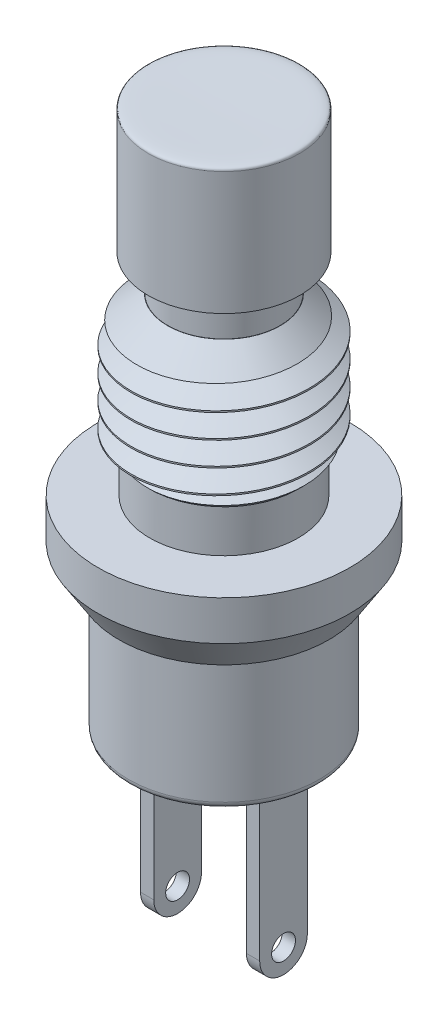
ISO-10303-21;
HEADER;
FILE_DESCRIPTION(('STEP AP214'),'2;1');
FILE_NAME('part.step','',(''),(''),'','','');
FILE_SCHEMA(('AUTOMOTIVE_DESIGN { 1 0 10303 214 1 1 1 1 }'));
ENDSEC;
DATA;
#1=APPLICATION_CONTEXT('core data for automotive mechanical design processes');
#2=APPLICATION_PROTOCOL_DEFINITION('international standard','automotive_design',2000,#1);
#3=PRODUCT_CONTEXT('',#1,'mechanical');
#4=PRODUCT('Part','Part','',(#3));
#5=PRODUCT_RELATED_PRODUCT_CATEGORY('part','',(#4));
#6=PRODUCT_DEFINITION_FORMATION('','',#4);
#7=PRODUCT_DEFINITION_CONTEXT('part definition',#1,'design');
#8=PRODUCT_DEFINITION('design','',#6,#7);
#9=PRODUCT_DEFINITION_SHAPE('','',#8);
#10=(LENGTH_UNIT() NAMED_UNIT(*) SI_UNIT(.MILLI.,.METRE.));
#11=(NAMED_UNIT(*) PLANE_ANGLE_UNIT() SI_UNIT($,.RADIAN.));
#12=(NAMED_UNIT(*) SI_UNIT($,.STERADIAN.) SOLID_ANGLE_UNIT());
#13=UNCERTAINTY_MEASURE_WITH_UNIT(LENGTH_MEASURE(1.E-05),#10,'distance_accuracy_value','');
#14=(GEOMETRIC_REPRESENTATION_CONTEXT(3) GLOBAL_UNCERTAINTY_ASSIGNED_CONTEXT((#13)) GLOBAL_UNIT_ASSIGNED_CONTEXT((#10,
#11,#12)) REPRESENTATION_CONTEXT('',''));
#15=CARTESIAN_POINT('',(0.,0.,0.));
#16=DIRECTION('',(0.,0.,1.));
#17=DIRECTION('',(1.,0.,0.));
#18=AXIS2_PLACEMENT_3D('',#15,#16,#17);
#19=CARTESIAN_POINT('',(0.,20.4548498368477,0.));
#20=DIRECTION('',(0.,1.,0.));
#21=DIRECTION('',(0.,0.,1.));
#22=AXIS2_PLACEMENT_3D('',#19,#20,#21);
#23=CYLINDRICAL_SURFACE('',#22,2.86);
#24=CARTESIAN_POINT('',(0.,20.3536305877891,0.));
#25=DIRECTION('',(0.,1.,0.));
#26=DIRECTION('',(0.,0.,1.));
#27=AXIS2_PLACEMENT_3D('',#24,#25,#26);
#28=CIRCLE('',#27,2.86);
#29=CARTESIAN_POINT('',(0.,20.3536305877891,2.86));
#30=VERTEX_POINT('',#29);
#31=EDGE_CURVE('E68',#30,#30,#28,.T.);
#32=ORIENTED_EDGE('',*,*,#31,.F.);
#33=EDGE_LOOP('',(#32));
#34=FACE_BOUND('',#33,.T.);
#35=CARTESIAN_POINT('',(0.,15.7080762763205,0.));
#36=DIRECTION('',(0.,1.,0.));
#37=DIRECTION('',(0.,0.,1.));
#38=AXIS2_PLACEMENT_3D('',#35,#36,#37);
#39=CIRCLE('',#38,2.86);
#40=CARTESIAN_POINT('',(0.,15.7080762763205,2.86));
#41=VERTEX_POINT('',#40);
#42=EDGE_CURVE('E13',#41,#41,#39,.T.);
#43=ORIENTED_EDGE('',*,*,#42,.T.);
#44=EDGE_LOOP('',(#43));
#45=FACE_BOUND('',#44,.T.);
#46=ADVANCED_FACE('F52',(#34,#45),#23,.T.);
#47=CARTESIAN_POINT('',(2.3,15.7080762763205,0.));
#48=DIRECTION('',(0.,1.,0.));
#49=DIRECTION('',(0.,0.,1.));
#50=AXIS2_PLACEMENT_3D('',#47,#48,#49);
#51=PLANE('',#50);
#52=ORIENTED_EDGE('',*,*,#42,.F.);
#53=EDGE_LOOP('',(#52));
#54=FACE_BOUND('',#53,.T.);
#55=CARTESIAN_POINT('',(0.,15.7080762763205,0.));
#56=DIRECTION('',(0.,1.,0.));
#57=DIRECTION('',(0.,0.,1.));
#58=AXIS2_PLACEMENT_3D('',#55,#56,#57);
#59=CIRCLE('',#58,2.3);
#60=CARTESIAN_POINT('',(0.,15.7080762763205,2.3));
#61=VERTEX_POINT('',#60);
#62=EDGE_CURVE('E58',#61,#61,#59,.T.);
#63=ORIENTED_EDGE('',*,*,#62,.T.);
#64=EDGE_LOOP('',(#63));
#65=FACE_BOUND('',#64,.T.);
#66=ADVANCED_FACE('F81',(#54,#65),#51,.F.);
#67=CARTESIAN_POINT('',(0.,20.4548498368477,0.));
#68=DIRECTION('',(0.,1.,0.));
#69=DIRECTION('',(0.,0.,1.));
#70=AXIS2_PLACEMENT_3D('',#67,#68,#69);
#71=CYLINDRICAL_SURFACE('',#70,2.3);
#72=ORIENTED_EDGE('',*,*,#62,.F.);
#73=EDGE_LOOP('',(#72));
#74=FACE_BOUND('',#73,.T.);
#75=CARTESIAN_POINT('',(0.,18.0534141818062,0.));
#76=DIRECTION('',(0.,1.,0.));
#77=DIRECTION('',(0.,0.,1.));
#78=AXIS2_PLACEMENT_3D('',#75,#76,#77);
#79=CIRCLE('',#78,2.3);
#80=CARTESIAN_POINT('',(0.,18.0534141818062,2.3));
#81=VERTEX_POINT('',#80);
#82=EDGE_CURVE('E70',#81,#81,#79,.T.);
#83=ORIENTED_EDGE('',*,*,#82,.T.);
#84=EDGE_LOOP('',(#83));
#85=FACE_BOUND('',#84,.T.);
#86=ADVANCED_FACE('F83',(#74,#85),#71,.F.);
#87=CARTESIAN_POINT('',(0.,18.0534141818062,0.));
#88=DIRECTION('',(0.,1.,0.));
#89=DIRECTION('',(0.,0.,1.));
#90=AXIS2_PLACEMENT_3D('',#87,#88,#89);
#91=PLANE('',#90);
#92=ORIENTED_EDGE('',*,*,#82,.F.);
#93=EDGE_LOOP('',(#92));
#94=FACE_BOUND('',#93,.T.);
#95=ADVANCED_FACE('F64',(#94),#91,.F.);
#96=CARTESIAN_POINT('',(2.86,20.3536305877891,0.));
#97=CARTESIAN_POINT('',(2.86,20.4393916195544,0.));
#98=CARTESIAN_POINT('',(2.79726135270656,20.457179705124,0.));
#99=CARTESIAN_POINT('',(2.60958894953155,20.507033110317,0.));
#100=CARTESIAN_POINT('',(1.90668660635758,20.4831778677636,0.));
#101=CARTESIAN_POINT('',(0.709982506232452,20.4565609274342,0.));
#102=CARTESIAN_POINT('',(0.216497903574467,20.4548498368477,0.));
#103=CARTESIAN_POINT('',(0.,20.4548498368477,0.));
#104=B_SPLINE_CURVE_WITH_KNOTS('',3,(#96,#97,#98,#99,#100,#101,#102,#103),.UNSPECIFIED.,.F.,.F.,
(4,1,1,1,1,4),(0.,0.0492704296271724,0.056204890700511,0.439452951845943,0.786743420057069,1.),.UNSPECIFIED.);
#105=CARTESIAN_POINT('',(0.,20.4548498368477,0.));
#106=DIRECTION('',(0.,1.,0.));
#107=AXIS1_PLACEMENT('',#105,#106);
#108=SURFACE_OF_REVOLUTION('',#104,#107);
#109=CARTESIAN_POINT('',(0.,20.4548498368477,0.));
#110=VERTEX_POINT('',#109);
#111=VERTEX_LOOP('',#110);
#112=FACE_BOUND('',#111,.T.);
#113=ORIENTED_EDGE('',*,*,#31,.T.);
#114=EDGE_LOOP('',(#113));
#115=FACE_BOUND('',#114,.T.);
#116=ADVANCED_FACE('F61',(#112,#115),#108,.T.);
#117=CLOSED_SHELL('',(#46,#66,#86,#95,#116));
#118=MANIFOLD_SOLID_BREP('B2',#117);
#119=CARTESIAN_POINT('',(0.,5.5,0.));
#120=DIRECTION('',(0.,-1.,0.));
#121=DIRECTION('',(0.,0.,-1.));
#122=AXIS2_PLACEMENT_3D('',#119,#120,#121);
#123=CYLINDRICAL_SURFACE('',#122,3.37);
#124=CARTESIAN_POINT('',(0.,9.91499999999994,0.));
#125=DIRECTION('',(0.,1.,0.));
#126=DIRECTION('',(0.,0.,1.));
#127=AXIS2_PLACEMENT_3D('',#124,#125,#126);
#128=CIRCLE('',#127,3.37);
#129=CARTESIAN_POINT('',(-1.89510918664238,9.91499999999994,2.78665770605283));
#130=VERTEX_POINT('',#129);
#131=CARTESIAN_POINT('',(-2.83690836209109,9.91499999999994,1.81902472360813));
#132=VERTEX_POINT('',#131);
#133=EDGE_CURVE('E303',#130,#132,#128,.F.);
#134=ORIENTED_EDGE('',*,*,#133,.F.);
#135=CARTESIAN_POINT('',(-3.37,8.86785143,0.));
#136=CARTESIAN_POINT('',(-3.37,8.924548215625,1.39589970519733));
#137=CARTESIAN_POINT('',(-2.38294985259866,8.98124500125,2.38294985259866));
#138=CARTESIAN_POINT('',(-1.39589970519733,9.037941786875,3.37));
#139=CARTESIAN_POINT('',(0.,9.0946385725,3.37));
#140=CARTESIAN_POINT('',(1.39589970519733,9.151335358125,3.37));
#141=CARTESIAN_POINT('',(2.38294985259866,9.20803214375,2.38294985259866));
#142=CARTESIAN_POINT('',(3.37,9.264728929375,1.39589970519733));
#143=CARTESIAN_POINT('',(3.37,9.321425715,0.));
#144=CARTESIAN_POINT('',(3.37,9.378122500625,-1.39589970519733));
#145=CARTESIAN_POINT('',(2.38294985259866,9.43481928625,-2.38294985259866));
#146=CARTESIAN_POINT('',(1.39589970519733,9.491516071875,-3.37));
#147=CARTESIAN_POINT('',(0.,9.5482128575,-3.37));
#148=CARTESIAN_POINT('',(-1.39589970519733,9.604909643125,-3.37));
#149=CARTESIAN_POINT('',(-2.38294985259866,9.66160642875,-2.38294985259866));
#150=CARTESIAN_POINT('',(-3.37,9.718303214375,-1.39589970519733));
#151=CARTESIAN_POINT('',(-3.37,9.775,0.));
#152=CARTESIAN_POINT('',(-3.37,9.831696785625,1.39589970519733));
#153=CARTESIAN_POINT('',(-2.38294985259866,9.88839357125,2.38294985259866));
#154=CARTESIAN_POINT('',(-1.39589970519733,9.945090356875,3.37));
#155=CARTESIAN_POINT('',(0.,10.0017871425,3.37));
#156=CARTESIAN_POINT('',(1.39589970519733,10.058483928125,3.37));
#157=CARTESIAN_POINT('',(2.38294985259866,10.11518071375,2.38294985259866));
#158=CARTESIAN_POINT('',(3.37,10.171877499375,1.39589970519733));
#159=CARTESIAN_POINT('',(3.37,10.228574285,0.));
#160=CARTESIAN_POINT('',(3.37,10.285271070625,-1.39589970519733));
#161=CARTESIAN_POINT('',(2.38294985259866,10.34196785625,-2.38294985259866));
#162=CARTESIAN_POINT('',(1.39589970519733,10.398664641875,-3.37));
#163=CARTESIAN_POINT('',(0.,10.4553614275,-3.37));
#164=CARTESIAN_POINT('',(-1.39589970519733,10.512058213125,-3.37));
#165=CARTESIAN_POINT('',(-2.38294985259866,10.56875499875,-2.38294985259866));
#166=CARTESIAN_POINT('',(-3.37,10.625451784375,-1.39589970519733));
#167=CARTESIAN_POINT('',(-3.37,10.68214857,0.));
#168=CARTESIAN_POINT('',(-3.37,10.738845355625,1.39589970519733));
#169=CARTESIAN_POINT('',(-2.38294985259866,10.79554214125,2.38294985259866));
#170=CARTESIAN_POINT('',(-1.39589970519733,10.852238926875,3.37));
#171=CARTESIAN_POINT('',(0.,10.9089357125,3.37));
#172=CARTESIAN_POINT('',(1.39589970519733,10.965632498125,3.37));
#173=CARTESIAN_POINT('',(2.38294985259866,11.02232928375,2.38294985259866));
#174=CARTESIAN_POINT('',(3.37,11.079026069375,1.39589970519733));
#175=CARTESIAN_POINT('',(3.37,11.135722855,0.));
#176=CARTESIAN_POINT('',(3.37,11.192419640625,-1.39589970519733));
#177=CARTESIAN_POINT('',(2.38294985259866,11.24911642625,-2.38294985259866));
#178=CARTESIAN_POINT('',(1.39589970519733,11.305813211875,-3.37));
#179=CARTESIAN_POINT('',(0.,11.3625099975,-3.37));
#180=CARTESIAN_POINT('',(-1.39589970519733,11.419206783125,-3.37));
#181=CARTESIAN_POINT('',(-2.38294985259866,11.47590356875,-2.38294985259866));
#182=CARTESIAN_POINT('',(-3.37,11.532600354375,-1.39589970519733));
#183=CARTESIAN_POINT('',(-3.37,11.58929714,0.));
#184=CARTESIAN_POINT('',(-3.37,11.645993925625,1.39589970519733));
#185=CARTESIAN_POINT('',(-2.38294985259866,11.70269071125,2.38294985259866));
#186=CARTESIAN_POINT('',(-1.39589970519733,11.759387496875,3.37));
#187=CARTESIAN_POINT('',(0.,11.8160842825,3.37));
#188=CARTESIAN_POINT('',(1.39589970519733,11.872781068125,3.37));
#189=CARTESIAN_POINT('',(2.38294985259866,11.92947785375,2.38294985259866));
#190=CARTESIAN_POINT('',(3.37,11.986174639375,1.39589970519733));
#191=CARTESIAN_POINT('',(3.37,12.042871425,0.));
#192=CARTESIAN_POINT('',(3.37,12.099568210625,-1.39589970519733));
#193=CARTESIAN_POINT('',(2.38294985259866,12.15626499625,-2.38294985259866));
#194=CARTESIAN_POINT('',(1.39589970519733,12.212961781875,-3.37));
#195=CARTESIAN_POINT('',(0.,12.2696585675,-3.37));
#196=CARTESIAN_POINT('',(-1.39589970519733,12.326355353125,-3.37));
#197=CARTESIAN_POINT('',(-2.38294985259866,12.38305213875,-2.38294985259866));
#198=CARTESIAN_POINT('',(-3.37,12.439748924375,-1.39589970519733));
#199=CARTESIAN_POINT('',(-3.37,12.49644571,0.));
#200=CARTESIAN_POINT('',(-3.37,12.553142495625,1.39589970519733));
#201=CARTESIAN_POINT('',(-2.38294985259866,12.60983928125,2.38294985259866));
#202=CARTESIAN_POINT('',(-1.39589970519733,12.666536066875,3.37));
#203=CARTESIAN_POINT('',(0.,12.7232328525,3.37));
#204=CARTESIAN_POINT('',(1.39589970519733,12.779929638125,3.37));
#205=CARTESIAN_POINT('',(2.38294985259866,12.83662642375,2.38294985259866));
#206=CARTESIAN_POINT('',(3.37,12.893323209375,1.39589970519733));
#207=CARTESIAN_POINT('',(3.37,12.950019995,0.));
#208=CARTESIAN_POINT('',(3.37,13.006716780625,-1.39589970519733));
#209=CARTESIAN_POINT('',(2.38294985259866,13.06341356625,-2.38294985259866));
#210=CARTESIAN_POINT('',(1.39589970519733,13.120110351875,-3.37));
#211=CARTESIAN_POINT('',(0.,13.1768071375,-3.37));
#212=CARTESIAN_POINT('',(-1.39589970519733,13.233503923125,-3.37));
#213=CARTESIAN_POINT('',(-2.38294985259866,13.29020070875,-2.38294985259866));
#214=CARTESIAN_POINT('',(-3.37,13.346897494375,-1.39589970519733));
#215=CARTESIAN_POINT('',(-3.37,13.40359428,0.));
#216=CARTESIAN_POINT('',(-3.37,13.460291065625,1.39589970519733));
#217=CARTESIAN_POINT('',(-2.38294985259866,13.51698785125,2.38294985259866));
#218=CARTESIAN_POINT('',(-1.39589970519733,13.573684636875,3.37));
#219=CARTESIAN_POINT('',(0.,13.6303814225,3.37));
#220=CARTESIAN_POINT('',(1.39589970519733,13.687078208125,3.37));
#221=CARTESIAN_POINT('',(2.38294985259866,13.74377499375,2.38294985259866));
#222=CARTESIAN_POINT('',(3.37,13.800471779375,1.39589970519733));
#223=CARTESIAN_POINT('',(3.37,13.857168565,0.));
#224=CARTESIAN_POINT('',(3.37,13.913865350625,-1.39589970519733));
#225=CARTESIAN_POINT('',(2.38294985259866,13.97056213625,-2.38294985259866));
#226=CARTESIAN_POINT('',(1.39589970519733,14.027258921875,-3.37));
#227=CARTESIAN_POINT('',(0.,14.0839557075,-3.37));
#228=CARTESIAN_POINT('',(-1.39589970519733,14.140652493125,-3.37));
#229=CARTESIAN_POINT('',(-2.38294985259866,14.19734927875,-2.38294985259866));
#230=CARTESIAN_POINT('',(-3.37,14.254046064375,-1.39589970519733));
#231=CARTESIAN_POINT('',(-3.37,14.31074285,0.));
#232=(BOUNDED_CURVE() B_SPLINE_CURVE(2,(#135,#136,#137,#138,#139,#140,#141,#142,#143,#144,#145,
#146,#147,#148,#149,#150,#151,#152,#153,#154,#155,#156,#157,#158,#159,#160,#161,#162,#163,#164,
#165,#166,#167,#168,#169,#170,#171,#172,#173,#174,#175,#176,#177,#178,#179,#180,#181,#182,#183,
#184,#185,#186,#187,#188,#189,#190,#191,#192,#193,#194,#195,#196,#197,#198,#199,#200,#201,#202,
#203,#204,#205,#206,#207,#208,#209,#210,#211,#212,#213,#214,#215,#216,#217,#218,#219,#220,#221,
#222,#223,#224,#225,#226,#227,#228,#229,#230,#231),.UNSPECIFIED.,.F.,
.F.) B_SPLINE_CURVE_WITH_KNOTS((3,2,2,2,2,2,2,2,2,2,2,2,2,2,2,2,2,2,2,2,2,2,2,2,2,2,2,2,2,2,2,2,
2,2,2,2,2,2,2,2,2,2,2,2,2,2,2,2,3),(0.,0.0208333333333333,0.0416666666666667,0.0625,
0.0833333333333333,0.104166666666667,0.125,0.145833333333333,0.166666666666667,0.1875,
0.208333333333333,0.229166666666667,0.25,0.270833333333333,0.291666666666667,0.3125,
0.333333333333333,0.354166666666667,0.375,0.395833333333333,0.416666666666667,0.4375,
0.458333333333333,0.479166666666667,0.5,0.520833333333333,0.541666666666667,0.5625,
0.583333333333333,0.604166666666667,0.625,0.645833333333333,0.666666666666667,0.6875,
0.708333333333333,0.729166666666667,0.75,0.770833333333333,0.791666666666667,0.8125,
0.833333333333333,0.854166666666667,0.875,0.895833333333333,0.916666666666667,0.9375,
0.958333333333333,0.979166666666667,1.),
.UNSPECIFIED.) CURVE() GEOMETRIC_REPRESENTATION_ITEM() RATIONAL_B_SPLINE_CURVE((1.,
0.923879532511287,1.,0.923879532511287,1.,0.923879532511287,1.,0.923879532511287,1.,
0.923879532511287,1.,0.923879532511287,1.,0.923879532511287,1.,0.923879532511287,1.,
0.923879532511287,1.,0.923879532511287,1.,0.923879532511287,1.,0.923879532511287,1.,
0.923879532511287,1.,0.923879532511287,1.,0.923879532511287,1.,0.923879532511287,1.,
0.923879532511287,1.,0.923879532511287,1.,0.923879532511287,1.,0.923879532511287,1.,
0.923879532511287,1.,0.923879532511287,1.,0.923879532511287,1.,0.923879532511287,1.,
0.923879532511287,1.,0.923879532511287,1.,0.923879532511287,1.,0.923879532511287,1.,
0.923879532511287,1.,0.923879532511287,1.,0.923879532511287,1.,0.923879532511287,1.,
0.923879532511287,1.,0.923879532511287,1.,0.923879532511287,1.,0.923879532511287,1.,
0.923879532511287,1.,0.923879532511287,1.,0.923879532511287,1.,0.923879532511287,1.,
0.923879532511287,1.,0.923879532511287,1.,0.923879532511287,1.,0.923879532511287,1.,
0.923879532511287,1.,0.923879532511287,1.,0.923879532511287,1.,0.923879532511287,1.)) REPRESENTATION_ITEM(''));
#233=CARTESIAN_POINT('',(-1.50368208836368,13.2438385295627,-3.01593106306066));
#234=VERTEX_POINT('',#233);
#235=EDGE_CURVE('E302',#130,#234,#232,.T.);
#236=ORIENTED_EDGE('',*,*,#235,.T.);
#237=CARTESIAN_POINT('',(0.,13.2438385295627,0.));
#238=DIRECTION('',(0.,-1.,0.));
#239=DIRECTION('',(0.,0.,-1.));
#240=AXIS2_PLACEMENT_3D('',#237,#238,#239);
#241=CIRCLE('',#240,3.37);
#242=CARTESIAN_POINT('',(-0.239781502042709,13.2438385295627,-3.36145873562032));
#243=VERTEX_POINT('',#242);
#244=EDGE_CURVE('E801',#234,#243,#241,.T.);
#245=ORIENTED_EDGE('',*,*,#244,.T.);
#246=CARTESIAN_POINT('',(-3.37,8.01785143,0.));
#247=CARTESIAN_POINT('',(-3.37,8.074548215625,1.39589970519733));
#248=CARTESIAN_POINT('',(-2.38294985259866,8.13124500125,2.38294985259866));
#249=CARTESIAN_POINT('',(-1.39589970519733,8.187941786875,3.37));
#250=CARTESIAN_POINT('',(0.,8.2446385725,3.37));
#251=CARTESIAN_POINT('',(1.39589970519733,8.301335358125,3.37));
#252=CARTESIAN_POINT('',(2.38294985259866,8.35803214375,2.38294985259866));
#253=CARTESIAN_POINT('',(3.37,8.414728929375,1.39589970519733));
#254=CARTESIAN_POINT('',(3.37,8.471425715,0.));
#255=CARTESIAN_POINT('',(3.37,8.528122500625,-1.39589970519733));
#256=CARTESIAN_POINT('',(2.38294985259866,8.58481928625,-2.38294985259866));
#257=CARTESIAN_POINT('',(1.39589970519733,8.641516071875,-3.37));
#258=CARTESIAN_POINT('',(0.,8.6982128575,-3.37));
#259=CARTESIAN_POINT('',(-1.39589970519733,8.754909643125,-3.37));
#260=CARTESIAN_POINT('',(-2.38294985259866,8.81160642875,-2.38294985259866));
#261=CARTESIAN_POINT('',(-3.37,8.868303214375,-1.39589970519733));
#262=CARTESIAN_POINT('',(-3.37,8.925,0.));
#263=CARTESIAN_POINT('',(-3.37,8.981696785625,1.39589970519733));
#264=CARTESIAN_POINT('',(-2.38294985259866,9.03839357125,2.38294985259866));
#265=CARTESIAN_POINT('',(-1.39589970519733,9.095090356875,3.37));
#266=CARTESIAN_POINT('',(0.,9.1517871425,3.37));
#267=CARTESIAN_POINT('',(1.39589970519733,9.208483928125,3.37));
#268=CARTESIAN_POINT('',(2.38294985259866,9.26518071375,2.38294985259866));
#269=CARTESIAN_POINT('',(3.37,9.321877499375,1.39589970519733));
#270=CARTESIAN_POINT('',(3.37,9.378574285,0.));
#271=CARTESIAN_POINT('',(3.37,9.435271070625,-1.39589970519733));
#272=CARTESIAN_POINT('',(2.38294985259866,9.49196785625,-2.38294985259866));
#273=CARTESIAN_POINT('',(1.39589970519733,9.548664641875,-3.37));
#274=CARTESIAN_POINT('',(0.,9.6053614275,-3.37));
#275=CARTESIAN_POINT('',(-1.39589970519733,9.662058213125,-3.37));
#276=CARTESIAN_POINT('',(-2.38294985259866,9.71875499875,-2.38294985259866));
#277=CARTESIAN_POINT('',(-3.37,9.775451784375,-1.39589970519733));
#278=CARTESIAN_POINT('',(-3.37,9.83214857,0.));
#279=CARTESIAN_POINT('',(-3.37,9.888845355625,1.39589970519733));
#280=CARTESIAN_POINT('',(-2.38294985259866,9.94554214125,2.38294985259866));
#281=CARTESIAN_POINT('',(-1.39589970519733,10.002238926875,3.37));
#282=CARTESIAN_POINT('',(0.,10.0589357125,3.37));
#283=CARTESIAN_POINT('',(1.39589970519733,10.115632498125,3.37));
#284=CARTESIAN_POINT('',(2.38294985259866,10.17232928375,2.38294985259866));
#285=CARTESIAN_POINT('',(3.37,10.229026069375,1.39589970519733));
#286=CARTESIAN_POINT('',(3.37,10.285722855,0.));
#287=CARTESIAN_POINT('',(3.37,10.342419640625,-1.39589970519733));
#288=CARTESIAN_POINT('',(2.38294985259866,10.39911642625,-2.38294985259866));
#289=CARTESIAN_POINT('',(1.39589970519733,10.455813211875,-3.37));
#290=CARTESIAN_POINT('',(0.,10.5125099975,-3.37));
#291=CARTESIAN_POINT('',(-1.39589970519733,10.569206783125,-3.37));
#292=CARTESIAN_POINT('',(-2.38294985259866,10.62590356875,-2.38294985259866));
#293=CARTESIAN_POINT('',(-3.37,10.682600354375,-1.39589970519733));
#294=CARTESIAN_POINT('',(-3.37,10.73929714,0.));
#295=CARTESIAN_POINT('',(-3.37,10.795993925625,1.39589970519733));
#296=CARTESIAN_POINT('',(-2.38294985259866,10.85269071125,2.38294985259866));
#297=CARTESIAN_POINT('',(-1.39589970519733,10.909387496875,3.37));
#298=CARTESIAN_POINT('',(0.,10.9660842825,3.37));
#299=CARTESIAN_POINT('',(1.39589970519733,11.022781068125,3.37));
#300=CARTESIAN_POINT('',(2.38294985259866,11.07947785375,2.38294985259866));
#301=CARTESIAN_POINT('',(3.37,11.136174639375,1.39589970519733));
#302=CARTESIAN_POINT('',(3.37,11.192871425,0.));
#303=CARTESIAN_POINT('',(3.37,11.249568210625,-1.39589970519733));
#304=CARTESIAN_POINT('',(2.38294985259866,11.30626499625,-2.38294985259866));
#305=CARTESIAN_POINT('',(1.39589970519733,11.362961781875,-3.37));
#306=CARTESIAN_POINT('',(0.,11.4196585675,-3.37));
#307=CARTESIAN_POINT('',(-1.39589970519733,11.476355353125,-3.37));
#308=CARTESIAN_POINT('',(-2.38294985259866,11.53305213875,-2.38294985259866));
#309=CARTESIAN_POINT('',(-3.37,11.589748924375,-1.39589970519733));
#310=CARTESIAN_POINT('',(-3.37,11.64644571,0.));
#311=CARTESIAN_POINT('',(-3.37,11.703142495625,1.39589970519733));
#312=CARTESIAN_POINT('',(-2.38294985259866,11.75983928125,2.38294985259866));
#313=CARTESIAN_POINT('',(-1.39589970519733,11.816536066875,3.37));
#314=CARTESIAN_POINT('',(0.,11.8732328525,3.37));
#315=CARTESIAN_POINT('',(1.39589970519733,11.929929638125,3.37));
#316=CARTESIAN_POINT('',(2.38294985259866,11.98662642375,2.38294985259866));
#317=CARTESIAN_POINT('',(3.37,12.043323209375,1.39589970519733));
#318=CARTESIAN_POINT('',(3.37,12.100019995,0.));
#319=CARTESIAN_POINT('',(3.37,12.156716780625,-1.39589970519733));
#320=CARTESIAN_POINT('',(2.38294985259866,12.21341356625,-2.38294985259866));
#321=CARTESIAN_POINT('',(1.39589970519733,12.270110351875,-3.37));
#322=CARTESIAN_POINT('',(0.,12.3268071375,-3.37));
#323=CARTESIAN_POINT('',(-1.39589970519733,12.383503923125,-3.37));
#324=CARTESIAN_POINT('',(-2.38294985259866,12.44020070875,-2.38294985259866));
#325=CARTESIAN_POINT('',(-3.37,12.496897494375,-1.39589970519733));
#326=CARTESIAN_POINT('',(-3.37,12.55359428,0.));
#327=CARTESIAN_POINT('',(-3.37,12.610291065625,1.39589970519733));
#328=CARTESIAN_POINT('',(-2.38294985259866,12.66698785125,2.38294985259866));
#329=CARTESIAN_POINT('',(-1.39589970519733,12.723684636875,3.37));
#330=CARTESIAN_POINT('',(0.,12.7803814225,3.37));
#331=CARTESIAN_POINT('',(1.39589970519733,12.837078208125,3.37));
#332=CARTESIAN_POINT('',(2.38294985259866,12.89377499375,2.38294985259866));
#333=CARTESIAN_POINT('',(3.37,12.950471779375,1.39589970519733));
#334=CARTESIAN_POINT('',(3.37,13.007168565,0.));
#335=CARTESIAN_POINT('',(3.37,13.063865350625,-1.39589970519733));
#336=CARTESIAN_POINT('',(2.38294985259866,13.12056213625,-2.38294985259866));
#337=CARTESIAN_POINT('',(1.39589970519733,13.177258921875,-3.37));
#338=CARTESIAN_POINT('',(0.,13.2339557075,-3.37));
#339=CARTESIAN_POINT('',(-1.39589970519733,13.290652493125,-3.37));
#340=CARTESIAN_POINT('',(-2.38294985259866,13.34734927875,-2.38294985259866));
#341=CARTESIAN_POINT('',(-3.37,13.404046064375,-1.39589970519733));
#342=CARTESIAN_POINT('',(-3.37,13.46074285,0.));
#343=(BOUNDED_CURVE() B_SPLINE_CURVE(2,(#246,#247,#248,#249,#250,#251,#252,#253,#254,#255,#256,
#257,#258,#259,#260,#261,#262,#263,#264,#265,#266,#267,#268,#269,#270,#271,#272,#273,#274,#275,
#276,#277,#278,#279,#280,#281,#282,#283,#284,#285,#286,#287,#288,#289,#290,#291,#292,#293,#294,
#295,#296,#297,#298,#299,#300,#301,#302,#303,#304,#305,#306,#307,#308,#309,#310,#311,#312,#313,
#314,#315,#316,#317,#318,#319,#320,#321,#322,#323,#324,#325,#326,#327,#328,#329,#330,#331,#332,
#333,#334,#335,#336,#337,#338,#339,#340,#341,#342),.UNSPECIFIED.,.F.,
.F.) B_SPLINE_CURVE_WITH_KNOTS((3,2,2,2,2,2,2,2,2,2,2,2,2,2,2,2,2,2,2,2,2,2,2,2,2,2,2,2,2,2,2,2,
2,2,2,2,2,2,2,2,2,2,2,2,2,2,2,2,3),(0.,0.0208333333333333,0.0416666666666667,0.0625,
0.0833333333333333,0.104166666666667,0.125,0.145833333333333,0.166666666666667,0.1875,
0.208333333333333,0.229166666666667,0.25,0.270833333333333,0.291666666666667,0.3125,
0.333333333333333,0.354166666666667,0.375,0.395833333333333,0.416666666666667,0.4375,
0.458333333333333,0.479166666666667,0.5,0.520833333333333,0.541666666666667,0.5625,
0.583333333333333,0.604166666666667,0.625,0.645833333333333,0.666666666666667,0.6875,
0.708333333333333,0.729166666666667,0.75,0.770833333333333,0.791666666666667,0.8125,
0.833333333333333,0.854166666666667,0.875,0.895833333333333,0.916666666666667,0.9375,
0.958333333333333,0.979166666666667,1.),
.UNSPECIFIED.) CURVE() GEOMETRIC_REPRESENTATION_ITEM() RATIONAL_B_SPLINE_CURVE((1.,
0.923879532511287,1.,0.923879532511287,1.,0.923879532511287,1.,0.923879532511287,1.,
0.923879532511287,1.,0.923879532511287,1.,0.923879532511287,1.,0.923879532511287,1.,
0.923879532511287,1.,0.923879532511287,1.,0.923879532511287,1.,0.923879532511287,1.,
0.923879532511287,1.,0.923879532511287,1.,0.923879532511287,1.,0.923879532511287,1.,
0.923879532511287,1.,0.923879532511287,1.,0.923879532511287,1.,0.923879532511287,1.,
0.923879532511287,1.,0.923879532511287,1.,0.923879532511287,1.,0.923879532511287,1.,
0.923879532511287,1.,0.923879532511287,1.,0.923879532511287,1.,0.923879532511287,1.,
0.923879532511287,1.,0.923879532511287,1.,0.923879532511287,1.,0.923879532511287,1.,
0.923879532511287,1.,0.923879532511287,1.,0.923879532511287,1.,0.923879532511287,1.,
0.923879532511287,1.,0.923879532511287,1.,0.923879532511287,1.,0.923879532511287,1.,
0.923879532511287,1.,0.923879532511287,1.,0.923879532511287,1.,0.923879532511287,1.,
0.923879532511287,1.,0.923879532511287,1.,0.923879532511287,1.,0.923879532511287,1.)) REPRESENTATION_ITEM(''));
#344=EDGE_CURVE('E310',#132,#243,#343,.T.);
#345=ORIENTED_EDGE('',*,*,#344,.F.);
#346=EDGE_LOOP('',(#134,#236,#245,#345));
#347=FACE_BOUND('',#346,.T.);
#348=ADVANCED_FACE('F132',(#347),#123,.T.);
#349=CARTESIAN_POINT('',(-3.37,13.88574285,0.));
#350=DIRECTION('',(0.,0.,-1.));
#351=DIRECTION('',(-1.,0.,0.));
#352=AXIS2_PLACEMENT_3D('',#349,#350,#351);
#353=PLANE('',#352);
#354=DIRECTION('',(-0.86602540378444,-0.499999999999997,0.));
#355=VECTOR('',#354,1.);
#356=CARTESIAN_POINT('',(-3.00193920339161,13.67324285,0.));
#357=LINE('',#356,#355);
#358=CARTESIAN_POINT('',(-2.63387840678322,13.88574285,0.));
#359=VERTEX_POINT('',#358);
#360=CARTESIAN_POINT('',(-2.67141573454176,13.8640706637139,0.));
#361=VERTEX_POINT('',#360);
#362=EDGE_CURVE('E809',#359,#361,#357,.T.);
#363=ORIENTED_EDGE('',*,*,#362,.T.);
#364=DIRECTION('',(0.747798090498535,0.663926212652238,0.));
#365=VECTOR('',#364,1.);
#366=CARTESIAN_POINT('',(0.,16.2358645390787,0.));
#367=LINE('',#366,#365);
#368=CARTESIAN_POINT('',(-2.64183300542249,13.8903354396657,0.));
#369=VERTEX_POINT('',#368);
#370=EDGE_CURVE('E152',#361,#369,#367,.T.);
#371=ORIENTED_EDGE('',*,*,#370,.T.);
#372=DIRECTION('',(0.866025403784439,-0.5,0.));
#373=VECTOR('',#372,1.);
#374=CARTESIAN_POINT('',(-3.00193920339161,14.09824285,0.));
#375=LINE('',#374,#373);
#376=EDGE_CURVE('E829',#369,#359,#375,.T.);
#377=ORIENTED_EDGE('',*,*,#376,.T.);
#378=EDGE_LOOP('',(#363,#371,#377));
#379=FACE_BOUND('',#378,.T.);
#380=ADVANCED_FACE('F510',(#379),#353,.T.);
#381=CARTESIAN_POINT('',(-2.63387840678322,8.44285143,0.));
#382=CARTESIAN_POINT('',(-2.63387840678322,8.499548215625,1.09098815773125));
#383=CARTESIAN_POINT('',(-1.86243328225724,8.55624500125,1.86243328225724));
#384=CARTESIAN_POINT('',(-1.09098815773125,8.612941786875,2.63387840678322));
#385=CARTESIAN_POINT('',(0.,8.6696385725,2.63387840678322));
#386=CARTESIAN_POINT('',(1.09098815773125,8.726335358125,2.63387840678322));
#387=CARTESIAN_POINT('',(1.86243328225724,8.78303214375,1.86243328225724));
#388=CARTESIAN_POINT('',(2.63387840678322,8.839728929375,1.09098815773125));
#389=CARTESIAN_POINT('',(2.63387840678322,8.896425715,0.));
#390=CARTESIAN_POINT('',(2.63387840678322,8.953122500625,-1.09098815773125));
#391=CARTESIAN_POINT('',(1.86243328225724,9.00981928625,-1.86243328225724));
#392=CARTESIAN_POINT('',(1.09098815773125,9.066516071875,-2.63387840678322));
#393=CARTESIAN_POINT('',(0.,9.1232128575,-2.63387840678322));
#394=CARTESIAN_POINT('',(-1.09098815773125,9.179909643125,-2.63387840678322));
#395=CARTESIAN_POINT('',(-1.86243328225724,9.23660642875,-1.86243328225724));
#396=CARTESIAN_POINT('',(-2.63387840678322,9.293303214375,-1.09098815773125));
#397=CARTESIAN_POINT('',(-2.63387840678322,9.35,0.));
#398=CARTESIAN_POINT('',(-2.63387840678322,9.406696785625,1.09098815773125));
#399=CARTESIAN_POINT('',(-1.86243328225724,9.46339357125,1.86243328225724));
#400=CARTESIAN_POINT('',(-1.09098815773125,9.520090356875,2.63387840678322));
#401=CARTESIAN_POINT('',(0.,9.5767871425,2.63387840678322));
#402=CARTESIAN_POINT('',(1.09098815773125,9.633483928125,2.63387840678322));
#403=CARTESIAN_POINT('',(1.86243328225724,9.69018071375,1.86243328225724));
#404=CARTESIAN_POINT('',(2.63387840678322,9.746877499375,1.09098815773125));
#405=CARTESIAN_POINT('',(2.63387840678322,9.803574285,0.));
#406=CARTESIAN_POINT('',(2.63387840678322,9.860271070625,-1.09098815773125));
#407=CARTESIAN_POINT('',(1.86243328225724,9.91696785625,-1.86243328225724));
#408=CARTESIAN_POINT('',(1.09098815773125,9.973664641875,-2.63387840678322));
#409=CARTESIAN_POINT('',(0.,10.0303614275,-2.63387840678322));
#410=CARTESIAN_POINT('',(-1.09098815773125,10.087058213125,-2.63387840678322));
#411=CARTESIAN_POINT('',(-1.86243328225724,10.14375499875,-1.86243328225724));
#412=CARTESIAN_POINT('',(-2.63387840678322,10.200451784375,-1.09098815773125));
#413=CARTESIAN_POINT('',(-2.63387840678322,10.25714857,0.));
#414=CARTESIAN_POINT('',(-2.63387840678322,10.313845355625,1.09098815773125));
#415=CARTESIAN_POINT('',(-1.86243328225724,10.37054214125,1.86243328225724));
#416=CARTESIAN_POINT('',(-1.09098815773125,10.427238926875,2.63387840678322));
#417=CARTESIAN_POINT('',(0.,10.4839357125,2.63387840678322));
#418=CARTESIAN_POINT('',(1.09098815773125,10.540632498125,2.63387840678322));
#419=CARTESIAN_POINT('',(1.86243328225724,10.59732928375,1.86243328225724));
#420=CARTESIAN_POINT('',(2.63387840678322,10.654026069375,1.09098815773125));
#421=CARTESIAN_POINT('',(2.63387840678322,10.710722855,0.));
#422=CARTESIAN_POINT('',(2.63387840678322,10.767419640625,-1.09098815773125));
#423=CARTESIAN_POINT('',(1.86243328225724,10.82411642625,-1.86243328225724));
#424=CARTESIAN_POINT('',(1.09098815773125,10.880813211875,-2.63387840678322));
#425=CARTESIAN_POINT('',(0.,10.9375099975,-2.63387840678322));
#426=CARTESIAN_POINT('',(-1.09098815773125,10.994206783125,-2.63387840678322));
#427=CARTESIAN_POINT('',(-1.86243328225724,11.05090356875,-1.86243328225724));
#428=CARTESIAN_POINT('',(-2.63387840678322,11.107600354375,-1.09098815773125));
#429=CARTESIAN_POINT('',(-2.63387840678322,11.16429714,0.));
#430=CARTESIAN_POINT('',(-2.63387840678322,11.220993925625,1.09098815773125));
#431=CARTESIAN_POINT('',(-1.86243328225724,11.27769071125,1.86243328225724));
#432=CARTESIAN_POINT('',(-1.09098815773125,11.334387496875,2.63387840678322));
#433=CARTESIAN_POINT('',(0.,11.3910842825,2.63387840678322));
#434=CARTESIAN_POINT('',(1.09098815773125,11.447781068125,2.63387840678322));
#435=CARTESIAN_POINT('',(1.86243328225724,11.50447785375,1.86243328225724));
#436=CARTESIAN_POINT('',(2.63387840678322,11.561174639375,1.09098815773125));
#437=CARTESIAN_POINT('',(2.63387840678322,11.617871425,0.));
#438=CARTESIAN_POINT('',(2.63387840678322,11.674568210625,-1.09098815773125));
#439=CARTESIAN_POINT('',(1.86243328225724,11.73126499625,-1.86243328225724));
#440=CARTESIAN_POINT('',(1.09098815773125,11.787961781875,-2.63387840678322));
#441=CARTESIAN_POINT('',(0.,11.8446585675,-2.63387840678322));
#442=CARTESIAN_POINT('',(-1.09098815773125,11.901355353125,-2.63387840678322));
#443=CARTESIAN_POINT('',(-1.86243328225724,11.95805213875,-1.86243328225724));
#444=CARTESIAN_POINT('',(-2.63387840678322,12.014748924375,-1.09098815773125));
#445=CARTESIAN_POINT('',(-2.63387840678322,12.07144571,0.));
#446=CARTESIAN_POINT('',(-2.63387840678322,12.128142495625,1.09098815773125));
#447=CARTESIAN_POINT('',(-1.86243328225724,12.18483928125,1.86243328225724));
#448=CARTESIAN_POINT('',(-1.09098815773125,12.241536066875,2.63387840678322));
#449=CARTESIAN_POINT('',(0.,12.2982328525,2.63387840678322));
#450=CARTESIAN_POINT('',(1.09098815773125,12.354929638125,2.63387840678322));
#451=CARTESIAN_POINT('',(1.86243328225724,12.41162642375,1.86243328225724));
#452=CARTESIAN_POINT('',(2.63387840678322,12.468323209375,1.09098815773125));
#453=CARTESIAN_POINT('',(2.63387840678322,12.525019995,0.));
#454=CARTESIAN_POINT('',(2.63387840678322,12.581716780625,-1.09098815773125));
#455=CARTESIAN_POINT('',(1.86243328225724,12.63841356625,-1.86243328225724));
#456=CARTESIAN_POINT('',(1.09098815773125,12.695110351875,-2.63387840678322));
#457=CARTESIAN_POINT('',(0.,12.7518071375,-2.63387840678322));
#458=CARTESIAN_POINT('',(-1.09098815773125,12.808503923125,-2.63387840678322));
#459=CARTESIAN_POINT('',(-1.86243328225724,12.86520070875,-1.86243328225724));
#460=CARTESIAN_POINT('',(-2.63387840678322,12.921897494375,-1.09098815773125));
#461=CARTESIAN_POINT('',(-2.63387840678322,12.97859428,0.));
#462=CARTESIAN_POINT('',(-2.63387840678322,13.035291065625,1.09098815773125));
#463=CARTESIAN_POINT('',(-1.86243328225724,13.09198785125,1.86243328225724));
#464=CARTESIAN_POINT('',(-1.09098815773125,13.148684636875,2.63387840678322));
#465=CARTESIAN_POINT('',(0.,13.2053814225,2.63387840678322));
#466=CARTESIAN_POINT('',(1.09098815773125,13.262078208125,2.63387840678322));
#467=CARTESIAN_POINT('',(1.86243328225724,13.31877499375,1.86243328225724));
#468=CARTESIAN_POINT('',(2.63387840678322,13.375471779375,1.09098815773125));
#469=CARTESIAN_POINT('',(2.63387840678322,13.432168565,0.));
#470=CARTESIAN_POINT('',(2.63387840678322,13.488865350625,-1.09098815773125));
#471=CARTESIAN_POINT('',(1.86243328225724,13.54556213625,-1.86243328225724));
#472=CARTESIAN_POINT('',(1.09098815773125,13.602258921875,-2.63387840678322));
#473=CARTESIAN_POINT('',(0.,13.6589557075,-2.63387840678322));
#474=CARTESIAN_POINT('',(-1.09098815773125,13.715652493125,-2.63387840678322));
#475=CARTESIAN_POINT('',(-1.86243328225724,13.77234927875,-1.86243328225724));
#476=CARTESIAN_POINT('',(-2.63387840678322,13.829046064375,-1.09098815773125));
#477=CARTESIAN_POINT('',(-2.63387840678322,13.88574285,0.));
#478=CARTESIAN_POINT('',(-3.37,8.86785143,0.));
#479=CARTESIAN_POINT('',(-3.37,8.924548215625,1.39589970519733));
#480=CARTESIAN_POINT('',(-2.38294985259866,8.98124500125,2.38294985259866));
#481=CARTESIAN_POINT('',(-1.39589970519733,9.037941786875,3.37));
#482=CARTESIAN_POINT('',(0.,9.0946385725,3.37));
#483=CARTESIAN_POINT('',(1.39589970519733,9.151335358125,3.37));
#484=CARTESIAN_POINT('',(2.38294985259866,9.20803214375,2.38294985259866));
#485=CARTESIAN_POINT('',(3.37,9.264728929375,1.39589970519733));
#486=CARTESIAN_POINT('',(3.37,9.321425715,0.));
#487=CARTESIAN_POINT('',(3.37,9.378122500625,-1.39589970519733));
#488=CARTESIAN_POINT('',(2.38294985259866,9.43481928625,-2.38294985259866));
#489=CARTESIAN_POINT('',(1.39589970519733,9.491516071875,-3.37));
#490=CARTESIAN_POINT('',(0.,9.5482128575,-3.37));
#491=CARTESIAN_POINT('',(-1.39589970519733,9.604909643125,-3.37));
#492=CARTESIAN_POINT('',(-2.38294985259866,9.66160642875,-2.38294985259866));
#493=CARTESIAN_POINT('',(-3.37,9.718303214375,-1.39589970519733));
#494=CARTESIAN_POINT('',(-3.37,9.775,0.));
#495=CARTESIAN_POINT('',(-3.37,9.831696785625,1.39589970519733));
#496=CARTESIAN_POINT('',(-2.38294985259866,9.88839357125,2.38294985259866));
#497=CARTESIAN_POINT('',(-1.39589970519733,9.945090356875,3.37));
#498=CARTESIAN_POINT('',(0.,10.0017871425,3.37));
#499=CARTESIAN_POINT('',(1.39589970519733,10.058483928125,3.37));
#500=CARTESIAN_POINT('',(2.38294985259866,10.11518071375,2.38294985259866));
#501=CARTESIAN_POINT('',(3.37,10.171877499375,1.39589970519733));
#502=CARTESIAN_POINT('',(3.37,10.228574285,0.));
#503=CARTESIAN_POINT('',(3.37,10.285271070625,-1.39589970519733));
#504=CARTESIAN_POINT('',(2.38294985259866,10.34196785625,-2.38294985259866));
#505=CARTESIAN_POINT('',(1.39589970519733,10.398664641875,-3.37));
#506=CARTESIAN_POINT('',(0.,10.4553614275,-3.37));
#507=CARTESIAN_POINT('',(-1.39589970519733,10.512058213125,-3.37));
#508=CARTESIAN_POINT('',(-2.38294985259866,10.56875499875,-2.38294985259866));
#509=CARTESIAN_POINT('',(-3.37,10.625451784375,-1.39589970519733));
#510=CARTESIAN_POINT('',(-3.37,10.68214857,0.));
#511=CARTESIAN_POINT('',(-3.37,10.738845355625,1.39589970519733));
#512=CARTESIAN_POINT('',(-2.38294985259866,10.79554214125,2.38294985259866));
#513=CARTESIAN_POINT('',(-1.39589970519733,10.852238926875,3.37));
#514=CARTESIAN_POINT('',(0.,10.9089357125,3.37));
#515=CARTESIAN_POINT('',(1.39589970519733,10.965632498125,3.37));
#516=CARTESIAN_POINT('',(2.38294985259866,11.02232928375,2.38294985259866));
#517=CARTESIAN_POINT('',(3.37,11.079026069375,1.39589970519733));
#518=CARTESIAN_POINT('',(3.37,11.135722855,0.));
#519=CARTESIAN_POINT('',(3.37,11.192419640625,-1.39589970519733));
#520=CARTESIAN_POINT('',(2.38294985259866,11.24911642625,-2.38294985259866));
#521=CARTESIAN_POINT('',(1.39589970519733,11.305813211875,-3.37));
#522=CARTESIAN_POINT('',(0.,11.3625099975,-3.37));
#523=CARTESIAN_POINT('',(-1.39589970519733,11.419206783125,-3.37));
#524=CARTESIAN_POINT('',(-2.38294985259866,11.47590356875,-2.38294985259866));
#525=CARTESIAN_POINT('',(-3.37,11.532600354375,-1.39589970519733));
#526=CARTESIAN_POINT('',(-3.37,11.58929714,0.));
#527=CARTESIAN_POINT('',(-3.37,11.645993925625,1.39589970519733));
#528=CARTESIAN_POINT('',(-2.38294985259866,11.70269071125,2.38294985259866));
#529=CARTESIAN_POINT('',(-1.39589970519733,11.759387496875,3.37));
#530=CARTESIAN_POINT('',(0.,11.8160842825,3.37));
#531=CARTESIAN_POINT('',(1.39589970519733,11.872781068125,3.37));
#532=CARTESIAN_POINT('',(2.38294985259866,11.92947785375,2.38294985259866));
#533=CARTESIAN_POINT('',(3.37,11.986174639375,1.39589970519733));
#534=CARTESIAN_POINT('',(3.37,12.042871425,0.));
#535=CARTESIAN_POINT('',(3.37,12.099568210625,-1.39589970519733));
#536=CARTESIAN_POINT('',(2.38294985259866,12.15626499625,-2.38294985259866));
#537=CARTESIAN_POINT('',(1.39589970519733,12.212961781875,-3.37));
#538=CARTESIAN_POINT('',(0.,12.2696585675,-3.37));
#539=CARTESIAN_POINT('',(-1.39589970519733,12.326355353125,-3.37));
#540=CARTESIAN_POINT('',(-2.38294985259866,12.38305213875,-2.38294985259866));
#541=CARTESIAN_POINT('',(-3.37,12.439748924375,-1.39589970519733));
#542=CARTESIAN_POINT('',(-3.37,12.49644571,0.));
#543=CARTESIAN_POINT('',(-3.37,12.553142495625,1.39589970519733));
#544=CARTESIAN_POINT('',(-2.38294985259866,12.60983928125,2.38294985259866));
#545=CARTESIAN_POINT('',(-1.39589970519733,12.666536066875,3.37));
#546=CARTESIAN_POINT('',(0.,12.7232328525,3.37));
#547=CARTESIAN_POINT('',(1.39589970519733,12.779929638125,3.37));
#548=CARTESIAN_POINT('',(2.38294985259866,12.83662642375,2.38294985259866));
#549=CARTESIAN_POINT('',(3.37,12.893323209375,1.39589970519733));
#550=CARTESIAN_POINT('',(3.37,12.950019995,0.));
#551=CARTESIAN_POINT('',(3.37,13.006716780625,-1.39589970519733));
#552=CARTESIAN_POINT('',(2.38294985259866,13.06341356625,-2.38294985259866));
#553=CARTESIAN_POINT('',(1.39589970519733,13.120110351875,-3.37));
#554=CARTESIAN_POINT('',(0.,13.1768071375,-3.37));
#555=CARTESIAN_POINT('',(-1.39589970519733,13.233503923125,-3.37));
#556=CARTESIAN_POINT('',(-2.38294985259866,13.29020070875,-2.38294985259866));
#557=CARTESIAN_POINT('',(-3.37,13.346897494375,-1.39589970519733));
#558=CARTESIAN_POINT('',(-3.37,13.40359428,0.));
#559=CARTESIAN_POINT('',(-3.37,13.460291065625,1.39589970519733));
#560=CARTESIAN_POINT('',(-2.38294985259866,13.51698785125,2.38294985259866));
#561=CARTESIAN_POINT('',(-1.39589970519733,13.573684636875,3.37));
#562=CARTESIAN_POINT('',(0.,13.6303814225,3.37));
#563=CARTESIAN_POINT('',(1.39589970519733,13.687078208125,3.37));
#564=CARTESIAN_POINT('',(2.38294985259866,13.74377499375,2.38294985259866));
#565=CARTESIAN_POINT('',(3.37,13.800471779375,1.39589970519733));
#566=CARTESIAN_POINT('',(3.37,13.857168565,0.));
#567=CARTESIAN_POINT('',(3.37,13.913865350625,-1.39589970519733));
#568=CARTESIAN_POINT('',(2.38294985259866,13.97056213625,-2.38294985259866));
#569=CARTESIAN_POINT('',(1.39589970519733,14.027258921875,-3.37));
#570=CARTESIAN_POINT('',(0.,14.0839557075,-3.37));
#571=CARTESIAN_POINT('',(-1.39589970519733,14.140652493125,-3.37));
#572=CARTESIAN_POINT('',(-2.38294985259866,14.19734927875,-2.38294985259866));
#573=CARTESIAN_POINT('',(-3.37,14.254046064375,-1.39589970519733));
#574=CARTESIAN_POINT('',(-3.37,14.31074285,0.));
#575=(BOUNDED_SURFACE() B_SPLINE_SURFACE(1,2,((#381,#382,#383,#384,#385,#386,#387,#388,#389,
#390,#391,#392,#393,#394,#395,#396,#397,#398,#399,#400,#401,#402,#403,#404,#405,#406,#407,#408,
#409,#410,#411,#412,#413,#414,#415,#416,#417,#418,#419,#420,#421,#422,#423,#424,#425,#426,#427,
#428,#429,#430,#431,#432,#433,#434,#435,#436,#437,#438,#439,#440,#441,#442,#443,#444,#445,#446,
#447,#448,#449,#450,#451,#452,#453,#454,#455,#456,#457,#458,#459,#460,#461,#462,#463,#464,#465,
#466,#467,#468,#469,#470,#471,#472,#473,#474,#475,#476,#477),(#478,#479,#480,#481,#482,#483,
#484,#485,#486,#487,#488,#489,#490,#491,#492,#493,#494,#495,#496,#497,#498,#499,#500,#501,#502,
#503,#504,#505,#506,#507,#508,#509,#510,#511,#512,#513,#514,#515,#516,#517,#518,#519,#520,#521,
#522,#523,#524,#525,#526,#527,#528,#529,#530,#531,#532,#533,#534,#535,#536,#537,#538,#539,#540,
#541,#542,#543,#544,#545,#546,#547,#548,#549,#550,#551,#552,#553,#554,#555,#556,#557,#558,#559,
#560,#561,#562,#563,#564,#565,#566,#567,#568,#569,#570,#571,#572,#573,#574)),.UNSPECIFIED.,.F.,
.F.,.F.) B_SPLINE_SURFACE_WITH_KNOTS((2,2),(3,2,2,2,2,2,2,2,2,2,2,2,2,2,2,2,2,2,2,2,2,2,2,2,2,2,
2,2,2,2,2,2,2,2,2,2,2,2,2,2,2,2,2,2,2,2,2,2,3),(0.,1.),(0.,0.0208333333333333,
0.0416666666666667,0.0625,0.0833333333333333,0.104166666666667,0.125,0.145833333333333,
0.166666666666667,0.1875,0.208333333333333,0.229166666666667,0.25,0.270833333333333,
0.291666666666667,0.3125,0.333333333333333,0.354166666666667,0.375,0.395833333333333,
0.416666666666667,0.4375,0.458333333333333,0.479166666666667,0.5,0.520833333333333,
0.541666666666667,0.5625,0.583333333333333,0.604166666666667,0.625,0.645833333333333,
0.666666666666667,0.6875,0.708333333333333,0.729166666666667,0.75,0.770833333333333,
0.791666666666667,0.8125,0.833333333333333,0.854166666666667,0.875,0.895833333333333,
0.916666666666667,0.9375,0.958333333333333,0.979166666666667,1.),
.UNSPECIFIED.) GEOMETRIC_REPRESENTATION_ITEM() RATIONAL_B_SPLINE_SURFACE(((1.,0.923879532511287,
1.,0.923879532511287,1.,0.923879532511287,1.,0.923879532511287,1.,0.923879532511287,1.,
0.923879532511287,1.,0.923879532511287,1.,0.923879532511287,1.,0.923879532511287,1.,
0.923879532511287,1.,0.923879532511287,1.,0.923879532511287,1.,0.923879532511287,1.,
0.923879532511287,1.,0.923879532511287,1.,0.923879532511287,1.,0.923879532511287,1.,
0.923879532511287,1.,0.923879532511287,1.,0.923879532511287,1.,0.923879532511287,1.,
0.923879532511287,1.,0.923879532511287,1.,0.923879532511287,1.,0.923879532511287,1.,
0.923879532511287,1.,0.923879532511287,1.,0.923879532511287,1.,0.923879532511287,1.,
0.923879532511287,1.,0.923879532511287,1.,0.923879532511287,1.,0.923879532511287,1.,
0.923879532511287,1.,0.923879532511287,1.,0.923879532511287,1.,0.923879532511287,1.,
0.923879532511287,1.,0.923879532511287,1.,0.923879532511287,1.,0.923879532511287,1.,
0.923879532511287,1.,0.923879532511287,1.,0.923879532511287,1.,0.923879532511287,1.,
0.923879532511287,1.,0.923879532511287,1.,0.923879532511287,1.),(1.,0.923879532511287,1.,
0.923879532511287,1.,0.923879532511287,1.,0.923879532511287,1.,0.923879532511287,1.,
0.923879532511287,1.,0.923879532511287,1.,0.923879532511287,1.,0.923879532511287,1.,
0.923879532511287,1.,0.923879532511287,1.,0.923879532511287,1.,0.923879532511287,1.,
0.923879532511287,1.,0.923879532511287,1.,0.923879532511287,1.,0.923879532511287,1.,
0.923879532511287,1.,0.923879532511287,1.,0.923879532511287,1.,0.923879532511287,1.,
0.923879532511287,1.,0.923879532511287,1.,0.923879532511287,1.,0.923879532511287,1.,
0.923879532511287,1.,0.923879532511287,1.,0.923879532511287,1.,0.923879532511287,1.,
0.923879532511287,1.,0.923879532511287,1.,0.923879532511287,1.,0.923879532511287,1.,
0.923879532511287,1.,0.923879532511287,1.,0.923879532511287,1.,0.923879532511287,1.,
0.923879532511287,1.,0.923879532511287,1.,0.923879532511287,1.,0.923879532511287,1.,
0.923879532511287,1.,0.923879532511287,1.,0.923879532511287,1.,0.923879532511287,1.,
0.923879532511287,1.,0.923879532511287,1.,0.923879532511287,1.))) REPRESENTATION_ITEM('') SURFACE());
#576=CARTESIAN_POINT('',(-1.89510918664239,9.91499999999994,2.78665770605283));
#577=CARTESIAN_POINT('',(-1.9312567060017,9.91021668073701,2.75629104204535));
#578=CARTESIAN_POINT('',(-1.96677585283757,9.90544330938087,2.72517508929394));
#579=CARTESIAN_POINT('',(-2.03649956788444,9.89592601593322,2.66149959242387));
#580=CARTESIAN_POINT('',(-2.07070414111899,9.89118209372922,2.62894005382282));
#581=CARTESIAN_POINT('',(-2.13776336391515,9.88173008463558,2.56241010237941));
#582=CARTESIAN_POINT('',(-2.17061710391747,9.87702202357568,2.52843876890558));
#583=CARTESIAN_POINT('',(-2.23489273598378,9.86765061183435,2.45916094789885));
#584=CARTESIAN_POINT('',(-2.26631459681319,9.86298726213,2.42385443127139));
#585=CARTESIAN_POINT('',(-2.32764835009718,9.85373264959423,2.35201420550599));
#586=CARTESIAN_POINT('',(-2.35756196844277,9.84914130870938,2.31548198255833));
#587=CARTESIAN_POINT('',(-2.41570282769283,9.83984550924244,2.24111435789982));
#588=CARTESIAN_POINT('',(-2.44393014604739,9.83514105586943,2.20327901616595));
#589=CARTESIAN_POINT('',(-2.49865505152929,9.82565071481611,2.12640412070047));
#590=CARTESIAN_POINT('',(-2.52515315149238,9.82086485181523,2.08736492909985));
#591=CARTESIAN_POINT('',(-2.5763705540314,9.81121169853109,2.00814742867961));
#592=CARTESIAN_POINT('',(-2.60108976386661,9.80634440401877,1.96796906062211));
#593=CARTESIAN_POINT('',(-2.67211302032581,9.79171473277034,1.8465149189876));
#594=CARTESIAN_POINT('',(-2.71574656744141,9.78184413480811,1.76366780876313));
#595=CARTESIAN_POINT('',(-2.79548014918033,9.76188003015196,1.59444709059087));
#596=CARTESIAN_POINT('',(-2.83157884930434,9.75178648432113,1.5080728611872));
#597=CARTESIAN_POINT('',(-2.89595913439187,9.73144548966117,1.33247703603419));
#598=CARTESIAN_POINT('',(-2.92424106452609,9.72119804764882,1.24325556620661));
#599=CARTESIAN_POINT('',(-2.97276622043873,9.7006230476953,1.06266365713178));
#600=CARTESIAN_POINT('',(-2.99300962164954,9.69029549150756,0.971293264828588));
#601=CARTESIAN_POINT('',(-3.02456233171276,9.67010827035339,0.791321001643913));
#602=CARTESIAN_POINT('',(-3.03623709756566,9.66024875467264,0.702783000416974));
#603=CARTESIAN_POINT('',(-3.05204566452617,9.64060298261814,0.525016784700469));
#604=CARTESIAN_POINT('',(-3.05617841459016,9.63081673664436,0.43578847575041));
#605=CARTESIAN_POINT('',(-3.05684669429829,9.61137560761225,0.257316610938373));
#606=CARTESIAN_POINT('',(-3.05338535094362,9.60172067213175,0.168073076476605));
#607=CARTESIAN_POINT('',(-3.04258414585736,9.58745813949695,0.0346684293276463));
#608=CARTESIAN_POINT('',(-3.03804870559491,9.58274049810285,-0.00972405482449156));
#609=CARTESIAN_POINT('',(-3.02693197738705,9.57320113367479,-0.0982444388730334));
#610=CARTESIAN_POINT('',(-3.02035075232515,9.56837941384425,-0.142372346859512));
#611=CARTESIAN_POINT('',(-3.00524563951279,9.55869728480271,-0.229761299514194));
#612=CARTESIAN_POINT('',(-2.99674493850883,9.55383795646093,-0.273026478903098));
#613=CARTESIAN_POINT('',(-2.97777888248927,9.54403448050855,-0.359109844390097));
#614=CARTESIAN_POINT('',(-2.96731358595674,9.5390903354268,-0.401928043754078));
#615=CARTESIAN_POINT('',(-2.93299668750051,9.52414045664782,-0.529596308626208));
#616=CARTESIAN_POINT('',(-2.90622287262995,9.51401650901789,-0.613667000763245));
#617=CARTESIAN_POINT('',(-2.84513209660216,9.49353319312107,-0.778924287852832));
#618=CARTESIAN_POINT('',(-2.81081962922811,9.48317396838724,-0.860112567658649));
#619=CARTESIAN_POINT('',(-2.73492999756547,9.46228593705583,-1.01900206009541));
#620=CARTESIAN_POINT('',(-2.69335125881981,9.45175709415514,-1.09670251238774));
#621=CARTESIAN_POINT('',(-2.58359966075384,9.42599389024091,-1.28096108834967));
#622=CARTESIAN_POINT('',(-2.51173018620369,9.41070684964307,-1.38535290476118));
#623=CARTESIAN_POINT('',(-2.39422115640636,9.38784460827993,-1.53408443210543));
#624=CARTESIAN_POINT('',(-2.35344046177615,9.38023631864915,-1.58234597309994));
#625=CARTESIAN_POINT('',(-2.26880220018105,9.36507198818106,-1.67608690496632));
#626=CARTESIAN_POINT('',(-2.22494508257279,9.35751593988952,-1.72156670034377));
#627=CARTESIAN_POINT('',(-2.17962373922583,9.34999999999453,-1.76557790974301));
#628=B_SPLINE_CURVE_WITH_KNOTS('',3,(#576,#577,#578,#579,#580,#581,#582,#583,#584,#585,#586,
#587,#588,#589,#590,#591,#592,#593,#594,#595,#596,#597,#598,#599,#600,#601,#602,#603,#604,#605,
#606,#607,#608,#609,#610,#611,#612,#613,#614,#615,#616,#617,#618,#619,#620,#621,#622,#623,#624,
#625,#626,#627),.UNSPECIFIED.,.F.,.F.,(4,2,2,2,2,2,2,2,2,2,2,2,2,2,2,2,2,2,2,2,2,2,2,2,2,4),(0.,
0.142344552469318,0.284688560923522,0.427126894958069,0.569568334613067,0.711842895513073,
0.854110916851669,0.996336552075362,1.13856959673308,1.42063085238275,1.70274202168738,
1.98484073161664,2.26693328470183,2.53615621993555,2.8054166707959,3.07456626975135,
3.20914743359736,3.34372446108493,3.47675541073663,3.60978240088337,3.87581514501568,
4.14168973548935,4.40762200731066,4.78934816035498,4.98015728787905,5.17093860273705),.UNSPECIFIED.);
#629=CARTESIAN_POINT('',(-2.17962373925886,9.35,-1.76557790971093));
#630=VERTEX_POINT('',#629);
#631=EDGE_CURVE('E284',#130,#630,#628,.T.);
#632=CARTESIAN_POINT('',(3.30166568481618,9.35,-0.675206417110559));
#633=CARTESIAN_POINT('',(3.28088412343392,9.35,-0.748476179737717));
#634=CARTESIAN_POINT('',(3.2575871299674,9.35,-0.82099974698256));
#635=CARTESIAN_POINT('',(3.20604913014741,9.35,-0.964286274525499));
#636=CARTESIAN_POINT('',(3.17780703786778,9.35,-1.03504884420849));
#637=CARTESIAN_POINT('',(3.08573883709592,9.35,-1.24440381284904));
#638=CARTESIAN_POINT('',(3.01461866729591,9.35,-1.37989485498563));
#639=CARTESIAN_POINT('',(2.88568994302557,9.35,-1.58903131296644));
#640=CARTESIAN_POINT('',(2.83348179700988,9.35,-1.66621476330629));
#641=CARTESIAN_POINT('',(2.72272860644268,9.35,-1.81594457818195));
#642=CARTESIAN_POINT('',(2.66418217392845,9.35,-1.88848992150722));
#643=CARTESIAN_POINT('',(2.54119208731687,9.35,-2.02837162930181));
#644=CARTESIAN_POINT('',(2.47674993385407,9.35,-2.09570931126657));
#645=CARTESIAN_POINT('',(2.3760335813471,9.35,-2.19245562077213));
#646=CARTESIAN_POINT('',(2.34178413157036,9.35,-2.22399582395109));
#647=CARTESIAN_POINT('',(2.27197711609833,9.35,-2.28559387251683));
#648=CARTESIAN_POINT('',(2.23641957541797,9.35,-2.31565174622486));
#649=CARTESIAN_POINT('',(2.12797566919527,9.35000000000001,-2.40320631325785));
#650=CARTESIAN_POINT('',(2.05311111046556,9.35,-2.45828423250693));
#651=CARTESIAN_POINT('',(1.89878364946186,9.35,-2.5615485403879));
#652=CARTESIAN_POINT('',(1.81932053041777,9.35,-2.60973460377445));
#653=CARTESIAN_POINT('',(1.65643365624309,9.35,-2.6988054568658));
#654=CARTESIAN_POINT('',(1.57301127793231,9.35,-2.73969276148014));
#655=CARTESIAN_POINT('',(1.40281945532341,9.35,-2.81387205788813));
#656=CARTESIAN_POINT('',(1.31604883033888,9.35,-2.84716134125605));
#657=CARTESIAN_POINT('',(1.14484009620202,9.35,-2.90420586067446));
#658=CARTESIAN_POINT('',(1.06054520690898,9.35,-2.92839196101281));
#659=CARTESIAN_POINT('',(0.890217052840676,9.35,-2.96957166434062));
#660=CARTESIAN_POINT('',(0.804183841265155,9.35,-2.98656548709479));
#661=CARTESIAN_POINT('',(0.63096407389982,9.35,-3.0132447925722));
#662=CARTESIAN_POINT('',(0.543777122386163,9.35,-3.02292769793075));
#663=CARTESIAN_POINT('',(0.368910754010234,9.35,-3.03490740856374));
#664=CARTESIAN_POINT('',(0.281231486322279,9.35,-3.03720634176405));
#665=CARTESIAN_POINT('',(0.149735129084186,9.35,-3.03510491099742));
#666=CARTESIAN_POINT('',(0.105857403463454,9.35,-3.03347449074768));
#667=CARTESIAN_POINT('',(0.0182184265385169,9.35,-3.02837070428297));
#668=CARTESIAN_POINT('',(-0.0255428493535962,9.35,-3.02489776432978));
#669=CARTESIAN_POINT('',(-0.156499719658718,9.35,-3.01151599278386));
#670=CARTESIAN_POINT('',(-0.243411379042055,9.35,-2.99864371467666));
#671=CARTESIAN_POINT('',(-0.41561969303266,9.35,-2.9651556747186));
#672=CARTESIAN_POINT('',(-0.500918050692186,9.35,-2.94454861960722));
#673=CARTESIAN_POINT('',(-0.669388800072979,9.35,-2.89572865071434));
#674=CARTESIAN_POINT('',(-0.752558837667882,9.35,-2.86750768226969));
#675=CARTESIAN_POINT('',(-0.98912834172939,9.35,-2.77511900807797));
#676=CARTESIAN_POINT('',(-1.13889861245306,9.35,-2.70135938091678));
#677=CARTESIAN_POINT('',(-1.42367237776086,9.35,-2.52939530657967));
#678=CARTESIAN_POINT('',(-1.55867629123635,9.35,-2.43119155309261));
#679=CARTESIAN_POINT('',(-1.74637090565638,9.35,-2.26849265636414));
#680=CARTESIAN_POINT('',(-1.80618354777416,9.35,-2.21203949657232));
#681=CARTESIAN_POINT('',(-1.89213773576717,9.35,-2.1237533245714));
#682=CARTESIAN_POINT('',(-1.92015114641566,9.35,-2.09373633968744));
#683=CARTESIAN_POINT('',(-1.97490285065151,9.35,-2.03256174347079));
#684=CARTESIAN_POINT('',(-2.00164112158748,9.35,-2.00140411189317));
#685=CARTESIAN_POINT('',(-2.07968496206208,9.35,-1.90619821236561));
#686=CARTESIAN_POINT('',(-2.12885847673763,9.35,-1.84037733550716));
#687=CARTESIAN_POINT('',(-2.22106199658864,9.35,-1.70456294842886));
#688=CARTESIAN_POINT('',(-2.26409096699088,9.35,-1.63456873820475));
#689=CARTESIAN_POINT('',(-2.34224065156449,9.35,-1.49353129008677));
#690=CARTESIAN_POINT('',(-2.37758799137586,9.35,-1.42261363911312));
#691=CARTESIAN_POINT('',(-2.44196793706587,9.35,-1.27796645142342));
#692=CARTESIAN_POINT('',(-2.47100041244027,9.35,-1.2042368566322));
#693=CARTESIAN_POINT('',(-2.52253023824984,9.35,-1.0545131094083));
#694=CARTESIAN_POINT('',(-2.54502657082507,9.35,-0.978518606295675));
#695=CARTESIAN_POINT('',(-2.58330299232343,9.35,-0.824883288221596));
#696=CARTESIAN_POINT('',(-2.59908458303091,9.35,-0.747242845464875));
#697=CARTESIAN_POINT('',(-2.6289277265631,9.35,-0.558486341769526));
#698=CARTESIAN_POINT('',(-2.63957452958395,9.35,-0.446813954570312));
#699=CARTESIAN_POINT('',(-2.64706857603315,9.35,-0.223210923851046));
#700=CARTESIAN_POINT('',(-2.64394073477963,9.35,-0.111281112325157));
#701=CARTESIAN_POINT('',(-2.63387840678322,9.35,0.));
#702=B_SPLINE_CURVE_WITH_KNOTS('',3,(#632,#633,#634,#635,#636,#637,#638,#639,#640,#641,#642,
#643,#644,#645,#646,#647,#648,#649,#650,#651,#652,#653,#654,#655,#656,#657,#658,#659,#660,#661,
#662,#663,#664,#665,#666,#667,#668,#669,#670,#671,#672,#673,#674,#675,#676,#677,#678,#679,#680,
#681,#682,#683,#684,#685,#686,#687,#688,#689,#690,#691,#692,#693,#694,#695,#696,#697,#698,#699,
#700,#701),.UNSPECIFIED.,.F.,.F.,(4,2,2,2,2,2,2,2,2,2,2,2,2,2,2,2,2,2,2,2,2,2,2,2,2,2,2,2,2,2,2,
2,2,2,4),(0.,0.228371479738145,0.456793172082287,0.914158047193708,1.19342686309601,
1.4727569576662,1.75201615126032,1.89165969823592,2.03130057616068,2.30972157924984,
2.58815571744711,2.86649373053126,3.14493080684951,3.40771043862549,3.6704820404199,
3.9333462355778,4.19613467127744,4.32782561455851,4.45948610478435,4.72267848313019,
4.98557548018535,5.24875169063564,5.74701216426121,6.24525849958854,6.49173512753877,
6.61487431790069,6.73801569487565,6.98413246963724,7.2302906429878,7.46770463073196,
7.70512352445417,7.94257937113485,8.17998208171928,8.51563342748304,8.85067790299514),.UNSPECIFIED.);
#703=CARTESIAN_POINT('',(-2.63387840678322,9.35,0.));
#704=VERTEX_POINT('',#703);
#705=EDGE_CURVE('E299',#630,#704,#702,.T.);
#706=CARTESIAN_POINT('',(-2.63387840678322,8.44285143,0.));
#707=CARTESIAN_POINT('',(-2.63387840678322,8.499548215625,1.09098815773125));
#708=CARTESIAN_POINT('',(-1.86243328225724,8.55624500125,1.86243328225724));
#709=CARTESIAN_POINT('',(-1.09098815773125,8.612941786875,2.63387840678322));
#710=CARTESIAN_POINT('',(0.,8.6696385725,2.63387840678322));
#711=CARTESIAN_POINT('',(1.09098815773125,8.726335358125,2.63387840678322));
#712=CARTESIAN_POINT('',(1.86243328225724,8.78303214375,1.86243328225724));
#713=CARTESIAN_POINT('',(2.63387840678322,8.839728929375,1.09098815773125));
#714=CARTESIAN_POINT('',(2.63387840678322,8.896425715,0.));
#715=CARTESIAN_POINT('',(2.63387840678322,8.953122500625,-1.09098815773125));
#716=CARTESIAN_POINT('',(1.86243328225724,9.00981928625,-1.86243328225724));
#717=CARTESIAN_POINT('',(1.09098815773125,9.066516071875,-2.63387840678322));
#718=CARTESIAN_POINT('',(0.,9.1232128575,-2.63387840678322));
#719=CARTESIAN_POINT('',(-1.09098815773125,9.179909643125,-2.63387840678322));
#720=CARTESIAN_POINT('',(-1.86243328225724,9.23660642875,-1.86243328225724));
#721=CARTESIAN_POINT('',(-2.63387840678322,9.293303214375,-1.09098815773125));
#722=CARTESIAN_POINT('',(-2.63387840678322,9.35,0.));
#723=CARTESIAN_POINT('',(-2.63387840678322,9.406696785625,1.09098815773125));
#724=CARTESIAN_POINT('',(-1.86243328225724,9.46339357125,1.86243328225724));
#725=CARTESIAN_POINT('',(-1.09098815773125,9.520090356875,2.63387840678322));
#726=CARTESIAN_POINT('',(0.,9.5767871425,2.63387840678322));
#727=CARTESIAN_POINT('',(1.09098815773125,9.633483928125,2.63387840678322));
#728=CARTESIAN_POINT('',(1.86243328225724,9.69018071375,1.86243328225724));
#729=CARTESIAN_POINT('',(2.63387840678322,9.746877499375,1.09098815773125));
#730=CARTESIAN_POINT('',(2.63387840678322,9.803574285,0.));
#731=CARTESIAN_POINT('',(2.63387840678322,9.860271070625,-1.09098815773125));
#732=CARTESIAN_POINT('',(1.86243328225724,9.91696785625,-1.86243328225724));
#733=CARTESIAN_POINT('',(1.09098815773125,9.973664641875,-2.63387840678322));
#734=CARTESIAN_POINT('',(0.,10.0303614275,-2.63387840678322));
#735=CARTESIAN_POINT('',(-1.09098815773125,10.087058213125,-2.63387840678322));
#736=CARTESIAN_POINT('',(-1.86243328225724,10.14375499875,-1.86243328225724));
#737=CARTESIAN_POINT('',(-2.63387840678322,10.200451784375,-1.09098815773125));
#738=CARTESIAN_POINT('',(-2.63387840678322,10.25714857,0.));
#739=CARTESIAN_POINT('',(-2.63387840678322,10.313845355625,1.09098815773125));
#740=CARTESIAN_POINT('',(-1.86243328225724,10.37054214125,1.86243328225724));
#741=CARTESIAN_POINT('',(-1.09098815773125,10.427238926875,2.63387840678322));
#742=CARTESIAN_POINT('',(0.,10.4839357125,2.63387840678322));
#743=CARTESIAN_POINT('',(1.09098815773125,10.540632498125,2.63387840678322));
#744=CARTESIAN_POINT('',(1.86243328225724,10.59732928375,1.86243328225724));
#745=CARTESIAN_POINT('',(2.63387840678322,10.654026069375,1.09098815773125));
#746=CARTESIAN_POINT('',(2.63387840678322,10.710722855,0.));
#747=CARTESIAN_POINT('',(2.63387840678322,10.767419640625,-1.09098815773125));
#748=CARTESIAN_POINT('',(1.86243328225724,10.82411642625,-1.86243328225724));
#749=CARTESIAN_POINT('',(1.09098815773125,10.880813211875,-2.63387840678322));
#750=CARTESIAN_POINT('',(0.,10.9375099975,-2.63387840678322));
#751=CARTESIAN_POINT('',(-1.09098815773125,10.994206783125,-2.63387840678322));
#752=CARTESIAN_POINT('',(-1.86243328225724,11.05090356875,-1.86243328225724));
#753=CARTESIAN_POINT('',(-2.63387840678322,11.107600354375,-1.09098815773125));
#754=CARTESIAN_POINT('',(-2.63387840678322,11.16429714,0.));
#755=CARTESIAN_POINT('',(-2.63387840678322,11.220993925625,1.09098815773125));
#756=CARTESIAN_POINT('',(-1.86243328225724,11.27769071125,1.86243328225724));
#757=CARTESIAN_POINT('',(-1.09098815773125,11.334387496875,2.63387840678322));
#758=CARTESIAN_POINT('',(0.,11.3910842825,2.63387840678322));
#759=CARTESIAN_POINT('',(1.09098815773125,11.447781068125,2.63387840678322));
#760=CARTESIAN_POINT('',(1.86243328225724,11.50447785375,1.86243328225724));
#761=CARTESIAN_POINT('',(2.63387840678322,11.561174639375,1.09098815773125));
#762=CARTESIAN_POINT('',(2.63387840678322,11.617871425,0.));
#763=CARTESIAN_POINT('',(2.63387840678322,11.674568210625,-1.09098815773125));
#764=CARTESIAN_POINT('',(1.86243328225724,11.73126499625,-1.86243328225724));
#765=CARTESIAN_POINT('',(1.09098815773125,11.787961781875,-2.63387840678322));
#766=CARTESIAN_POINT('',(0.,11.8446585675,-2.63387840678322));
#767=CARTESIAN_POINT('',(-1.09098815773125,11.901355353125,-2.63387840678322));
#768=CARTESIAN_POINT('',(-1.86243328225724,11.95805213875,-1.86243328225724));
#769=CARTESIAN_POINT('',(-2.63387840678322,12.014748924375,-1.09098815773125));
#770=CARTESIAN_POINT('',(-2.63387840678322,12.07144571,0.));
#771=CARTESIAN_POINT('',(-2.63387840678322,12.128142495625,1.09098815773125));
#772=CARTESIAN_POINT('',(-1.86243328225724,12.18483928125,1.86243328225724));
#773=CARTESIAN_POINT('',(-1.09098815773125,12.241536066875,2.63387840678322));
#774=CARTESIAN_POINT('',(0.,12.2982328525,2.63387840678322));
#775=CARTESIAN_POINT('',(1.09098815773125,12.354929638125,2.63387840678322));
#776=CARTESIAN_POINT('',(1.86243328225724,12.41162642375,1.86243328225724));
#777=CARTESIAN_POINT('',(2.63387840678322,12.468323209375,1.09098815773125));
#778=CARTESIAN_POINT('',(2.63387840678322,12.525019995,0.));
#779=CARTESIAN_POINT('',(2.63387840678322,12.581716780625,-1.09098815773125));
#780=CARTESIAN_POINT('',(1.86243328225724,12.63841356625,-1.86243328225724));
#781=CARTESIAN_POINT('',(1.09098815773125,12.695110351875,-2.63387840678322));
#782=CARTESIAN_POINT('',(0.,12.7518071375,-2.63387840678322));
#783=CARTESIAN_POINT('',(-1.09098815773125,12.808503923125,-2.63387840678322));
#784=CARTESIAN_POINT('',(-1.86243328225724,12.86520070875,-1.86243328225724));
#785=CARTESIAN_POINT('',(-2.63387840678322,12.921897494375,-1.09098815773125));
#786=CARTESIAN_POINT('',(-2.63387840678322,12.97859428,0.));
#787=CARTESIAN_POINT('',(-2.63387840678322,13.035291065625,1.09098815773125));
#788=CARTESIAN_POINT('',(-1.86243328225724,13.09198785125,1.86243328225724));
#789=CARTESIAN_POINT('',(-1.09098815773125,13.148684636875,2.63387840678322));
#790=CARTESIAN_POINT('',(0.,13.2053814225,2.63387840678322));
#791=CARTESIAN_POINT('',(1.09098815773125,13.262078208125,2.63387840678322));
#792=CARTESIAN_POINT('',(1.86243328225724,13.31877499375,1.86243328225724));
#793=CARTESIAN_POINT('',(2.63387840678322,13.375471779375,1.09098815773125));
#794=CARTESIAN_POINT('',(2.63387840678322,13.432168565,0.));
#795=CARTESIAN_POINT('',(2.63387840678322,13.488865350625,-1.09098815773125));
#796=CARTESIAN_POINT('',(1.86243328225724,13.54556213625,-1.86243328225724));
#797=CARTESIAN_POINT('',(1.09098815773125,13.602258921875,-2.63387840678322));
#798=CARTESIAN_POINT('',(0.,13.6589557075,-2.63387840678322));
#799=CARTESIAN_POINT('',(-1.09098815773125,13.715652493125,-2.63387840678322));
#800=CARTESIAN_POINT('',(-1.86243328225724,13.77234927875,-1.86243328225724));
#801=CARTESIAN_POINT('',(-2.63387840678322,13.829046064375,-1.09098815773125));
#802=CARTESIAN_POINT('',(-2.63387840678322,13.88574285,0.));
#803=(BOUNDED_CURVE() B_SPLINE_CURVE(2,(#706,#707,#708,#709,#710,#711,#712,#713,#714,#715,#716,
#717,#718,#719,#720,#721,#722,#723,#724,#725,#726,#727,#728,#729,#730,#731,#732,#733,#734,#735,
#736,#737,#738,#739,#740,#741,#742,#743,#744,#745,#746,#747,#748,#749,#750,#751,#752,#753,#754,
#755,#756,#757,#758,#759,#760,#761,#762,#763,#764,#765,#766,#767,#768,#769,#770,#771,#772,#773,
#774,#775,#776,#777,#778,#779,#780,#781,#782,#783,#784,#785,#786,#787,#788,#789,#790,#791,#792,
#793,#794,#795,#796,#797,#798,#799,#800,#801,#802),.UNSPECIFIED.,.F.,
.F.) B_SPLINE_CURVE_WITH_KNOTS((3,2,2,2,2,2,2,2,2,2,2,2,2,2,2,2,2,2,2,2,2,2,2,2,2,2,2,2,2,2,2,2,
2,2,2,2,2,2,2,2,2,2,2,2,2,2,2,2,3),(0.,0.0208333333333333,0.0416666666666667,0.0625,
0.0833333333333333,0.104166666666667,0.125,0.145833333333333,0.166666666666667,0.1875,
0.208333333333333,0.229166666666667,0.25,0.270833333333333,0.291666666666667,0.3125,
0.333333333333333,0.354166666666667,0.375,0.395833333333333,0.416666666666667,0.4375,
0.458333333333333,0.479166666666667,0.5,0.520833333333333,0.541666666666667,0.5625,
0.583333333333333,0.604166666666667,0.625,0.645833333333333,0.666666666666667,0.6875,
0.708333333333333,0.729166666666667,0.75,0.770833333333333,0.791666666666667,0.8125,
0.833333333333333,0.854166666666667,0.875,0.895833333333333,0.916666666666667,0.9375,
0.958333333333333,0.979166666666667,1.),
.UNSPECIFIED.) CURVE() GEOMETRIC_REPRESENTATION_ITEM() RATIONAL_B_SPLINE_CURVE((1.,
0.923879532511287,1.,0.923879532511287,1.,0.923879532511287,1.,0.923879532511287,1.,
0.923879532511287,1.,0.923879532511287,1.,0.923879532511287,1.,0.923879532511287,1.,
0.923879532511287,1.,0.923879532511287,1.,0.923879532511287,1.,0.923879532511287,1.,
0.923879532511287,1.,0.923879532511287,1.,0.923879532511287,1.,0.923879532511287,1.,
0.923879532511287,1.,0.923879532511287,1.,0.923879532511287,1.,0.923879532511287,1.,
0.923879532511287,1.,0.923879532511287,1.,0.923879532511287,1.,0.923879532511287,1.,
0.923879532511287,1.,0.923879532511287,1.,0.923879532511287,1.,0.923879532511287,1.,
0.923879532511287,1.,0.923879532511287,1.,0.923879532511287,1.,0.923879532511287,1.,
0.923879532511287,1.,0.923879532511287,1.,0.923879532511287,1.,0.923879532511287,1.,
0.923879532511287,1.,0.923879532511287,1.,0.923879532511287,1.,0.923879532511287,1.,
0.923879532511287,1.,0.923879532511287,1.,0.923879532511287,1.,0.923879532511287,1.,
0.923879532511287,1.,0.923879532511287,1.,0.923879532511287,1.,0.923879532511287,1.)) REPRESENTATION_ITEM(''));
#804=EDGE_CURVE('E810',#704,#359,#803,.T.);
#805=CARTESIAN_POINT('',(-1.50368208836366,13.2438385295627,-3.01593106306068));
#806=CARTESIAN_POINT('',(-1.58734800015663,13.246360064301,-2.97105348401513));
#807=CARTESIAN_POINT('',(-1.66910517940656,13.2488777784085,-2.92263329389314));
#808=CARTESIAN_POINT('',(-1.82826144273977,13.2538867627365,-2.81907759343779));
#809=CARTESIAN_POINT('',(-1.90566013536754,13.2563780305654,-2.76394148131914));
#810=CARTESIAN_POINT('',(-2.05553172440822,13.2613144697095,-2.64734125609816));
#811=CARTESIAN_POINT('',(-2.12800539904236,13.263759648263,-2.58587814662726));
#812=CARTESIAN_POINT('',(-2.23261888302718,13.2673826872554,-2.48928400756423));
#813=CARTESIAN_POINT('',(-2.2668099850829,13.2685830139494,-2.45634967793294));
#814=CARTESIAN_POINT('',(-2.33377920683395,13.2709596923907,-2.38907304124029));
#815=CARTESIAN_POINT('',(-2.36655732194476,13.27213604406,-2.35473072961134));
#816=CARTESIAN_POINT('',(-2.46262758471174,13.2756978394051,-2.24962116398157));
#817=CARTESIAN_POINT('',(-2.52366167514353,13.2781162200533,-2.17676573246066));
#818=CARTESIAN_POINT('',(-2.63921031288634,13.283021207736,-2.0260735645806));
#819=CARTESIAN_POINT('',(-2.69372479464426,13.2855078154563,-1.94823677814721));
#820=CARTESIAN_POINT('',(-2.79580253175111,13.2905305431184,-1.78820737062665));
#821=CARTESIAN_POINT('',(-2.84337072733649,13.2930666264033,-1.70601790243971));
#822=CARTESIAN_POINT('',(-2.93126191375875,13.298172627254,-1.53781479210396));
#823=CARTESIAN_POINT('',(-2.97158220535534,13.3007425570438,-1.45179974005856));
#824=CARTESIAN_POINT('',(-3.04382332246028,13.3058376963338,-1.27861095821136));
#825=CARTESIAN_POINT('',(-3.07591458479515,13.3083625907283,-1.19150827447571));
#826=CARTESIAN_POINT('',(-3.13264397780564,13.3134084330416,-1.01490916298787));
#827=CARTESIAN_POINT('',(-3.15728203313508,13.3159293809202,-0.925412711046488));
#828=CARTESIAN_POINT('',(-3.19893631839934,13.3209480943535,-0.744627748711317));
#829=CARTESIAN_POINT('',(-3.21595033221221,13.3234458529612,-0.653338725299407));
#830=CARTESIAN_POINT('',(-3.24222200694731,13.3284060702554,-0.469672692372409));
#831=CARTESIAN_POINT('',(-3.25147916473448,13.3308685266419,-0.377295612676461));
#832=CARTESIAN_POINT('',(-3.26753356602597,13.3381360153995,-0.0993908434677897));
#833=CARTESIAN_POINT('',(-3.26262828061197,13.3428229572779,0.0869738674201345));
#834=CARTESIAN_POINT('',(-3.22075301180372,13.3525456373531,0.455918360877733));
#835=CARTESIAN_POINT('',(-3.18379573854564,13.3575812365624,0.638499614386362));
#836=CARTESIAN_POINT('',(-3.07999967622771,13.3676942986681,0.991427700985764));
#837=CARTESIAN_POINT('',(-3.01370001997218,13.3727694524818,1.16193363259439));
#838=CARTESIAN_POINT('',(-2.853136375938,13.3829289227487,1.48941018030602));
#839=CARTESIAN_POINT('',(-2.75886399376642,13.3880132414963,1.64637671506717));
#840=CARTESIAN_POINT('',(-2.59905496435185,13.3955049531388,1.86758454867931));
#841=CARTESIAN_POINT('',(-2.54289139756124,13.3979733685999,1.93877695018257));
#842=CARTESIAN_POINT('',(-2.42473819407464,13.4028586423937,2.07620337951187));
#843=CARTESIAN_POINT('',(-2.36274854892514,13.4052755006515,2.14243740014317));
#844=CARTESIAN_POINT('',(-2.26577621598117,13.4088383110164,2.23766920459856));
#845=CARTESIAN_POINT('',(-2.23278853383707,13.4100154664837,2.26872571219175));
#846=CARTESIAN_POINT('',(-2.16550005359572,13.4123949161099,2.32938063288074));
#847=CARTESIAN_POINT('',(-2.13119934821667,13.4135972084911,2.35897914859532));
#848=CARTESIAN_POINT('',(-2.02644145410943,13.4172312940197,2.44550075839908));
#849=CARTESIAN_POINT('',(-1.95411295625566,13.4196908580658,2.50016517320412));
#850=CARTESIAN_POINT('',(-1.73197804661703,13.4271081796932,2.65340043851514));
#851=CARTESIAN_POINT('',(-1.57558283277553,13.4321565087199,2.74262265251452));
#852=CARTESIAN_POINT('',(-1.24982058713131,13.4423450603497,2.89310341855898));
#853=CARTESIAN_POINT('',(-1.08045050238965,13.4474853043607,2.95435536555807));
#854=CARTESIAN_POINT('',(-0.821843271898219,13.4551106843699,3.02358720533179));
#855=CARTESIAN_POINT('',(-0.735484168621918,13.457621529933,3.04283426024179));
#856=CARTESIAN_POINT('',(-0.561425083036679,13.4626106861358,3.07399104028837));
#857=CARTESIAN_POINT('',(-0.473725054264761,13.4650889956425,3.08590051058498));
#858=CARTESIAN_POINT('',(-0.297657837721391,13.4699968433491,3.10227809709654));
#859=CARTESIAN_POINT('',(-0.209290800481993,13.4724263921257,3.10674784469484));
#860=CARTESIAN_POINT('',(-0.032492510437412,13.4772060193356,3.10823801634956));
#861=CARTESIAN_POINT('',(0.0559387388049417,13.4795561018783,3.10525882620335));
#862=CARTESIAN_POINT('',(0.232013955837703,13.484350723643,3.09166413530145));
#863=CARTESIAN_POINT('',(0.319659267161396,13.4867950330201,3.08106622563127));
#864=CARTESIAN_POINT('',(0.493689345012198,13.4917409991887,3.05237239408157));
#865=CARTESIAN_POINT('',(0.580074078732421,13.4942426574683,3.0342762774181));
#866=CARTESIAN_POINT('',(0.836363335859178,13.5018159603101,2.96890363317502));
#867=CARTESIAN_POINT('',(1.00357256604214,13.5069605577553,2.91052952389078));
#868=CARTESIAN_POINT('',(1.32186536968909,13.5171678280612,2.76751182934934));
#869=CARTESIAN_POINT('',(1.47322457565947,13.5222297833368,2.68348036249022));
#870=CARTESIAN_POINT('',(1.68798094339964,13.5297296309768,2.53937767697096));
#871=CARTESIAN_POINT('',(1.75755387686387,13.5322153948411,2.48830144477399));
#872=CARTESIAN_POINT('',(1.89213875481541,13.5371472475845,2.38046854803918));
#873=CARTESIAN_POINT('',(1.9571520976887,13.5395933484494,2.32371363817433));
#874=CARTESIAN_POINT('',(2.08225558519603,13.544395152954,2.20487968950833));
#875=CARTESIAN_POINT('',(2.14234045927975,13.5467507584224,2.14279509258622));
#876=CARTESIAN_POINT('',(2.25690919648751,13.5515378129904,2.01368817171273));
#877=CARTESIAN_POINT('',(2.31139336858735,13.5539692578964,1.9466661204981));
#878=CARTESIAN_POINT('',(2.46577064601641,13.5613647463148,1.73895332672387));
#879=CARTESIAN_POINT('',(2.55673957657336,13.5664354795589,1.59147253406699));
#880=CARTESIAN_POINT('',(2.71018143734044,13.5765897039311,1.28636062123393));
#881=CARTESIAN_POINT('',(2.77322481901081,13.5816705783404,1.12901579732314));
#882=CARTESIAN_POINT('',(2.8472080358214,13.5892697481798,0.886852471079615));
#883=CARTESIAN_POINT('',(2.86844507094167,13.5918005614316,0.805058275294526));
#884=CARTESIAN_POINT('',(2.90392577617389,13.596838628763,0.639945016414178));
#885=CARTESIAN_POINT('',(2.91816920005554,13.5993458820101,0.556625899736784));
#886=CARTESIAN_POINT('',(2.93950555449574,13.6043055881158,0.389419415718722));
#887=CARTESIAN_POINT('',(2.94662770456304,13.6067582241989,0.305535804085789));
#888=CARTESIAN_POINT('',(2.95198365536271,13.6103951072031,0.179504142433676));
#889=CARTESIAN_POINT('',(2.95288092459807,13.6116005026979,0.137455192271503));
#890=CARTESIAN_POINT('',(2.95291024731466,13.6139857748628,0.0533560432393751));
#891=CARTESIAN_POINT('',(2.95204228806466,13.6151656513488,0.0113058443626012));
#892=CARTESIAN_POINT('',(2.94671277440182,13.6187313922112,-0.114699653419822));
#893=CARTESIAN_POINT('',(2.93952773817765,13.6211447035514,-0.198558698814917));
#894=CARTESIAN_POINT('',(2.91793465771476,13.6260455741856,-0.365304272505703));
#895=CARTESIAN_POINT('',(2.90352673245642,13.6285331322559,-0.448190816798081));
#896=CARTESIAN_POINT('',(2.85009515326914,13.6360065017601,-0.692273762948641));
#897=CARTESIAN_POINT('',(2.80075512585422,13.6410719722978,-0.851332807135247));
#898=CARTESIAN_POINT('',(2.67568198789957,13.6512728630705,-1.1587589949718));
#899=CARTESIAN_POINT('',(2.5999410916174,13.6564083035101,-1.30712296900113));
#900=CARTESIAN_POINT('',(2.46890208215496,13.6640071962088,-1.51737219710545));
#901=CARTESIAN_POINT('',(2.4226509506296,13.6665078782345,-1.58503071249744));
#902=CARTESIAN_POINT('',(2.32461171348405,13.6714775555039,-1.71621103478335));
#903=CARTESIAN_POINT('',(2.27282329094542,13.673946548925,-1.77973260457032));
#904=CARTESIAN_POINT('',(2.10975577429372,13.6812257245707,-1.96337169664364));
#905=CARTESIAN_POINT('',(1.99066501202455,13.6859145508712,-2.07673856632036));
#906=CARTESIAN_POINT('',(1.73538205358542,13.6956121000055,-2.28061544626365));
#907=CARTESIAN_POINT('',(1.59928030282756,13.7006190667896,-2.37123923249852));
#908=CARTESIAN_POINT('',(1.3135529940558,13.7107781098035,-2.52781341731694));
#909=CARTESIAN_POINT('',(1.16392630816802,13.7159301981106,-2.59376175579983));
#910=CARTESIAN_POINT('',(0.858817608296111,13.7261353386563,-2.69786097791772));
#911=CARTESIAN_POINT('',(0.703530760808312,13.7311881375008,-2.73657924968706));
#912=CARTESIAN_POINT('',(0.467547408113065,13.7386590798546,-2.77468657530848));
#913=CARTESIAN_POINT('',(0.388343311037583,13.7411323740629,-2.78406040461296));
#914=CARTESIAN_POINT('',(0.229405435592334,13.7460227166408,-2.79611081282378));
#915=CARTESIAN_POINT('',(0.149671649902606,13.7484397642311,-2.79878729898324));
#916=CARTESIAN_POINT('',(-0.00983374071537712,13.7532198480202,-2.79738979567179));
#917=CARTESIAN_POINT('',(-0.0896052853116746,13.7555828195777,-2.79330811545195));
#918=CARTESIAN_POINT('',(-0.248466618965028,13.7604153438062,-2.7782185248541));
#919=CARTESIAN_POINT('',(-0.327556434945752,13.7628848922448,-2.76721088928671));
#920=CARTESIAN_POINT('',(-0.562876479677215,13.7703760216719,-2.72395825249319));
#921=CARTESIAN_POINT('',(-0.717345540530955,13.7754856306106,-2.68148176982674));
#922=CARTESIAN_POINT('',(-1.01267679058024,13.7856743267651,-2.57189554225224));
#923=CARTESIAN_POINT('',(-1.15378881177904,13.7907507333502,-2.50545726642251));
#924=CARTESIAN_POINT('',(-1.35547267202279,13.798322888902,-2.38879600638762));
#925=CARTESIAN_POINT('',(-1.42106983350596,13.8008412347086,-2.34704737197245));
#926=CARTESIAN_POINT('',(-1.54852580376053,13.805846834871,-2.25814752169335));
#927=CARTESIAN_POINT('',(-1.61038441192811,13.8083340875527,-2.21099601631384));
#928=CARTESIAN_POINT('',(-1.72979357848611,13.8132589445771,-2.1117147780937));
#929=CARTESIAN_POINT('',(-1.78735091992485,13.8156966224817,-2.05959319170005));
#930=CARTESIAN_POINT('',(-1.89787913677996,13.8204894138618,-1.95069199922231));
#931=CARTESIAN_POINT('',(-1.9508502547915,13.8228445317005,-1.89391263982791));
#932=CARTESIAN_POINT('',(-2.05164142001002,13.8276523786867,-1.77597154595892));
#933=CARTESIAN_POINT('',(-2.09946283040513,13.8301050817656,-1.71481097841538));
#934=CARTESIAN_POINT('',(-2.18961562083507,13.8350707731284,-1.58859755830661));
#935=CARTESIAN_POINT('',(-2.23194701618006,13.8375837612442,-1.5235447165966));
#936=CARTESIAN_POINT('',(-2.34884070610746,13.8451065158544,-1.32556405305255));
#937=CARTESIAN_POINT('',(-2.4151517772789,13.8501886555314,-1.18763877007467));
#938=CARTESIAN_POINT('',(-2.52332446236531,13.8603895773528,-0.902594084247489));
#939=CARTESIAN_POINT('',(-2.56519375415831,13.8655083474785,-0.755477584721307));
#940=CARTESIAN_POINT('',(-2.6136648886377,13.8739462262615,-0.506198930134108));
#941=CARTESIAN_POINT('',(-2.62736616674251,13.8772973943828,-0.405367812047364));
#942=CARTESIAN_POINT('',(-2.64324198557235,13.8839001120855,-0.202969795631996));
#943=CARTESIAN_POINT('',(-2.64543581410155,13.8871518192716,-0.10140441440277));
#944=CARTESIAN_POINT('',(-2.64183300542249,13.8903354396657,0.));
#945=B_SPLINE_CURVE_WITH_KNOTS('',3,(#805,#806,#807,#808,#809,#810,#811,#812,#813,#814,#815,
#816,#817,#818,#819,#820,#821,#822,#823,#824,#825,#826,#827,#828,#829,#830,#831,#832,#833,#834,
#835,#836,#837,#838,#839,#840,#841,#842,#843,#844,#845,#846,#847,#848,#849,#850,#851,#852,#853,
#854,#855,#856,#857,#858,#859,#860,#861,#862,#863,#864,#865,#866,#867,#868,#869,#870,#871,#872,
#873,#874,#875,#876,#877,#878,#879,#880,#881,#882,#883,#884,#885,#886,#887,#888,#889,#890,#891,
#892,#893,#894,#895,#896,#897,#898,#899,#900,#901,#902,#903,#904,#905,#906,#907,#908,#909,#910,
#911,#912,#913,#914,#915,#916,#917,#918,#919,#920,#921,#922,#923,#924,#925,#926,#927,#928,#929,
#930,#931,#932,#933,#934,#935,#936,#937,#938,#939,#940,#941,#942,#943,#944),.UNSPECIFIED.,.F.,
.F.,(4,2,2,2,2,2,2,2,2,2,2,2,2,2,2,2,2,2,2,2,2,2,2,2,2,2,2,2,2,2,2,2,2,2,2,2,2,2,2,2,2,2,2,2,2,
2,2,2,2,2,2,2,2,2,2,2,2,2,2,2,2,2,2,2,2,2,2,2,2,4),(0.,0.284828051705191,0.569681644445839,
0.854490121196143,0.996918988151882,1.13934831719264,1.42418248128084,1.70901950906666,
1.99365296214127,2.27839219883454,2.55664419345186,2.83489900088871,3.11323463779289,
3.39158832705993,3.94810264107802,4.50439637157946,5.05086775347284,5.5975032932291,
5.8693847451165,6.14126659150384,6.27719917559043,6.41312217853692,6.68490308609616,
7.22250078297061,7.76022536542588,8.02550547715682,8.29079480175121,8.55602594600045,
8.82124335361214,9.08585035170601,9.35046422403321,9.87918804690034,10.3961711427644,
10.6549448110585,10.9136387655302,11.1726058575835,11.4315586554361,11.9488475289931,
12.4550181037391,12.708394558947,12.9617799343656,13.2141213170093,13.3403160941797,
13.4665117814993,13.7187569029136,13.9709978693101,14.4682483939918,14.9656456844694,
15.2113720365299,15.4571124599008,15.9479816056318,16.4363438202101,16.9247467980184,
17.4026446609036,17.6417958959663,17.8809504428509,18.120377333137,18.3597947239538,
18.838072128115,19.3038735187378,19.5370301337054,19.7701992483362,20.0029925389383,
20.2357735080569,20.4684927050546,20.701211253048,21.1581922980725,21.6150297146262,
21.919850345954,22.2241598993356),.UNSPECIFIED.);
#946=EDGE_CURVE('E794',#234,#369,#945,.T.);
#947=ORIENTED_EDGE('',*,*,#235,.F.);
#948=ORIENTED_EDGE('',*,*,#631,.T.);
#949=ORIENTED_EDGE('',*,*,#705,.T.);
#950=ORIENTED_EDGE('',*,*,#804,.T.);
#951=ORIENTED_EDGE('',*,*,#376,.F.);
#952=ORIENTED_EDGE('',*,*,#946,.F.);
#953=EDGE_LOOP('',(#947,#948,#949,#950,#951,#952));
#954=FACE_BOUND('',#953,.T.);
#955=ADVANCED_FACE('F297',(#954),#575,.F.);
#956=CARTESIAN_POINT('',(-3.37,8.01785143,0.));
#957=CARTESIAN_POINT('',(-3.37,8.074548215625,1.39589970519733));
#958=CARTESIAN_POINT('',(-2.38294985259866,8.13124500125,2.38294985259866));
#959=CARTESIAN_POINT('',(-1.39589970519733,8.187941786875,3.37));
#960=CARTESIAN_POINT('',(0.,8.2446385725,3.37));
#961=CARTESIAN_POINT('',(1.39589970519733,8.301335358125,3.37));
#962=CARTESIAN_POINT('',(2.38294985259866,8.35803214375,2.38294985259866));
#963=CARTESIAN_POINT('',(3.37,8.414728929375,1.39589970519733));
#964=CARTESIAN_POINT('',(3.37,8.471425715,0.));
#965=CARTESIAN_POINT('',(3.37,8.528122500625,-1.39589970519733));
#966=CARTESIAN_POINT('',(2.38294985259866,8.58481928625,-2.38294985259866));
#967=CARTESIAN_POINT('',(1.39589970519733,8.641516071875,-3.37));
#968=CARTESIAN_POINT('',(0.,8.6982128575,-3.37));
#969=CARTESIAN_POINT('',(-1.39589970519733,8.754909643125,-3.37));
#970=CARTESIAN_POINT('',(-2.38294985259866,8.81160642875,-2.38294985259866));
#971=CARTESIAN_POINT('',(-3.37,8.868303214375,-1.39589970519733));
#972=CARTESIAN_POINT('',(-3.37,8.925,0.));
#973=CARTESIAN_POINT('',(-3.37,8.981696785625,1.39589970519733));
#974=CARTESIAN_POINT('',(-2.38294985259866,9.03839357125,2.38294985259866));
#975=CARTESIAN_POINT('',(-1.39589970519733,9.095090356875,3.37));
#976=CARTESIAN_POINT('',(0.,9.1517871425,3.37));
#977=CARTESIAN_POINT('',(1.39589970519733,9.208483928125,3.37));
#978=CARTESIAN_POINT('',(2.38294985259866,9.26518071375,2.38294985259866));
#979=CARTESIAN_POINT('',(3.37,9.321877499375,1.39589970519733));
#980=CARTESIAN_POINT('',(3.37,9.378574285,0.));
#981=CARTESIAN_POINT('',(3.37,9.435271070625,-1.39589970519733));
#982=CARTESIAN_POINT('',(2.38294985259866,9.49196785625,-2.38294985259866));
#983=CARTESIAN_POINT('',(1.39589970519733,9.548664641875,-3.37));
#984=CARTESIAN_POINT('',(0.,9.6053614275,-3.37));
#985=CARTESIAN_POINT('',(-1.39589970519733,9.662058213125,-3.37));
#986=CARTESIAN_POINT('',(-2.38294985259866,9.71875499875,-2.38294985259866));
#987=CARTESIAN_POINT('',(-3.37,9.775451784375,-1.39589970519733));
#988=CARTESIAN_POINT('',(-3.37,9.83214857,0.));
#989=CARTESIAN_POINT('',(-3.37,9.888845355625,1.39589970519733));
#990=CARTESIAN_POINT('',(-2.38294985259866,9.94554214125,2.38294985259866));
#991=CARTESIAN_POINT('',(-1.39589970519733,10.002238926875,3.37));
#992=CARTESIAN_POINT('',(0.,10.0589357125,3.37));
#993=CARTESIAN_POINT('',(1.39589970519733,10.115632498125,3.37));
#994=CARTESIAN_POINT('',(2.38294985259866,10.17232928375,2.38294985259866));
#995=CARTESIAN_POINT('',(3.37,10.229026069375,1.39589970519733));
#996=CARTESIAN_POINT('',(3.37,10.285722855,0.));
#997=CARTESIAN_POINT('',(3.37,10.342419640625,-1.39589970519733));
#998=CARTESIAN_POINT('',(2.38294985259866,10.39911642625,-2.38294985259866));
#999=CARTESIAN_POINT('',(1.39589970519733,10.455813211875,-3.37));
#1000=CARTESIAN_POINT('',(0.,10.5125099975,-3.37));
#1001=CARTESIAN_POINT('',(-1.39589970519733,10.569206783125,-3.37));
#1002=CARTESIAN_POINT('',(-2.38294985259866,10.62590356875,-2.38294985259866));
#1003=CARTESIAN_POINT('',(-3.37,10.682600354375,-1.39589970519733));
#1004=CARTESIAN_POINT('',(-3.37,10.73929714,0.));
#1005=CARTESIAN_POINT('',(-3.37,10.795993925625,1.39589970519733));
#1006=CARTESIAN_POINT('',(-2.38294985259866,10.85269071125,2.38294985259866));
#1007=CARTESIAN_POINT('',(-1.39589970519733,10.909387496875,3.37));
#1008=CARTESIAN_POINT('',(0.,10.9660842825,3.37));
#1009=CARTESIAN_POINT('',(1.39589970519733,11.022781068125,3.37));
#1010=CARTESIAN_POINT('',(2.38294985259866,11.07947785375,2.38294985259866));
#1011=CARTESIAN_POINT('',(3.37,11.136174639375,1.39589970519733));
#1012=CARTESIAN_POINT('',(3.37,11.192871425,0.));
#1013=CARTESIAN_POINT('',(3.37,11.249568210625,-1.39589970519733));
#1014=CARTESIAN_POINT('',(2.38294985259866,11.30626499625,-2.38294985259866));
#1015=CARTESIAN_POINT('',(1.39589970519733,11.362961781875,-3.37));
#1016=CARTESIAN_POINT('',(0.,11.4196585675,-3.37));
#1017=CARTESIAN_POINT('',(-1.39589970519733,11.476355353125,-3.37));
#1018=CARTESIAN_POINT('',(-2.38294985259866,11.53305213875,-2.38294985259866));
#1019=CARTESIAN_POINT('',(-3.37,11.589748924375,-1.39589970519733));
#1020=CARTESIAN_POINT('',(-3.37,11.64644571,0.));
#1021=CARTESIAN_POINT('',(-3.37,11.703142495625,1.39589970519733));
#1022=CARTESIAN_POINT('',(-2.38294985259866,11.75983928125,2.38294985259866));
#1023=CARTESIAN_POINT('',(-1.39589970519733,11.816536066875,3.37));
#1024=CARTESIAN_POINT('',(0.,11.8732328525,3.37));
#1025=CARTESIAN_POINT('',(1.39589970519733,11.929929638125,3.37));
#1026=CARTESIAN_POINT('',(2.38294985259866,11.98662642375,2.38294985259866));
#1027=CARTESIAN_POINT('',(3.37,12.043323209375,1.39589970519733));
#1028=CARTESIAN_POINT('',(3.37,12.100019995,0.));
#1029=CARTESIAN_POINT('',(3.37,12.156716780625,-1.39589970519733));
#1030=CARTESIAN_POINT('',(2.38294985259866,12.21341356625,-2.38294985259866));
#1031=CARTESIAN_POINT('',(1.39589970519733,12.270110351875,-3.37));
#1032=CARTESIAN_POINT('',(0.,12.3268071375,-3.37));
#1033=CARTESIAN_POINT('',(-1.39589970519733,12.383503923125,-3.37));
#1034=CARTESIAN_POINT('',(-2.38294985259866,12.44020070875,-2.38294985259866));
#1035=CARTESIAN_POINT('',(-3.37,12.496897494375,-1.39589970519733));
#1036=CARTESIAN_POINT('',(-3.37,12.55359428,0.));
#1037=CARTESIAN_POINT('',(-3.37,12.610291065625,1.39589970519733));
#1038=CARTESIAN_POINT('',(-2.38294985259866,12.66698785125,2.38294985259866));
#1039=CARTESIAN_POINT('',(-1.39589970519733,12.723684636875,3.37));
#1040=CARTESIAN_POINT('',(0.,12.7803814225,3.37));
#1041=CARTESIAN_POINT('',(1.39589970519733,12.837078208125,3.37));
#1042=CARTESIAN_POINT('',(2.38294985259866,12.89377499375,2.38294985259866));
#1043=CARTESIAN_POINT('',(3.37,12.950471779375,1.39589970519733));
#1044=CARTESIAN_POINT('',(3.37,13.007168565,0.));
#1045=CARTESIAN_POINT('',(3.37,13.063865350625,-1.39589970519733));
#1046=CARTESIAN_POINT('',(2.38294985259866,13.12056213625,-2.38294985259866));
#1047=CARTESIAN_POINT('',(1.39589970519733,13.177258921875,-3.37));
#1048=CARTESIAN_POINT('',(0.,13.2339557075,-3.37));
#1049=CARTESIAN_POINT('',(-1.39589970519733,13.290652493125,-3.37));
#1050=CARTESIAN_POINT('',(-2.38294985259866,13.34734927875,-2.38294985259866));
#1051=CARTESIAN_POINT('',(-3.37,13.404046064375,-1.39589970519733));
#1052=CARTESIAN_POINT('',(-3.37,13.46074285,0.));
#1053=CARTESIAN_POINT('',(-2.63387840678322,8.44285143,0.));
#1054=CARTESIAN_POINT('',(-2.63387840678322,8.499548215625,1.09098815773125));
#1055=CARTESIAN_POINT('',(-1.86243328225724,8.55624500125,1.86243328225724));
#1056=CARTESIAN_POINT('',(-1.09098815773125,8.612941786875,2.63387840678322));
#1057=CARTESIAN_POINT('',(0.,8.6696385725,2.63387840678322));
#1058=CARTESIAN_POINT('',(1.09098815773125,8.726335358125,2.63387840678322));
#1059=CARTESIAN_POINT('',(1.86243328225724,8.78303214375,1.86243328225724));
#1060=CARTESIAN_POINT('',(2.63387840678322,8.839728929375,1.09098815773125));
#1061=CARTESIAN_POINT('',(2.63387840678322,8.896425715,0.));
#1062=CARTESIAN_POINT('',(2.63387840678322,8.953122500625,-1.09098815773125));
#1063=CARTESIAN_POINT('',(1.86243328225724,9.00981928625,-1.86243328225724));
#1064=CARTESIAN_POINT('',(1.09098815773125,9.066516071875,-2.63387840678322));
#1065=CARTESIAN_POINT('',(0.,9.1232128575,-2.63387840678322));
#1066=CARTESIAN_POINT('',(-1.09098815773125,9.179909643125,-2.63387840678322));
#1067=CARTESIAN_POINT('',(-1.86243328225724,9.23660642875,-1.86243328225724));
#1068=CARTESIAN_POINT('',(-2.63387840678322,9.293303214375,-1.09098815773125));
#1069=CARTESIAN_POINT('',(-2.63387840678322,9.35,0.));
#1070=CARTESIAN_POINT('',(-2.63387840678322,9.406696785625,1.09098815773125));
#1071=CARTESIAN_POINT('',(-1.86243328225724,9.46339357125,1.86243328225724));
#1072=CARTESIAN_POINT('',(-1.09098815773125,9.520090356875,2.63387840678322));
#1073=CARTESIAN_POINT('',(0.,9.5767871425,2.63387840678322));
#1074=CARTESIAN_POINT('',(1.09098815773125,9.633483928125,2.63387840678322));
#1075=CARTESIAN_POINT('',(1.86243328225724,9.69018071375,1.86243328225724));
#1076=CARTESIAN_POINT('',(2.63387840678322,9.746877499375,1.09098815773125));
#1077=CARTESIAN_POINT('',(2.63387840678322,9.803574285,0.));
#1078=CARTESIAN_POINT('',(2.63387840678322,9.860271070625,-1.09098815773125));
#1079=CARTESIAN_POINT('',(1.86243328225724,9.91696785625,-1.86243328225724));
#1080=CARTESIAN_POINT('',(1.09098815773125,9.973664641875,-2.63387840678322));
#1081=CARTESIAN_POINT('',(0.,10.0303614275,-2.63387840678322));
#1082=CARTESIAN_POINT('',(-1.09098815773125,10.087058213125,-2.63387840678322));
#1083=CARTESIAN_POINT('',(-1.86243328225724,10.14375499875,-1.86243328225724));
#1084=CARTESIAN_POINT('',(-2.63387840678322,10.200451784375,-1.09098815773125));
#1085=CARTESIAN_POINT('',(-2.63387840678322,10.25714857,0.));
#1086=CARTESIAN_POINT('',(-2.63387840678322,10.313845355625,1.09098815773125));
#1087=CARTESIAN_POINT('',(-1.86243328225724,10.37054214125,1.86243328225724));
#1088=CARTESIAN_POINT('',(-1.09098815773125,10.427238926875,2.63387840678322));
#1089=CARTESIAN_POINT('',(0.,10.4839357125,2.63387840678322));
#1090=CARTESIAN_POINT('',(1.09098815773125,10.540632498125,2.63387840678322));
#1091=CARTESIAN_POINT('',(1.86243328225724,10.59732928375,1.86243328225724));
#1092=CARTESIAN_POINT('',(2.63387840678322,10.654026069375,1.09098815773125));
#1093=CARTESIAN_POINT('',(2.63387840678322,10.710722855,0.));
#1094=CARTESIAN_POINT('',(2.63387840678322,10.767419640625,-1.09098815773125));
#1095=CARTESIAN_POINT('',(1.86243328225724,10.82411642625,-1.86243328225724));
#1096=CARTESIAN_POINT('',(1.09098815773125,10.880813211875,-2.63387840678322));
#1097=CARTESIAN_POINT('',(0.,10.9375099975,-2.63387840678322));
#1098=CARTESIAN_POINT('',(-1.09098815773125,10.994206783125,-2.63387840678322));
#1099=CARTESIAN_POINT('',(-1.86243328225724,11.05090356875,-1.86243328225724));
#1100=CARTESIAN_POINT('',(-2.63387840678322,11.107600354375,-1.09098815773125));
#1101=CARTESIAN_POINT('',(-2.63387840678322,11.16429714,0.));
#1102=CARTESIAN_POINT('',(-2.63387840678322,11.220993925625,1.09098815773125));
#1103=CARTESIAN_POINT('',(-1.86243328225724,11.27769071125,1.86243328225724));
#1104=CARTESIAN_POINT('',(-1.09098815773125,11.334387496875,2.63387840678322));
#1105=CARTESIAN_POINT('',(0.,11.3910842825,2.63387840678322));
#1106=CARTESIAN_POINT('',(1.09098815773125,11.447781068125,2.63387840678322));
#1107=CARTESIAN_POINT('',(1.86243328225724,11.50447785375,1.86243328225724));
#1108=CARTESIAN_POINT('',(2.63387840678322,11.561174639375,1.09098815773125));
#1109=CARTESIAN_POINT('',(2.63387840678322,11.617871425,0.));
#1110=CARTESIAN_POINT('',(2.63387840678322,11.674568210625,-1.09098815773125));
#1111=CARTESIAN_POINT('',(1.86243328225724,11.73126499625,-1.86243328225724));
#1112=CARTESIAN_POINT('',(1.09098815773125,11.787961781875,-2.63387840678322));
#1113=CARTESIAN_POINT('',(0.,11.8446585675,-2.63387840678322));
#1114=CARTESIAN_POINT('',(-1.09098815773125,11.901355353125,-2.63387840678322));
#1115=CARTESIAN_POINT('',(-1.86243328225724,11.95805213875,-1.86243328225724));
#1116=CARTESIAN_POINT('',(-2.63387840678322,12.014748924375,-1.09098815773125));
#1117=CARTESIAN_POINT('',(-2.63387840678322,12.07144571,0.));
#1118=CARTESIAN_POINT('',(-2.63387840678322,12.128142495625,1.09098815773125));
#1119=CARTESIAN_POINT('',(-1.86243328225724,12.18483928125,1.86243328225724));
#1120=CARTESIAN_POINT('',(-1.09098815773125,12.241536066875,2.63387840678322));
#1121=CARTESIAN_POINT('',(0.,12.2982328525,2.63387840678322));
#1122=CARTESIAN_POINT('',(1.09098815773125,12.354929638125,2.63387840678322));
#1123=CARTESIAN_POINT('',(1.86243328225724,12.41162642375,1.86243328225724));
#1124=CARTESIAN_POINT('',(2.63387840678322,12.468323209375,1.09098815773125));
#1125=CARTESIAN_POINT('',(2.63387840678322,12.525019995,0.));
#1126=CARTESIAN_POINT('',(2.63387840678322,12.581716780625,-1.09098815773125));
#1127=CARTESIAN_POINT('',(1.86243328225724,12.63841356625,-1.86243328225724));
#1128=CARTESIAN_POINT('',(1.09098815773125,12.695110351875,-2.63387840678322));
#1129=CARTESIAN_POINT('',(0.,12.7518071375,-2.63387840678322));
#1130=CARTESIAN_POINT('',(-1.09098815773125,12.808503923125,-2.63387840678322));
#1131=CARTESIAN_POINT('',(-1.86243328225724,12.86520070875,-1.86243328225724));
#1132=CARTESIAN_POINT('',(-2.63387840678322,12.921897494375,-1.09098815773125));
#1133=CARTESIAN_POINT('',(-2.63387840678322,12.97859428,0.));
#1134=CARTESIAN_POINT('',(-2.63387840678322,13.035291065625,1.09098815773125));
#1135=CARTESIAN_POINT('',(-1.86243328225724,13.09198785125,1.86243328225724));
#1136=CARTESIAN_POINT('',(-1.09098815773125,13.148684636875,2.63387840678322));
#1137=CARTESIAN_POINT('',(0.,13.2053814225,2.63387840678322));
#1138=CARTESIAN_POINT('',(1.09098815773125,13.262078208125,2.63387840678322));
#1139=CARTESIAN_POINT('',(1.86243328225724,13.31877499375,1.86243328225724));
#1140=CARTESIAN_POINT('',(2.63387840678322,13.375471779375,1.09098815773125));
#1141=CARTESIAN_POINT('',(2.63387840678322,13.432168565,0.));
#1142=CARTESIAN_POINT('',(2.63387840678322,13.488865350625,-1.09098815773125));
#1143=CARTESIAN_POINT('',(1.86243328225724,13.54556213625,-1.86243328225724));
#1144=CARTESIAN_POINT('',(1.09098815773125,13.602258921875,-2.63387840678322));
#1145=CARTESIAN_POINT('',(0.,13.6589557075,-2.63387840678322));
#1146=CARTESIAN_POINT('',(-1.09098815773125,13.715652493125,-2.63387840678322));
#1147=CARTESIAN_POINT('',(-1.86243328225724,13.77234927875,-1.86243328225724));
#1148=CARTESIAN_POINT('',(-2.63387840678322,13.829046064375,-1.09098815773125));
#1149=CARTESIAN_POINT('',(-2.63387840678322,13.88574285,0.));
#1150=(BOUNDED_SURFACE() B_SPLINE_SURFACE(1,2,((#956,#957,#958,#959,#960,#961,#962,#963,#964,
#965,#966,#967,#968,#969,#970,#971,#972,#973,#974,#975,#976,#977,#978,#979,#980,#981,#982,#983,
#984,#985,#986,#987,#988,#989,#990,#991,#992,#993,#994,#995,#996,#997,#998,#999,#1000,#1001,
#1002,#1003,#1004,#1005,#1006,#1007,#1008,#1009,#1010,#1011,#1012,#1013,#1014,#1015,#1016,#1017,
#1018,#1019,#1020,#1021,#1022,#1023,#1024,#1025,#1026,#1027,#1028,#1029,#1030,#1031,#1032,#1033,
#1034,#1035,#1036,#1037,#1038,#1039,#1040,#1041,#1042,#1043,#1044,#1045,#1046,#1047,#1048,#1049,
#1050,#1051,#1052),(#1053,#1054,#1055,#1056,#1057,#1058,#1059,#1060,#1061,#1062,#1063,#1064,
#1065,#1066,#1067,#1068,#1069,#1070,#1071,#1072,#1073,#1074,#1075,#1076,#1077,#1078,#1079,#1080,
#1081,#1082,#1083,#1084,#1085,#1086,#1087,#1088,#1089,#1090,#1091,#1092,#1093,#1094,#1095,#1096,
#1097,#1098,#1099,#1100,#1101,#1102,#1103,#1104,#1105,#1106,#1107,#1108,#1109,#1110,#1111,#1112,
#1113,#1114,#1115,#1116,#1117,#1118,#1119,#1120,#1121,#1122,#1123,#1124,#1125,#1126,#1127,#1128,
#1129,#1130,#1131,#1132,#1133,#1134,#1135,#1136,#1137,#1138,#1139,#1140,#1141,#1142,#1143,#1144,
#1145,#1146,#1147,#1148,#1149)),.UNSPECIFIED.,.F.,.F.,.F.) B_SPLINE_SURFACE_WITH_KNOTS((2,2),(3,
2,2,2,2,2,2,2,2,2,2,2,2,2,2,2,2,2,2,2,2,2,2,2,2,2,2,2,2,2,2,2,2,2,2,2,2,2,2,2,2,2,2,2,2,2,2,2,
3),(0.,1.),(0.,0.0208333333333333,0.0416666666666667,0.0625,0.0833333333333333,
0.104166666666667,0.125,0.145833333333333,0.166666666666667,0.1875,0.208333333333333,
0.229166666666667,0.25,0.270833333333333,0.291666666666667,0.3125,0.333333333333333,
0.354166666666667,0.375,0.395833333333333,0.416666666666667,0.4375,0.458333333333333,
0.479166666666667,0.5,0.520833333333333,0.541666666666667,0.5625,0.583333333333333,
0.604166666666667,0.625,0.645833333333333,0.666666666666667,0.6875,0.708333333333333,
0.729166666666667,0.75,0.770833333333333,0.791666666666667,0.8125,0.833333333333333,
0.854166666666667,0.875,0.895833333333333,0.916666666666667,0.9375,0.958333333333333,
0.979166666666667,1.),
.UNSPECIFIED.) GEOMETRIC_REPRESENTATION_ITEM() RATIONAL_B_SPLINE_SURFACE(((1.,0.923879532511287,
1.,0.923879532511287,1.,0.923879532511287,1.,0.923879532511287,1.,0.923879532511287,1.,
0.923879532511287,1.,0.923879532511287,1.,0.923879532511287,1.,0.923879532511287,1.,
0.923879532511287,1.,0.923879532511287,1.,0.923879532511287,1.,0.923879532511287,1.,
0.923879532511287,1.,0.923879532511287,1.,0.923879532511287,1.,0.923879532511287,1.,
0.923879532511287,1.,0.923879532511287,1.,0.923879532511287,1.,0.923879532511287,1.,
0.923879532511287,1.,0.923879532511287,1.,0.923879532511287,1.,0.923879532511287,1.,
0.923879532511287,1.,0.923879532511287,1.,0.923879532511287,1.,0.923879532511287,1.,
0.923879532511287,1.,0.923879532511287,1.,0.923879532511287,1.,0.923879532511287,1.,
0.923879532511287,1.,0.923879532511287,1.,0.923879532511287,1.,0.923879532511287,1.,
0.923879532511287,1.,0.923879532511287,1.,0.923879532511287,1.,0.923879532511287,1.,
0.923879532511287,1.,0.923879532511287,1.,0.923879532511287,1.,0.923879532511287,1.,
0.923879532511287,1.,0.923879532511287,1.,0.923879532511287,1.),(1.,0.923879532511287,1.,
0.923879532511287,1.,0.923879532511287,1.,0.923879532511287,1.,0.923879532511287,1.,
0.923879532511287,1.,0.923879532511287,1.,0.923879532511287,1.,0.923879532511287,1.,
0.923879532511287,1.,0.923879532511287,1.,0.923879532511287,1.,0.923879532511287,1.,
0.923879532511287,1.,0.923879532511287,1.,0.923879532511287,1.,0.923879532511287,1.,
0.923879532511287,1.,0.923879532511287,1.,0.923879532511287,1.,0.923879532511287,1.,
0.923879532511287,1.,0.923879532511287,1.,0.923879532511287,1.,0.923879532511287,1.,
0.923879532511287,1.,0.923879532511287,1.,0.923879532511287,1.,0.923879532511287,1.,
0.923879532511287,1.,0.923879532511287,1.,0.923879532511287,1.,0.923879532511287,1.,
0.923879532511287,1.,0.923879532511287,1.,0.923879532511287,1.,0.923879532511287,1.,
0.923879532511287,1.,0.923879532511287,1.,0.923879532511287,1.,0.923879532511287,1.,
0.923879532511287,1.,0.923879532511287,1.,0.923879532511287,1.,0.923879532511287,1.,
0.923879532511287,1.,0.923879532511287,1.,0.923879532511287,1.))) REPRESENTATION_ITEM('') SURFACE());
#1151=CARTESIAN_POINT('',(-2.63387840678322,9.35,0.));
#1152=CARTESIAN_POINT('',(-2.64074869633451,9.35,0.0762319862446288));
#1153=CARTESIAN_POINT('',(-2.64438853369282,9.35,0.152753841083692));
#1154=CARTESIAN_POINT('',(-2.64521473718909,9.35,0.305831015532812));
#1155=CARTESIAN_POINT('',(-2.64240123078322,9.35,0.382386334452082));
#1156=CARTESIAN_POINT('',(-2.63033115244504,9.35,0.534953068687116));
#1157=CARTESIAN_POINT('',(-2.62107746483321,9.35,0.610964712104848));
#1158=CARTESIAN_POINT('',(-2.59619776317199,9.35,0.761935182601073));
#1159=CARTESIAN_POINT('',(-2.58057196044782,9.35,0.836894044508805));
#1160=CARTESIAN_POINT('',(-2.54305364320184,9.35,0.985247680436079));
#1161=CARTESIAN_POINT('',(-2.52115949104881,9.35,1.05864204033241));
#1162=CARTESIAN_POINT('',(-2.47126313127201,9.35,1.20332409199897));
#1163=CARTESIAN_POINT('',(-2.44326091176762,9.35,1.27461177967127));
#1164=CARTESIAN_POINT('',(-2.38136819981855,9.35,1.41453457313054));
#1165=CARTESIAN_POINT('',(-2.34748115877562,9.35,1.48317120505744));
#1166=CARTESIAN_POINT('',(-2.27405365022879,9.35,1.61733701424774));
#1167=CARTESIAN_POINT('',(-2.23451380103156,9.35,1.68286653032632));
#1168=CARTESIAN_POINT('',(-2.15011625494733,9.35,1.81031000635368));
#1169=CARTESIAN_POINT('',(-2.10526482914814,9.35,1.87222810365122));
#1170=CARTESIAN_POINT('',(-2.03419212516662,9.35,1.96207755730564));
#1171=CARTESIAN_POINT('',(-2.00986562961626,9.35,1.99152595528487));
#1172=CARTESIAN_POINT('',(-1.96005829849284,9.35,2.04943826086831));
#1173=CARTESIAN_POINT('',(-1.93457723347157,9.35,2.07790197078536));
#1174=CARTESIAN_POINT('',(-1.8564606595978,9.35,2.16179414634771));
#1175=CARTESIAN_POINT('',(-1.80216953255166,9.35,2.21570130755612));
#1176=CARTESIAN_POINT('',(-1.6895283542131,9.35,2.31908582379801));
#1177=CARTESIAN_POINT('',(-1.63117703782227,9.35,2.36856178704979));
#1178=CARTESIAN_POINT('',(-1.44497214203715,9.35,2.51422900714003));
#1179=CARTESIAN_POINT('',(-1.31074850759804,9.35,2.60249375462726));
#1180=CARTESIAN_POINT('',(-1.02986536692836,9.35,2.75573278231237));
#1181=CARTESIAN_POINT('',(-0.88321460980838,9.35,2.82072328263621));
#1182=CARTESIAN_POINT('',(-0.577276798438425,9.35,2.92718334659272));
#1183=CARTESIAN_POINT('',(-0.417764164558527,9.35,2.96801750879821));
#1184=CARTESIAN_POINT('',(-0.215755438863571,9.35,3.00198615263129));
#1185=CARTESIAN_POINT('',(-0.175166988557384,9.35,3.00793235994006));
#1186=CARTESIAN_POINT('',(-0.0937743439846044,9.35,3.01810376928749));
#1187=CARTESIAN_POINT('',(-0.0529701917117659,9.35,3.02232929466));
#1188=CARTESIAN_POINT('',(0.0287820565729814,9.35,3.02909606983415));
#1189=CARTESIAN_POINT('',(0.0697301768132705,9.35,3.0316370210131));
#1190=CARTESIAN_POINT('',(0.151694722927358,9.35,3.03511914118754));
#1191=CARTESIAN_POINT('',(0.192711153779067,9.35,3.03606018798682));
#1192=CARTESIAN_POINT('',(0.316917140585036,9.35,3.03644935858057));
#1193=CARTESIAN_POINT('',(0.400132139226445,9.35,3.03336965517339));
#1194=CARTESIAN_POINT('',(0.56601113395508,9.35,3.02057204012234));
#1195=CARTESIAN_POINT('',(0.648675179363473,9.35,3.01085473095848));
#1196=CARTESIAN_POINT('',(0.895066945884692,9.35,2.97180492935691));
#1197=CARTESIAN_POINT('',(1.05734575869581,9.35,2.93257491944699));
#1198=CARTESIAN_POINT('',(1.38181448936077,9.35,2.82601245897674));
#1199=CARTESIAN_POINT('',(1.54354919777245,9.35,2.75730820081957));
#1200=CARTESIAN_POINT('',(1.85331192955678,9.35,2.59363861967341));
#1201=CARTESIAN_POINT('',(2.00134026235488,9.35000000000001,2.4986738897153));
#1202=CARTESIAN_POINT('',(2.17485412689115,9.35,2.36552665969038));
#1203=CARTESIAN_POINT('',(2.20897325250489,9.35,2.33818166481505));
#1204=CARTESIAN_POINT('',(2.27603424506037,9.35,2.28208678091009));
#1205=CARTESIAN_POINT('',(2.30897629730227,9.35,2.25333711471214));
#1206=CARTESIAN_POINT('',(2.40607529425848,9.35,2.16517163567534));
#1207=CARTESIAN_POINT('',(2.46850598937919,9.35,2.10383863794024));
#1208=CARTESIAN_POINT('',(2.588342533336,9.35,1.97637965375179));
#1209=CARTESIAN_POINT('',(2.64574551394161,9.35,1.91025097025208));
#1210=CARTESIAN_POINT('',(2.7551230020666,9.35,1.77369133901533));
#1211=CARTESIAN_POINT('',(2.80709802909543,9.35,1.703260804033));
#1212=CARTESIAN_POINT('',(2.955283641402,9.35,1.48478106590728));
#1213=CARTESIAN_POINT('',(3.04275796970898,9.35,1.33060357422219));
#1214=CARTESIAN_POINT('',(3.15459460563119,9.35,1.09066988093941));
#1215=CARTESIAN_POINT('',(3.18864335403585,9.35,1.00925088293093));
#1216=CARTESIAN_POINT('',(3.25014022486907,9.35,0.843960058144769));
#1217=CARTESIAN_POINT('',(3.27758857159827,9.35,0.760088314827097));
#1218=CARTESIAN_POINT('',(3.30166568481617,9.35,0.675206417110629));
#1219=B_SPLINE_CURVE_WITH_KNOTS('',3,(#1151,#1152,#1153,#1154,#1155,#1156,#1157,#1158,#1159,
#1160,#1161,#1162,#1163,#1164,#1165,#1166,#1167,#1168,#1169,#1170,#1171,#1172,#1173,#1174,#1175,
#1176,#1177,#1178,#1179,#1180,#1181,#1182,#1183,#1184,#1185,#1186,#1187,#1188,#1189,#1190,#1191,
#1192,#1193,#1194,#1195,#1196,#1197,#1198,#1199,#1200,#1201,#1202,#1203,#1204,#1205,#1206,#1207,
#1208,#1209,#1210,#1211,#1212,#1213,#1214,#1215,#1216,#1217,#1218),.UNSPECIFIED.,.F.,.F.,(4,2,2,
2,2,2,2,2,2,2,2,2,2,2,2,2,2,2,2,2,2,2,2,2,2,2,2,2,2,2,2,2,2,4),(0.,0.229553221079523,
0.459101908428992,0.688547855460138,0.917986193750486,1.14748452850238,1.37698330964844,
1.60634794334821,1.83568750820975,2.06475895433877,2.17932089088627,2.29390569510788,
2.52316071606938,2.75248749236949,3.23201950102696,3.71121666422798,4.20251466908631,
4.32556358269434,4.44858936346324,4.57163694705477,4.69469392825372,4.94420390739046,
5.19369124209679,5.69221667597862,6.21700945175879,6.74179037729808,6.8729456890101,
7.00408026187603,7.26634596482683,7.52876032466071,7.7911495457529,8.32024608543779,
8.58477291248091,8.84929074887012),.UNSPECIFIED.);
#1220=CARTESIAN_POINT('',(-2.17962373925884,9.35,1.76557790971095));
#1221=VERTEX_POINT('',#1220);
#1222=EDGE_CURVE('E308',#704,#1221,#1219,.T.);
#1223=CARTESIAN_POINT('',(-2.17962373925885,9.35,1.76557790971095));
#1224=CARTESIAN_POINT('',(-2.13337628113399,9.35248306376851,1.8266261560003));
#1225=CARTESIAN_POINT('',(-2.08456365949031,9.35488417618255,1.88571251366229));
#1226=CARTESIAN_POINT('',(-1.98226279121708,9.35964596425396,1.99967831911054));
#1227=CARTESIAN_POINT('',(-1.92877519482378,9.36200664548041,2.05455834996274));
#1228=CARTESIAN_POINT('',(-1.81758337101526,9.36681090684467,2.15982901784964));
#1229=CARTESIAN_POINT('',(-1.7598804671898,9.36925446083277,2.21022105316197));
#1230=CARTESIAN_POINT('',(-1.6406015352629,9.37418099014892,2.30619949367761));
#1231=CARTESIAN_POINT('',(-1.57902421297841,9.37666397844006,2.35178427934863));
#1232=CARTESIAN_POINT('',(-1.38431709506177,9.38434542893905,2.48408725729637));
#1233=CARTESIAN_POINT('',(-1.24533941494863,9.38959747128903,2.56242842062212));
#1234=CARTESIAN_POINT('',(-0.95641738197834,9.40006359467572,2.6947954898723));
#1235=CARTESIAN_POINT('',(-0.806476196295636,9.40527768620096,2.74882838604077));
#1236=CARTESIAN_POINT('',(-0.498268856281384,9.41560633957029,2.83155448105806));
#1237=CARTESIAN_POINT('',(-0.339942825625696,9.42071968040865,2.86002862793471));
#1238=CARTESIAN_POINT('',(-0.100701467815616,9.42809406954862,2.88245353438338));
#1239=CARTESIAN_POINT('',(-0.0206127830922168,9.43050431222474,2.88654373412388));
#1240=CARTESIAN_POINT('',(0.139649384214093,9.4353726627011,2.88810648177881));
#1241=CARTESIAN_POINT('',(0.219822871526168,9.43783077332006,2.88557863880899));
#1242=CARTESIAN_POINT('',(0.380244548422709,9.44282602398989,2.87390272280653));
#1243=CARTESIAN_POINT('',(0.460489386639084,9.44536359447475,2.86470877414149));
#1244=CARTESIAN_POINT('',(0.619921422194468,9.45047382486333,2.83971587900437));
#1245=CARTESIAN_POINT('',(0.699108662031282,9.45304648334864,2.82391719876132));
#1246=CARTESIAN_POINT('',(0.934242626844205,9.46079243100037,2.76676323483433));
#1247=CARTESIAN_POINT('',(1.08792363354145,9.46599874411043,2.71563807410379));
#1248=CARTESIAN_POINT('',(1.38743375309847,9.47643996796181,2.58753578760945));
#1249=CARTESIAN_POINT('',(1.53306993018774,9.48167368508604,2.51010665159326));
#1250=CARTESIAN_POINT('',(1.7401138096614,9.48936167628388,2.37656066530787));
#1251=CARTESIAN_POINT('',(1.80725674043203,9.49189844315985,2.32911749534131));
#1252=CARTESIAN_POINT('',(1.93733297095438,9.49690205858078,2.22872138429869));
#1253=CARTESIAN_POINT('',(2.00026627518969,9.4993689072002,2.17576844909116));
#1254=CARTESIAN_POINT('',(2.09110416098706,9.50300565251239,2.09255021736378));
#1255=CARTESIAN_POINT('',(2.12077875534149,9.5042068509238,2.06419128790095));
#1256=CARTESIAN_POINT('',(2.17894164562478,9.50663385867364,2.00628278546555));
#1257=CARTESIAN_POINT('',(2.207429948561,9.50785966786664,1.97673321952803));
#1258=CARTESIAN_POINT('',(2.29103188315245,9.5115585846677,1.88636421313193));
#1259=CARTESIAN_POINT('',(2.34429382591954,9.51405362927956,1.82381411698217));
#1260=CARTESIAN_POINT('',(2.44550026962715,9.51909010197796,1.69454202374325));
#1261=CARTESIAN_POINT('',(2.49344391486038,9.52163153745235,1.62781935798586));
#1262=CARTESIAN_POINT('',(2.58367815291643,9.52674038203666,1.49067826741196));
#1263=CARTESIAN_POINT('',(2.62596883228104,9.52930779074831,1.4202598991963));
#1264=CARTESIAN_POINT('',(2.74582420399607,9.53714895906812,1.20065799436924));
#1265=CARTESIAN_POINT('',(2.81396713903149,9.5424421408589,1.0461931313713));
#1266=CARTESIAN_POINT('',(2.92331453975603,9.55291309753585,0.728036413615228));
#1267=CARTESIAN_POINT('',(2.9645237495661,9.55809089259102,0.564346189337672));
#1268=CARTESIAN_POINT('',(3.00534157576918,9.56567898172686,0.315469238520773));
#1269=CARTESIAN_POINT('',(3.01544786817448,9.56818039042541,0.231889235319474));
#1270=CARTESIAN_POINT('',(3.02856902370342,9.57308231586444,0.0641515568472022));
#1271=CARTESIAN_POINT('',(3.0315835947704,9.57548282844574,-0.0200061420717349));
#1272=CARTESIAN_POINT('',(3.03068048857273,9.5803591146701,-0.188302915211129));
#1273=CARTESIAN_POINT('',(3.0267608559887,9.58283490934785,-0.272441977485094));
#1274=CARTESIAN_POINT('',(3.01201936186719,9.58783692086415,-0.440091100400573));
#1275=CARTESIAN_POINT('',(3.00119753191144,9.59036313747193,-0.523601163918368));
#1276=CARTESIAN_POINT('',(2.95805141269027,9.59806640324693,-0.774704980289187));
#1277=CARTESIAN_POINT('',(2.91505798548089,9.60330212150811,-0.940597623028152));
#1278=CARTESIAN_POINT('',(2.80210855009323,9.61375937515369,-1.26278372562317));
#1279=CARTESIAN_POINT('',(2.73215929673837,9.61898091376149,-1.41907957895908));
#1280=CARTESIAN_POINT('',(2.56642264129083,9.62934337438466,-1.71938976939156));
#1281=CARTESIAN_POINT('',(2.47038650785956,9.63448298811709,-1.86326733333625));
#1282=CARTESIAN_POINT('',(2.25546101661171,9.64441299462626,-2.13283059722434));
#1283=CARTESIAN_POINT('',(2.13656523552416,9.64920328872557,-2.25851116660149));
#1284=CARTESIAN_POINT('',(1.8791711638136,9.65910982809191,-2.4892546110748));
#1285=CARTESIAN_POINT('',(1.74057847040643,9.66422757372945,-2.59421201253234));
#1286=CARTESIAN_POINT('',(1.44800499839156,9.6745425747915,-2.77980546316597));
#1287=CARTESIAN_POINT('',(1.29402534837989,9.67973982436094,-2.860443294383));
#1288=CARTESIAN_POINT('',(0.971840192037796,9.69019139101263,-2.9964669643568));
#1289=CARTESIAN_POINT('',(0.803425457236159,9.69544500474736,-3.05136216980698));
#1290=CARTESIAN_POINT('',(0.545871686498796,9.70317350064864,-3.1118960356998));
#1291=CARTESIAN_POINT('',(0.459157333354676,9.70572548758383,-3.12844176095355));
#1292=CARTESIAN_POINT('',(0.284618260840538,9.71076601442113,-3.15417653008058));
#1293=CARTESIAN_POINT('',(0.196793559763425,9.71325455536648,-3.16336569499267));
#1294=CARTESIAN_POINT('',(0.0207641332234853,9.71814292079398,-3.17429874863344));
#1295=CARTESIAN_POINT('',(-0.0674402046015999,9.7205428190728,-3.17604897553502));
#1296=CARTESIAN_POINT('',(-0.243693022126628,9.72543310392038,-3.1723071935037));
#1297=CARTESIAN_POINT('',(-0.331741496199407,9.727923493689,-3.16681492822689));
#1298=CARTESIAN_POINT('',(-0.507107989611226,9.7329482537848,-3.14858991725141));
#1299=CARTESIAN_POINT('',(-0.59442586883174,9.73548263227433,-3.13585581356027));
#1300=CARTESIAN_POINT('',(-0.767693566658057,9.7405841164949,-3.10325303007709));
#1301=CARTESIAN_POINT('',(-0.853643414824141,9.74315122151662,-3.08338450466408));
#1302=CARTESIAN_POINT('',(-1.11215280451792,9.75098078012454,-3.012262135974));
#1303=CARTESIAN_POINT('',(-1.28178145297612,9.75626862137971,-2.94986185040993));
#1304=CARTESIAN_POINT('',(-1.60812740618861,9.76675354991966,-2.79750285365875));
#1305=CARTESIAN_POINT('',(-1.76484718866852,9.7719506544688,-2.70754944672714));
#1306=CARTESIAN_POINT('',(-1.98702255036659,9.77957063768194,-2.55388809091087));
#1307=CARTESIAN_POINT('',(-2.05902770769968,9.78208496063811,-2.49945080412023));
#1308=CARTESIAN_POINT('',(-2.16341223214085,9.78580362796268,-2.41339725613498));
#1309=CARTESIAN_POINT('',(-2.19760669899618,9.7870345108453,-2.38397639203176));
#1310=CARTESIAN_POINT('',(-2.26472166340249,9.78946893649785,-2.32371439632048));
#1311=CARTESIAN_POINT('',(-2.29764207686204,9.79067247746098,-2.29287317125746));
#1312=CARTESIAN_POINT('',(-2.39446485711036,9.79431077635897,-2.19833670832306));
#1313=CARTESIAN_POINT('',(-2.45642805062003,9.79677318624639,-2.13262927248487));
#1314=CARTESIAN_POINT('',(-2.57471010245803,9.80175465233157,-1.99636376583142));
#1315=CARTESIAN_POINT('',(-2.6310289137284,9.80427370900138,-1.92580565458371));
#1316=CARTESIAN_POINT('',(-2.79220241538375,9.8119492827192,-1.70580167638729));
#1317=CARTESIAN_POINT('',(-2.88784131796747,9.81717034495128,-1.54942478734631));
#1318=CARTESIAN_POINT('',(-3.05172118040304,9.82762129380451,-1.22309946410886));
#1319=CARTESIAN_POINT('',(-3.11996840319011,9.83285117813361,-1.05315414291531));
#1320=CARTESIAN_POINT('',(-3.22785729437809,9.84323715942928,-0.702314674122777));
#1321=CARTESIAN_POINT('',(-3.2671891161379,9.84839189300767,-0.521323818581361));
#1322=CARTESIAN_POINT('',(-3.30298850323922,9.85591799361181,-0.246964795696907));
#1323=CARTESIAN_POINT('',(-3.31105304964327,9.85839381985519,-0.15497553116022));
#1324=CARTESIAN_POINT('',(-3.31731713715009,9.86203917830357,-0.016727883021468));
#1325=CARTESIAN_POINT('',(-3.31843292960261,9.86324297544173,0.029401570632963));
#1326=CARTESIAN_POINT('',(-3.3187645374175,9.86567367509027,0.121674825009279));
#1327=CARTESIAN_POINT('',(-3.31797991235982,9.86690058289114,0.167818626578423));
#1328=CARTESIAN_POINT('',(-3.31275527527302,9.87061247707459,0.306450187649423));
#1329=CARTESIAN_POINT('',(-3.30543134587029,9.87312102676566,0.398845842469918));
#1330=CARTESIAN_POINT('',(-3.28315836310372,9.87818662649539,0.58273721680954));
#1331=CARTESIAN_POINT('',(-3.26820626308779,9.88074369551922,0.674232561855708));
#1332=CARTESIAN_POINT('',(-3.23079761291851,9.88588367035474,0.855571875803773));
#1333=CARTESIAN_POINT('',(-3.20834948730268,9.88846654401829,0.945417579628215));
#1334=CARTESIAN_POINT('',(-3.15609884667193,9.89364327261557,1.12294679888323));
#1335=CARTESIAN_POINT('',(-3.12629598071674,9.89623712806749,1.2106302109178));
#1336=CARTESIAN_POINT('',(-3.05788072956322,9.90154634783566,1.38751104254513));
#1337=CARTESIAN_POINT('',(-3.01890496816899,9.90426136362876,1.47656815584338));
#1338=CARTESIAN_POINT('',(-2.93345378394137,9.90965886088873,1.65081548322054));
#1339=CARTESIAN_POINT('',(-2.88699161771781,9.91234139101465,1.73601219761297));
#1340=CARTESIAN_POINT('',(-2.83690836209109,9.91499999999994,1.81902472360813));
#1341=B_SPLINE_CURVE_WITH_KNOTS('',3,(#1223,#1224,#1225,#1226,#1227,#1228,#1229,#1230,#1231,
#1232,#1233,#1234,#1235,#1236,#1237,#1238,#1239,#1240,#1241,#1242,#1243,#1244,#1245,#1246,#1247,
#1248,#1249,#1250,#1251,#1252,#1253,#1254,#1255,#1256,#1257,#1258,#1259,#1260,#1261,#1262,#1263,
#1264,#1265,#1266,#1267,#1268,#1269,#1270,#1271,#1272,#1273,#1274,#1275,#1276,#1277,#1278,#1279,
#1280,#1281,#1282,#1283,#1284,#1285,#1286,#1287,#1288,#1289,#1290,#1291,#1292,#1293,#1294,#1295,
#1296,#1297,#1298,#1299,#1300,#1301,#1302,#1303,#1304,#1305,#1306,#1307,#1308,#1309,#1310,#1311,
#1312,#1313,#1314,#1315,#1316,#1317,#1318,#1319,#1320,#1321,#1322,#1323,#1324,#1325,#1326,#1327,
#1328,#1329,#1330,#1331,#1332,#1333,#1334,#1335,#1336,#1337,#1338,#1339,#1340),.UNSPECIFIED.,
.F.,.F.,(4,2,2,2,2,2,2,2,2,2,2,2,2,2,2,2,2,2,2,2,2,2,2,2,2,2,2,2,2,2,2,2,2,2,2,2,2,2,2,2,2,2,2,
2,2,2,2,2,2,2,2,2,2,2,2,2,2,2,4),(0.,0.229789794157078,0.459547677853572,0.689233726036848,
0.918996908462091,1.39541787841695,1.87170175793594,2.35202970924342,2.5924879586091,
2.83296041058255,3.07510367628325,3.31723718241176,3.80102253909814,4.29358131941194,
4.54010190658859,4.78662223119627,4.90978510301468,5.03294724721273,5.27922572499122,
5.5255437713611,5.7718580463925,6.27603667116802,6.78012646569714,7.03255112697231,
7.28498618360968,7.53749243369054,7.78999752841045,8.301751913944,8.81337814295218,
9.33006506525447,9.84689738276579,10.3662959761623,10.8856565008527,11.4145492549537,
11.6792400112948,11.9439264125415,12.2083872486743,12.4728574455,12.7373772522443,
13.0018913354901,13.541619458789,14.0812437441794,14.3518619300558,14.4872002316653,
14.6225474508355,14.8932446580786,15.1639441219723,15.7112795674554,16.2584897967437,
16.8114815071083,17.0883181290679,17.2267540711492,17.3652220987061,17.6430334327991,
17.9209558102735,18.1985668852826,18.4761912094,18.7675735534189,19.0584454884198),.UNSPECIFIED.);
#1342=EDGE_CURVE('E287',#1221,#132,#1341,.T.);
#1343=CARTESIAN_POINT('',(-2.67141573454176,13.8640706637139,0.));
#1344=CARTESIAN_POINT('',(-2.68375055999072,13.8531152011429,-0.0747672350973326));
#1345=CARTESIAN_POINT('',(-2.6930666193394,13.8420590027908,-0.149972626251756));
#1346=CARTESIAN_POINT('',(-2.70561333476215,13.8198135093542,-0.300866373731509));
#1347=CARTESIAN_POINT('',(-2.70884424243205,13.8086242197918,-0.376554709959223));
#1348=CARTESIAN_POINT('',(-2.70933844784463,13.7749679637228,-0.603695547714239));
#1349=CARTESIAN_POINT('',(-2.69741438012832,13.7524026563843,-0.755291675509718));
#1350=CARTESIAN_POINT('',(-2.6607323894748,13.7182170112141,-0.983833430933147));
#1351=CARTESIAN_POINT('',(-2.64467193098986,13.706450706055,-1.06228803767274));
#1352=CARTESIAN_POINT('',(-2.605920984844,13.6830819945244,-1.21760617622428));
#1353=CARTESIAN_POINT('',(-2.58322973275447,13.6714796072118,-1.29446952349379));
#1354=CARTESIAN_POINT('',(-2.53140281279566,13.6485217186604,-1.44594932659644));
#1355=CARTESIAN_POINT('',(-2.50227228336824,13.6371660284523,-1.5205675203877));
#1356=CARTESIAN_POINT('',(-2.43776486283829,13.6147509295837,-1.66709814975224));
#1357=CARTESIAN_POINT('',(-2.4023890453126,13.6036914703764,-1.73901104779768));
#1358=CARTESIAN_POINT('',(-2.34486942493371,13.5873761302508,-1.84440330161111));
#1359=CARTESIAN_POINT('',(-2.32496584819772,13.5819862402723,-1.87910263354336));
#1360=CARTESIAN_POINT('',(-2.28370192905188,13.5712996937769,-1.94763951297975));
#1361=CARTESIAN_POINT('',(-2.26234165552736,13.5660030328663,-1.98147710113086));
#1362=CARTESIAN_POINT('',(-2.2181961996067,13.5555108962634,-2.04823375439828));
#1363=CARTESIAN_POINT('',(-2.19541079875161,13.5503154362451,-2.08115267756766));
#1364=CARTESIAN_POINT('',(-2.14846973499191,13.5400228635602,-2.14601230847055));
#1365=CARTESIAN_POINT('',(-2.12431399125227,13.5349257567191,-2.17795295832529));
#1366=CARTESIAN_POINT('',(-2.05005053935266,13.5195292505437,-2.27244639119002));
#1367=CARTESIAN_POINT('',(-1.99818362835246,13.5091329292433,-2.33361558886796));
#1368=CARTESIAN_POINT('',(-1.8899878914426,13.4882451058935,-2.45183820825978));
#1369=CARTESIAN_POINT('',(-1.83365918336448,13.4777536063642,-2.50889173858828));
#1370=CARTESIAN_POINT('',(-1.71276193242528,13.4559751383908,-2.62244141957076));
#1371=CARTESIAN_POINT('',(-1.64789256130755,13.4446839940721,-2.67861774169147));
#1372=CARTESIAN_POINT('',(-1.5138496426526,13.4221212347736,-2.78554488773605));
#1373=CARTESIAN_POINT('',(-1.44467579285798,13.4108496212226,-2.83629532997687));
#1374=CARTESIAN_POINT('',(-1.23146589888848,13.3771850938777,-2.97981127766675));
#1375=CARTESIAN_POINT('',(-1.08150603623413,13.3549001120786,-3.06406223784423));
#1376=CARTESIAN_POINT('',(-0.816238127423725,13.3176631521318,-3.18613063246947));
#1377=CARTESIAN_POINT('',(-0.703811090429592,13.3024930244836,-3.23031071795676));
#1378=CARTESIAN_POINT('',(-0.474681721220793,13.2727149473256,-3.30570505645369));
#1379=CARTESIAN_POINT('',(-0.357981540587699,13.2581067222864,-3.33692573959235));
#1380=CARTESIAN_POINT('',(-0.239781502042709,13.2438385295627,-3.36145873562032));
#1381=B_SPLINE_CURVE_WITH_KNOTS('',3,(#1343,#1344,#1345,#1346,#1347,#1348,#1349,#1350,#1351,
#1352,#1353,#1354,#1355,#1356,#1357,#1358,#1359,#1360,#1361,#1362,#1363,#1364,#1365,#1366,#1367,
#1368,#1369,#1370,#1371,#1372,#1373,#1374,#1375,#1376,#1377,#1378,#1379,#1380),.UNSPECIFIED.,
.F.,.F.,(4,2,2,2,2,2,2,2,2,2,2,2,2,2,2,2,2,2,4),(0.,0.229548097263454,0.459086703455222,
0.917957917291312,1.16055835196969,1.40318676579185,1.64562226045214,1.88801612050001,
2.00907875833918,2.13013567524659,2.25121119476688,2.37229386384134,2.61465930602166,
2.85701834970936,3.11637793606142,3.37575575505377,3.89354541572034,4.25807829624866,
4.62243008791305),.UNSPECIFIED.);
#1382=EDGE_CURVE('E50',#361,#243,#1381,.T.);
#1383=ORIENTED_EDGE('',*,*,#1222,.T.);
#1384=ORIENTED_EDGE('',*,*,#1342,.T.);
#1385=ORIENTED_EDGE('',*,*,#344,.T.);
#1386=ORIENTED_EDGE('',*,*,#1382,.F.);
#1387=ORIENTED_EDGE('',*,*,#362,.F.);
#1388=ORIENTED_EDGE('',*,*,#804,.F.);
#1389=EDGE_LOOP('',(#1383,#1384,#1385,#1386,#1387,#1388));
#1390=FACE_BOUND('',#1389,.T.);
#1391=ADVANCED_FACE('F726',(#1390),#1150,.F.);
#1392=CARTESIAN_POINT('',(0.,0.,0.));
#1393=DIRECTION('',(0.,1.,0.));
#1394=DIRECTION('',(0.,0.,1.));
#1395=AXIS2_PLACEMENT_3D('',#1392,#1393,#1394);
#1396=PLANE('',#1395);
#1397=DIRECTION('',(0.,0.,-1.));
#1398=VECTOR('',#1397,1.);
#1399=CARTESIAN_POINT('',(1.75,0.,0.));
#1400=LINE('',#1399,#1398);
#1401=CARTESIAN_POINT('',(1.75,0.,1.8));
#1402=VERTEX_POINT('',#1401);
#1403=CARTESIAN_POINT('',(1.75,0.,-1.8));
#1404=VERTEX_POINT('',#1403);
#1405=EDGE_CURVE('E455',#1402,#1404,#1400,.T.);
#1406=ORIENTED_EDGE('',*,*,#1405,.F.);
#1407=DIRECTION('',(1.,0.,0.));
#1408=VECTOR('',#1407,1.);
#1409=CARTESIAN_POINT('',(0.,0.,1.8));
#1410=LINE('',#1409,#1408);
#1411=CARTESIAN_POINT('',(2.25,0.,1.8));
#1412=VERTEX_POINT('',#1411);
#1413=EDGE_CURVE('E452',#1402,#1412,#1410,.T.);
#1414=ORIENTED_EDGE('',*,*,#1413,.T.);
#1415=DIRECTION('',(0.,0.,-1.));
#1416=VECTOR('',#1415,1.);
#1417=CARTESIAN_POINT('',(2.25,0.,0.));
#1418=LINE('',#1417,#1416);
#1419=CARTESIAN_POINT('',(2.25,0.,-1.8));
#1420=VERTEX_POINT('',#1419);
#1421=EDGE_CURVE('E446',#1412,#1420,#1418,.T.);
#1422=ORIENTED_EDGE('',*,*,#1421,.T.);
#1423=DIRECTION('',(-1.,0.,0.));
#1424=VECTOR('',#1423,1.);
#1425=CARTESIAN_POINT('',(0.,0.,-1.8));
#1426=LINE('',#1425,#1424);
#1427=EDGE_CURVE('E449',#1420,#1404,#1426,.T.);
#1428=ORIENTED_EDGE('',*,*,#1427,.T.);
#1429=EDGE_LOOP('',(#1406,#1414,#1422,#1428));
#1430=FACE_BOUND('',#1429,.T.);
#1431=CARTESIAN_POINT('',(0.,0.,0.));
#1432=DIRECTION('',(0.,1.,0.));
#1433=DIRECTION('',(0.,0.,1.));
#1434=AXIS2_PLACEMENT_3D('',#1431,#1432,#1433);
#1435=CIRCLE('',#1434,3.35);
#1436=CARTESIAN_POINT('',(0.,0.,3.35));
#1437=VERTEX_POINT('',#1436);
#1438=EDGE_CURVE('E443',#1437,#1437,#1435,.F.);
#1439=ORIENTED_EDGE('',*,*,#1438,.T.);
#1440=EDGE_LOOP('',(#1439));
#1441=FACE_BOUND('',#1440,.T.);
#1442=DIRECTION('',(0.,0.,-1.));
#1443=VECTOR('',#1442,1.);
#1444=CARTESIAN_POINT('',(-2.25,0.,0.));
#1445=LINE('',#1444,#1443);
#1446=CARTESIAN_POINT('',(-2.25,0.,1.8));
#1447=VERTEX_POINT('',#1446);
#1448=CARTESIAN_POINT('',(-2.25,0.,-1.8));
#1449=VERTEX_POINT('',#1448);
#1450=EDGE_CURVE('E146',#1447,#1449,#1445,.T.);
#1451=ORIENTED_EDGE('',*,*,#1450,.F.);
#1452=DIRECTION('',(1.,0.,0.));
#1453=VECTOR('',#1452,1.);
#1454=CARTESIAN_POINT('',(0.,0.,1.8));
#1455=LINE('',#1454,#1453);
#1456=CARTESIAN_POINT('',(-1.75,0.,1.8));
#1457=VERTEX_POINT('',#1456);
#1458=EDGE_CURVE('E463',#1447,#1457,#1455,.T.);
#1459=ORIENTED_EDGE('',*,*,#1458,.T.);
#1460=DIRECTION('',(0.,0.,-1.));
#1461=VECTOR('',#1460,1.);
#1462=CARTESIAN_POINT('',(-1.75,0.,0.));
#1463=LINE('',#1462,#1461);
#1464=CARTESIAN_POINT('',(-1.75,0.,-1.8));
#1465=VERTEX_POINT('',#1464);
#1466=EDGE_CURVE('E457',#1457,#1465,#1463,.T.);
#1467=ORIENTED_EDGE('',*,*,#1466,.T.);
#1468=DIRECTION('',(-1.,0.,0.));
#1469=VECTOR('',#1468,1.);
#1470=CARTESIAN_POINT('',(0.,0.,-1.8));
#1471=LINE('',#1470,#1469);
#1472=EDGE_CURVE('E460',#1465,#1449,#1471,.T.);
#1473=ORIENTED_EDGE('',*,*,#1472,.T.);
#1474=EDGE_LOOP('',(#1451,#1459,#1467,#1473));
#1475=FACE_BOUND('',#1474,.T.);
#1476=ADVANCED_FACE('F475',(#1430,#1441,#1475),#1396,.F.);
#1477=CARTESIAN_POINT('',(0.,5.5,0.));
#1478=DIRECTION('',(0.,-1.,0.));
#1479=DIRECTION('',(0.,0.,-1.));
#1480=AXIS2_PLACEMENT_3D('',#1477,#1478,#1479);
#1481=CYLINDRICAL_SURFACE('',#1480,3.6);
#1482=CARTESIAN_POINT('',(0.,0.25,0.));
#1483=DIRECTION('',(0.,1.,0.));
#1484=DIRECTION('',(0.,0.,1.));
#1485=AXIS2_PLACEMENT_3D('',#1482,#1483,#1484);
#1486=CIRCLE('',#1485,3.6);
#1487=CARTESIAN_POINT('',(0.,0.25,3.6));
#1488=VERTEX_POINT('',#1487);
#1489=EDGE_CURVE('E440',#1488,#1488,#1486,.T.);
#1490=ORIENTED_EDGE('',*,*,#1489,.T.);
#1491=EDGE_LOOP('',(#1490));
#1492=FACE_BOUND('',#1491,.T.);
#1493=CARTESIAN_POINT('',(0.,5.5,0.));
#1494=DIRECTION('',(0.,1.,0.));
#1495=DIRECTION('',(0.,0.,1.));
#1496=AXIS2_PLACEMENT_3D('',#1493,#1494,#1495);
#1497=CIRCLE('',#1496,3.6);
#1498=CARTESIAN_POINT('',(0.,5.5,3.6));
#1499=VERTEX_POINT('',#1498);
#1500=EDGE_CURVE('E427',#1499,#1499,#1497,.T.);
#1501=ORIENTED_EDGE('',*,*,#1500,.F.);
#1502=EDGE_LOOP('',(#1501));
#1503=FACE_BOUND('',#1502,.T.);
#1504=ADVANCED_FACE('F603',(#1492,#1503),#1481,.T.);
#1505=CARTESIAN_POINT('',(0.,5.5,0.));
#1506=DIRECTION('',(0.,1.,0.));
#1507=DIRECTION('',(0.,0.,1.));
#1508=AXIS2_PLACEMENT_3D('',#1505,#1506,#1507);
#1509=PLANE('',#1508);
#1510=CARTESIAN_POINT('',(0.,5.5,0.));
#1511=DIRECTION('',(0.,-1.,0.));
#1512=DIRECTION('',(0.,0.,-1.));
#1513=AXIS2_PLACEMENT_3D('',#1510,#1511,#1512);
#1514=CIRCLE('',#1513,3.);
#1515=CARTESIAN_POINT('',(0.,5.5,-3.));
#1516=VERTEX_POINT('',#1515);
#1517=EDGE_CURVE('E830',#1516,#1516,#1514,.T.);
#1518=ORIENTED_EDGE('',*,*,#1517,.T.);
#1519=EDGE_LOOP('',(#1518));
#1520=FACE_BOUND('',#1519,.T.);
#1521=ORIENTED_EDGE('',*,*,#1500,.T.);
#1522=EDGE_LOOP('',(#1521));
#1523=FACE_BOUND('',#1522,.T.);
#1524=ADVANCED_FACE('F598',(#1520,#1523),#1509,.T.);
#1525=CARTESIAN_POINT('',(0.,0.25,0.));
#1526=DIRECTION('',(0.,1.,0.));
#1527=DIRECTION('',(0.,0.,1.));
#1528=AXIS2_PLACEMENT_3D('',#1525,#1526,#1527);
#1529=TOROIDAL_SURFACE('',#1528,3.35,0.25);
#1530=ORIENTED_EDGE('',*,*,#1438,.F.);
#1531=EDGE_LOOP('',(#1530));
#1532=FACE_BOUND('',#1531,.T.);
#1533=ORIENTED_EDGE('',*,*,#1489,.F.);
#1534=EDGE_LOOP('',(#1533));
#1535=FACE_BOUND('',#1534,.T.);
#1536=ADVANCED_FACE('F134',(#1532,#1535),#1529,.T.);
#1537=CARTESIAN_POINT('',(1.75,-0.01,1.8));
#1538=DIRECTION('',(0.,0.,1.));
#1539=DIRECTION('',(1.,0.,0.));
#1540=AXIS2_PLACEMENT_3D('',#1537,#1538,#1539);
#1541=PLANE('',#1540);
#1542=ORIENTED_EDGE('',*,*,#1413,.F.);
#1543=DIRECTION('',(0.,-1.,0.));
#1544=VECTOR('',#1543,1.);
#1545=CARTESIAN_POINT('',(1.75,-0.01,1.8));
#1546=LINE('',#1545,#1544);
#1547=CARTESIAN_POINT('',(1.75,-0.01,1.8));
#1548=VERTEX_POINT('',#1547);
#1549=EDGE_CURVE('E404',#1402,#1548,#1546,.T.);
#1550=ORIENTED_EDGE('',*,*,#1549,.T.);
#1551=DIRECTION('',(1.,0.,0.));
#1552=VECTOR('',#1551,1.);
#1553=CARTESIAN_POINT('',(1.75,-0.01,1.8));
#1554=LINE('',#1553,#1552);
#1555=CARTESIAN_POINT('',(2.25,-0.01,1.8));
#1556=VERTEX_POINT('',#1555);
#1557=EDGE_CURVE('E424',#1548,#1556,#1554,.T.);
#1558=ORIENTED_EDGE('',*,*,#1557,.T.);
#1559=DIRECTION('',(0.,-1.,0.));
#1560=VECTOR('',#1559,1.);
#1561=CARTESIAN_POINT('',(2.25,-0.01,1.8));
#1562=LINE('',#1561,#1560);
#1563=EDGE_CURVE('E382',#1412,#1556,#1562,.T.);
#1564=ORIENTED_EDGE('',*,*,#1563,.F.);
#1565=EDGE_LOOP('',(#1542,#1550,#1558,#1564));
#1566=FACE_BOUND('',#1565,.T.);
#1567=ADVANCED_FACE('F879',(#1566),#1541,.T.);
#1568=CARTESIAN_POINT('',(1.75,0.49,-1.8));
#1569=DIRECTION('',(0.,0.,-1.));
#1570=DIRECTION('',(-1.,0.,0.));
#1571=AXIS2_PLACEMENT_3D('',#1568,#1569,#1570);
#1572=PLANE('',#1571);
#1573=ORIENTED_EDGE('',*,*,#1427,.F.);
#1574=DIRECTION('',(0.,1.,0.));
#1575=VECTOR('',#1574,1.);
#1576=CARTESIAN_POINT('',(2.25,0.49,-1.8));
#1577=LINE('',#1576,#1575);
#1578=CARTESIAN_POINT('',(2.25,-0.01,-1.8));
#1579=VERTEX_POINT('',#1578);
#1580=EDGE_CURVE('E399',#1579,#1420,#1577,.T.);
#1581=ORIENTED_EDGE('',*,*,#1580,.F.);
#1582=DIRECTION('',(1.,0.,0.));
#1583=VECTOR('',#1582,1.);
#1584=CARTESIAN_POINT('',(1.75,-0.01,-1.8));
#1585=LINE('',#1584,#1583);
#1586=CARTESIAN_POINT('',(1.75,-0.01,-1.8));
#1587=VERTEX_POINT('',#1586);
#1588=EDGE_CURVE('E425',#1587,#1579,#1585,.T.);
#1589=ORIENTED_EDGE('',*,*,#1588,.F.);
#1590=DIRECTION('',(0.,1.,0.));
#1591=VECTOR('',#1590,1.);
#1592=CARTESIAN_POINT('',(1.75,0.49,-1.8));
#1593=LINE('',#1592,#1591);
#1594=EDGE_CURVE('E421',#1587,#1404,#1593,.T.);
#1595=ORIENTED_EDGE('',*,*,#1594,.T.);
#1596=EDGE_LOOP('',(#1573,#1581,#1589,#1595));
#1597=FACE_BOUND('',#1596,.T.);
#1598=ADVANCED_FACE('F882',(#1597),#1572,.T.);
#1599=CARTESIAN_POINT('',(1.75,-5.91,0.));
#1600=DIRECTION('',(1.,0.,0.));
#1601=DIRECTION('',(0.,0.,-1.));
#1602=AXIS2_PLACEMENT_3D('',#1599,#1600,#1601);
#1603=PLANE('',#1602);
#1604=CARTESIAN_POINT('',(1.75,-5.91,0.));
#1605=DIRECTION('',(1.,0.,0.));
#1606=DIRECTION('',(0.,0.,-1.));
#1607=AXIS2_PLACEMENT_3D('',#1604,#1605,#1606);
#1608=CIRCLE('',#1607,0.45);
#1609=CARTESIAN_POINT('',(1.75,-5.91,-0.45));
#1610=VERTEX_POINT('',#1609);
#1611=EDGE_CURVE('E401',#1610,#1610,#1608,.T.);
#1612=ORIENTED_EDGE('',*,*,#1611,.T.);
#1613=EDGE_LOOP('',(#1612));
#1614=FACE_BOUND('',#1613,.T.);
#1615=ORIENTED_EDGE('',*,*,#1549,.F.);
#1616=ORIENTED_EDGE('',*,*,#1405,.T.);
#1617=ORIENTED_EDGE('',*,*,#1594,.F.);
#1618=DIRECTION('',(0.,0.,-1.));
#1619=VECTOR('',#1618,1.);
#1620=CARTESIAN_POINT('',(1.75,-0.01,-0.9));
#1621=LINE('',#1620,#1619);
#1622=CARTESIAN_POINT('',(1.75,-0.01,-0.9));
#1623=VERTEX_POINT('',#1622);
#1624=EDGE_CURVE('E418',#1623,#1587,#1621,.T.);
#1625=ORIENTED_EDGE('',*,*,#1624,.F.);
#1626=DIRECTION('',(0.,1.,0.));
#1627=VECTOR('',#1626,1.);
#1628=CARTESIAN_POINT('',(1.75,-0.01,-0.9));
#1629=LINE('',#1628,#1627);
#1630=CARTESIAN_POINT('',(1.75,-5.91,-0.900000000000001));
#1631=VERTEX_POINT('',#1630);
#1632=EDGE_CURVE('E415',#1631,#1623,#1629,.T.);
#1633=ORIENTED_EDGE('',*,*,#1632,.F.);
#1634=CARTESIAN_POINT('',(1.75,-5.91,0.));
#1635=DIRECTION('',(1.,0.,0.));
#1636=DIRECTION('',(0.,0.,-1.));
#1637=AXIS2_PLACEMENT_3D('',#1634,#1635,#1636);
#1638=CIRCLE('',#1637,0.9);
#1639=CARTESIAN_POINT('',(1.75,-5.91,0.9));
#1640=VERTEX_POINT('',#1639);
#1641=EDGE_CURVE('E412',#1640,#1631,#1638,.T.);
#1642=ORIENTED_EDGE('',*,*,#1641,.F.);
#1643=DIRECTION('',(0.,-1.,0.));
#1644=VECTOR('',#1643,1.);
#1645=CARTESIAN_POINT('',(1.75,-5.91,0.9));
#1646=LINE('',#1645,#1644);
#1647=CARTESIAN_POINT('',(1.75,-0.00999999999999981,0.9));
#1648=VERTEX_POINT('',#1647);
#1649=EDGE_CURVE('E409',#1648,#1640,#1646,.T.);
#1650=ORIENTED_EDGE('',*,*,#1649,.F.);
#1651=DIRECTION('',(0.,0.,-1.));
#1652=VECTOR('',#1651,1.);
#1653=CARTESIAN_POINT('',(1.75,-0.01,1.8));
#1654=LINE('',#1653,#1652);
#1655=EDGE_CURVE('E406',#1548,#1648,#1654,.T.);
#1656=ORIENTED_EDGE('',*,*,#1655,.F.);
#1657=EDGE_LOOP('',(#1615,#1616,#1617,#1625,#1633,#1642,#1650,#1656));
#1658=FACE_BOUND('',#1657,.T.);
#1659=ADVANCED_FACE('F907',(#1614,#1658),#1603,.F.);
#1660=CARTESIAN_POINT('',(2.25,-5.91,0.));
#1661=DIRECTION('',(1.,0.,0.));
#1662=DIRECTION('',(0.,0.,-1.));
#1663=AXIS2_PLACEMENT_3D('',#1660,#1661,#1662);
#1664=PLANE('',#1663);
#1665=CARTESIAN_POINT('',(2.25,-5.91,0.));
#1666=DIRECTION('',(1.,0.,0.));
#1667=DIRECTION('',(0.,0.,-1.));
#1668=AXIS2_PLACEMENT_3D('',#1665,#1666,#1667);
#1669=CIRCLE('',#1668,0.45);
#1670=CARTESIAN_POINT('',(2.25,-5.91,-0.45));
#1671=VERTEX_POINT('',#1670);
#1672=EDGE_CURVE('E369',#1671,#1671,#1669,.T.);
#1673=ORIENTED_EDGE('',*,*,#1672,.F.);
#1674=EDGE_LOOP('',(#1673));
#1675=FACE_BOUND('',#1674,.T.);
#1676=ORIENTED_EDGE('',*,*,#1421,.F.);
#1677=ORIENTED_EDGE('',*,*,#1563,.T.);
#1678=DIRECTION('',(0.,0.,-1.));
#1679=VECTOR('',#1678,1.);
#1680=CARTESIAN_POINT('',(2.25,-0.01,1.8));
#1681=LINE('',#1680,#1679);
#1682=CARTESIAN_POINT('',(2.25,-0.00999999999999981,0.9));
#1683=VERTEX_POINT('',#1682);
#1684=EDGE_CURVE('E384',#1556,#1683,#1681,.T.);
#1685=ORIENTED_EDGE('',*,*,#1684,.T.);
#1686=DIRECTION('',(0.,-1.,0.));
#1687=VECTOR('',#1686,1.);
#1688=CARTESIAN_POINT('',(2.25,-5.91,0.9));
#1689=LINE('',#1688,#1687);
#1690=CARTESIAN_POINT('',(2.25,-5.91,0.9));
#1691=VERTEX_POINT('',#1690);
#1692=EDGE_CURVE('E387',#1683,#1691,#1689,.T.);
#1693=ORIENTED_EDGE('',*,*,#1692,.T.);
#1694=CARTESIAN_POINT('',(2.25,-5.91,0.));
#1695=DIRECTION('',(1.,0.,0.));
#1696=DIRECTION('',(0.,0.,-1.));
#1697=AXIS2_PLACEMENT_3D('',#1694,#1695,#1696);
#1698=CIRCLE('',#1697,0.9);
#1699=CARTESIAN_POINT('',(2.25,-5.91,-0.900000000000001));
#1700=VERTEX_POINT('',#1699);
#1701=EDGE_CURVE('E390',#1691,#1700,#1698,.T.);
#1702=ORIENTED_EDGE('',*,*,#1701,.T.);
#1703=DIRECTION('',(0.,1.,0.));
#1704=VECTOR('',#1703,1.);
#1705=CARTESIAN_POINT('',(2.25,-0.01,-0.9));
#1706=LINE('',#1705,#1704);
#1707=CARTESIAN_POINT('',(2.25,-0.01,-0.9));
#1708=VERTEX_POINT('',#1707);
#1709=EDGE_CURVE('E393',#1700,#1708,#1706,.T.);
#1710=ORIENTED_EDGE('',*,*,#1709,.T.);
#1711=DIRECTION('',(0.,0.,-1.));
#1712=VECTOR('',#1711,1.);
#1713=CARTESIAN_POINT('',(2.25,-0.01,-0.9));
#1714=LINE('',#1713,#1712);
#1715=EDGE_CURVE('E396',#1708,#1579,#1714,.T.);
#1716=ORIENTED_EDGE('',*,*,#1715,.T.);
#1717=ORIENTED_EDGE('',*,*,#1580,.T.);
#1718=EDGE_LOOP('',(#1676,#1677,#1685,#1693,#1702,#1710,#1716,#1717));
#1719=FACE_BOUND('',#1718,.T.);
#1720=ADVANCED_FACE('F903',(#1675,#1719),#1664,.T.);
#1721=CARTESIAN_POINT('',(1.75,-0.01,-0.9));
#1722=DIRECTION('',(0.,-1.,0.));
#1723=DIRECTION('',(0.,0.,-1.));
#1724=AXIS2_PLACEMENT_3D('',#1721,#1722,#1723);
#1725=PLANE('',#1724);
#1726=ORIENTED_EDGE('',*,*,#1588,.T.);
#1727=ORIENTED_EDGE('',*,*,#1715,.F.);
#1728=DIRECTION('',(1.,0.,0.));
#1729=VECTOR('',#1728,1.);
#1730=CARTESIAN_POINT('',(1.75,-0.01,-0.9));
#1731=LINE('',#1730,#1729);
#1732=EDGE_CURVE('E428',#1623,#1708,#1731,.T.);
#1733=ORIENTED_EDGE('',*,*,#1732,.F.);
#1734=ORIENTED_EDGE('',*,*,#1624,.T.);
#1735=EDGE_LOOP('',(#1726,#1727,#1733,#1734));
#1736=FACE_BOUND('',#1735,.T.);
#1737=ADVANCED_FACE('F899',(#1736),#1725,.T.);
#1738=CARTESIAN_POINT('',(1.75,-0.01,-0.9));
#1739=DIRECTION('',(0.,0.,-1.));
#1740=DIRECTION('',(0.,1.,0.));
#1741=AXIS2_PLACEMENT_3D('',#1738,#1739,#1740);
#1742=PLANE('',#1741);
#1743=ORIENTED_EDGE('',*,*,#1732,.T.);
#1744=ORIENTED_EDGE('',*,*,#1709,.F.);
#1745=DIRECTION('',(1.,0.,0.));
#1746=VECTOR('',#1745,1.);
#1747=CARTESIAN_POINT('',(1.75,-5.91,-0.900000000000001));
#1748=LINE('',#1747,#1746);
#1749=EDGE_CURVE('E430',#1631,#1700,#1748,.T.);
#1750=ORIENTED_EDGE('',*,*,#1749,.F.);
#1751=ORIENTED_EDGE('',*,*,#1632,.T.);
#1752=EDGE_LOOP('',(#1743,#1744,#1750,#1751));
#1753=FACE_BOUND('',#1752,.T.);
#1754=ADVANCED_FACE('F895',(#1753),#1742,.T.);
#1755=CARTESIAN_POINT('',(1.75,-5.91,0.));
#1756=DIRECTION('',(1.,0.,0.));
#1757=DIRECTION('',(0.,0.,-1.));
#1758=AXIS2_PLACEMENT_3D('',#1755,#1756,#1757);
#1759=CYLINDRICAL_SURFACE('',#1758,0.9);
#1760=ORIENTED_EDGE('',*,*,#1749,.T.);
#1761=ORIENTED_EDGE('',*,*,#1701,.F.);
#1762=DIRECTION('',(1.,0.,0.));
#1763=VECTOR('',#1762,1.);
#1764=CARTESIAN_POINT('',(1.75,-5.91,0.9));
#1765=LINE('',#1764,#1763);
#1766=EDGE_CURVE('E432',#1640,#1691,#1765,.T.);
#1767=ORIENTED_EDGE('',*,*,#1766,.F.);
#1768=ORIENTED_EDGE('',*,*,#1641,.T.);
#1769=EDGE_LOOP('',(#1760,#1761,#1767,#1768));
#1770=FACE_BOUND('',#1769,.T.);
#1771=ADVANCED_FACE('F891',(#1770),#1759,.T.);
#1772=CARTESIAN_POINT('',(1.75,-5.91,0.9));
#1773=DIRECTION('',(0.,0.,1.));
#1774=DIRECTION('',(1.,0.,0.));
#1775=AXIS2_PLACEMENT_3D('',#1772,#1773,#1774);
#1776=PLANE('',#1775);
#1777=ORIENTED_EDGE('',*,*,#1766,.T.);
#1778=ORIENTED_EDGE('',*,*,#1692,.F.);
#1779=DIRECTION('',(1.,0.,0.));
#1780=VECTOR('',#1779,1.);
#1781=CARTESIAN_POINT('',(1.75,-0.00999999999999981,0.9));
#1782=LINE('',#1781,#1780);
#1783=EDGE_CURVE('E434',#1648,#1683,#1782,.T.);
#1784=ORIENTED_EDGE('',*,*,#1783,.F.);
#1785=ORIENTED_EDGE('',*,*,#1649,.T.);
#1786=EDGE_LOOP('',(#1777,#1778,#1784,#1785));
#1787=FACE_BOUND('',#1786,.T.);
#1788=ADVANCED_FACE('F887',(#1787),#1776,.T.);
#1789=CARTESIAN_POINT('',(1.75,-0.01,1.8));
#1790=DIRECTION('',(0.,-1.,0.));
#1791=DIRECTION('',(0.,0.,-1.));
#1792=AXIS2_PLACEMENT_3D('',#1789,#1790,#1791);
#1793=PLANE('',#1792);
#1794=ORIENTED_EDGE('',*,*,#1783,.T.);
#1795=ORIENTED_EDGE('',*,*,#1684,.F.);
#1796=ORIENTED_EDGE('',*,*,#1557,.F.);
#1797=ORIENTED_EDGE('',*,*,#1655,.T.);
#1798=EDGE_LOOP('',(#1794,#1795,#1796,#1797));
#1799=FACE_BOUND('',#1798,.T.);
#1800=ADVANCED_FACE('F884',(#1799),#1793,.T.);
#1801=CARTESIAN_POINT('',(1.75,-5.91,0.));
#1802=DIRECTION('',(1.,0.,0.));
#1803=DIRECTION('',(0.,0.,-1.));
#1804=AXIS2_PLACEMENT_3D('',#1801,#1802,#1803);
#1805=CYLINDRICAL_SURFACE('',#1804,0.45);
#1806=ORIENTED_EDGE('',*,*,#1611,.F.);
#1807=EDGE_LOOP('',(#1806));
#1808=FACE_BOUND('',#1807,.T.);
#1809=ORIENTED_EDGE('',*,*,#1672,.T.);
#1810=EDGE_LOOP('',(#1809));
#1811=FACE_BOUND('',#1810,.T.);
#1812=ADVANCED_FACE('F546',(#1808,#1811),#1805,.F.);
#1813=CARTESIAN_POINT('',(-2.25,-0.01,1.8));
#1814=DIRECTION('',(0.,0.,1.));
#1815=DIRECTION('',(1.,0.,0.));
#1816=AXIS2_PLACEMENT_3D('',#1813,#1814,#1815);
#1817=PLANE('',#1816);
#1818=ORIENTED_EDGE('',*,*,#1458,.F.);
#1819=DIRECTION('',(0.,-1.,0.));
#1820=VECTOR('',#1819,1.);
#1821=CARTESIAN_POINT('',(-2.25,-0.01,1.8));
#1822=LINE('',#1821,#1820);
#1823=CARTESIAN_POINT('',(-2.25,-0.01,1.8));
#1824=VERTEX_POINT('',#1823);
#1825=EDGE_CURVE('E358',#1447,#1824,#1822,.T.);
#1826=ORIENTED_EDGE('',*,*,#1825,.T.);
#1827=DIRECTION('',(1.,0.,0.));
#1828=VECTOR('',#1827,1.);
#1829=CARTESIAN_POINT('',(-2.25,-0.01,1.8));
#1830=LINE('',#1829,#1828);
#1831=CARTESIAN_POINT('',(-1.75,-0.01,1.8));
#1832=VERTEX_POINT('',#1831);
#1833=EDGE_CURVE('E372',#1824,#1832,#1830,.T.);
#1834=ORIENTED_EDGE('',*,*,#1833,.T.);
#1835=DIRECTION('',(0.,-1.,0.));
#1836=VECTOR('',#1835,1.);
#1837=CARTESIAN_POINT('',(-1.75,-0.01,1.8));
#1838=LINE('',#1837,#1836);
#1839=EDGE_CURVE('E335',#1457,#1832,#1838,.T.);
#1840=ORIENTED_EDGE('',*,*,#1839,.F.);
#1841=EDGE_LOOP('',(#1818,#1826,#1834,#1840));
#1842=FACE_BOUND('',#1841,.T.);
#1843=ADVANCED_FACE('F479',(#1842),#1817,.T.);
#1844=CARTESIAN_POINT('',(-2.25,0.49,-1.8));
#1845=DIRECTION('',(0.,0.,-1.));
#1846=DIRECTION('',(-1.,0.,0.));
#1847=AXIS2_PLACEMENT_3D('',#1844,#1845,#1846);
#1848=PLANE('',#1847);
#1849=ORIENTED_EDGE('',*,*,#1472,.F.);
#1850=DIRECTION('',(0.,1.,0.));
#1851=VECTOR('',#1850,1.);
#1852=CARTESIAN_POINT('',(-1.75,0.49,-1.8));
#1853=LINE('',#1852,#1851);
#1854=CARTESIAN_POINT('',(-1.75,-0.01,-1.8));
#1855=VERTEX_POINT('',#1854);
#1856=EDGE_CURVE('E160',#1855,#1465,#1853,.T.);
#1857=ORIENTED_EDGE('',*,*,#1856,.F.);
#1858=DIRECTION('',(1.,0.,0.));
#1859=VECTOR('',#1858,1.);
#1860=CARTESIAN_POINT('',(-2.25,-0.01,-1.8));
#1861=LINE('',#1860,#1859);
#1862=CARTESIAN_POINT('',(-2.25,-0.01,-1.8));
#1863=VERTEX_POINT('',#1862);
#1864=EDGE_CURVE('E375',#1863,#1855,#1861,.T.);
#1865=ORIENTED_EDGE('',*,*,#1864,.F.);
#1866=DIRECTION('',(0.,1.,0.));
#1867=VECTOR('',#1866,1.);
#1868=CARTESIAN_POINT('',(-2.25,0.49,-1.8));
#1869=LINE('',#1868,#1867);
#1870=EDGE_CURVE('E355',#1863,#1449,#1869,.T.);
#1871=ORIENTED_EDGE('',*,*,#1870,.T.);
#1872=EDGE_LOOP('',(#1849,#1857,#1865,#1871));
#1873=FACE_BOUND('',#1872,.T.);
#1874=ADVANCED_FACE('F474',(#1873),#1848,.T.);
#1875=CARTESIAN_POINT('',(-2.25,-5.91,0.));
#1876=DIRECTION('',(1.,0.,0.));
#1877=DIRECTION('',(0.,0.,-1.));
#1878=AXIS2_PLACEMENT_3D('',#1875,#1876,#1877);
#1879=PLANE('',#1878);
#1880=CARTESIAN_POINT('',(-2.25,-5.91,0.));
#1881=DIRECTION('',(1.,0.,0.));
#1882=DIRECTION('',(0.,0.,-1.));
#1883=AXIS2_PLACEMENT_3D('',#1880,#1881,#1882);
#1884=CIRCLE('',#1883,0.45);
#1885=CARTESIAN_POINT('',(-2.25,-5.91,-0.45));
#1886=VERTEX_POINT('',#1885);
#1887=EDGE_CURVE('E343',#1886,#1886,#1884,.T.);
#1888=ORIENTED_EDGE('',*,*,#1887,.T.);
#1889=EDGE_LOOP('',(#1888));
#1890=FACE_BOUND('',#1889,.T.);
#1891=ORIENTED_EDGE('',*,*,#1825,.F.);
#1892=ORIENTED_EDGE('',*,*,#1450,.T.);
#1893=ORIENTED_EDGE('',*,*,#1870,.F.);
#1894=DIRECTION('',(0.,0.,-1.));
#1895=VECTOR('',#1894,1.);
#1896=CARTESIAN_POINT('',(-2.25,-0.01,-0.9));
#1897=LINE('',#1896,#1895);
#1898=CARTESIAN_POINT('',(-2.25,-0.01,-0.9));
#1899=VERTEX_POINT('',#1898);
#1900=EDGE_CURVE('E352',#1899,#1863,#1897,.T.);
#1901=ORIENTED_EDGE('',*,*,#1900,.F.);
#1902=DIRECTION('',(0.,1.,0.));
#1903=VECTOR('',#1902,1.);
#1904=CARTESIAN_POINT('',(-2.25,-0.01,-0.9));
#1905=LINE('',#1904,#1903);
#1906=CARTESIAN_POINT('',(-2.25,-5.91,-0.9));
#1907=VERTEX_POINT('',#1906);
#1908=EDGE_CURVE('E349',#1907,#1899,#1905,.T.);
#1909=ORIENTED_EDGE('',*,*,#1908,.F.);
#1910=CARTESIAN_POINT('',(-2.25,-5.91,0.));
#1911=DIRECTION('',(1.,0.,0.));
#1912=DIRECTION('',(0.,0.,-1.));
#1913=AXIS2_PLACEMENT_3D('',#1910,#1911,#1912);
#1914=CIRCLE('',#1913,0.9);
#1915=CARTESIAN_POINT('',(-2.25,-5.91,0.9));
#1916=VERTEX_POINT('',#1915);
#1917=EDGE_CURVE('E346',#1916,#1907,#1914,.T.);
#1918=ORIENTED_EDGE('',*,*,#1917,.F.);
#1919=DIRECTION('',(0.,-1.,0.));
#1920=VECTOR('',#1919,1.);
#1921=CARTESIAN_POINT('',(-2.25,-5.91,0.9));
#1922=LINE('',#1921,#1920);
#1923=CARTESIAN_POINT('',(-2.25,-0.00999999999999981,0.9));
#1924=VERTEX_POINT('',#1923);
#1925=EDGE_CURVE('E363',#1924,#1916,#1922,.T.);
#1926=ORIENTED_EDGE('',*,*,#1925,.F.);
#1927=DIRECTION('',(0.,0.,-1.));
#1928=VECTOR('',#1927,1.);
#1929=CARTESIAN_POINT('',(-2.25,-0.01,1.8));
#1930=LINE('',#1929,#1928);
#1931=EDGE_CURVE('E360',#1824,#1924,#1930,.T.);
#1932=ORIENTED_EDGE('',*,*,#1931,.F.);
#1933=EDGE_LOOP('',(#1891,#1892,#1893,#1901,#1909,#1918,#1926,#1932));
#1934=FACE_BOUND('',#1933,.T.);
#1935=ADVANCED_FACE('F469',(#1890,#1934),#1879,.F.);
#1936=CARTESIAN_POINT('',(-1.75,-5.91,0.));
#1937=DIRECTION('',(1.,0.,0.));
#1938=DIRECTION('',(0.,0.,-1.));
#1939=AXIS2_PLACEMENT_3D('',#1936,#1937,#1938);
#1940=PLANE('',#1939);
#1941=CARTESIAN_POINT('',(-1.75,-5.91,0.));
#1942=DIRECTION('',(1.,0.,0.));
#1943=DIRECTION('',(0.,0.,-1.));
#1944=AXIS2_PLACEMENT_3D('',#1941,#1942,#1943);
#1945=CIRCLE('',#1944,0.45);
#1946=CARTESIAN_POINT('',(-1.75,-5.91,-0.45));
#1947=VERTEX_POINT('',#1946);
#1948=EDGE_CURVE('E323',#1947,#1947,#1945,.T.);
#1949=ORIENTED_EDGE('',*,*,#1948,.F.);
#1950=EDGE_LOOP('',(#1949));
#1951=FACE_BOUND('',#1950,.T.);
#1952=ORIENTED_EDGE('',*,*,#1466,.F.);
#1953=ORIENTED_EDGE('',*,*,#1839,.T.);
#1954=DIRECTION('',(0.,0.,-1.));
#1955=VECTOR('',#1954,1.);
#1956=CARTESIAN_POINT('',(-1.75,-0.01,1.8));
#1957=LINE('',#1956,#1955);
#1958=CARTESIAN_POINT('',(-1.75,-0.00999999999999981,0.9));
#1959=VERTEX_POINT('',#1958);
#1960=EDGE_CURVE('E337',#1832,#1959,#1957,.T.);
#1961=ORIENTED_EDGE('',*,*,#1960,.T.);
#1962=DIRECTION('',(0.,-1.,0.));
#1963=VECTOR('',#1962,1.);
#1964=CARTESIAN_POINT('',(-1.75,-5.91,0.9));
#1965=LINE('',#1964,#1963);
#1966=CARTESIAN_POINT('',(-1.75,-5.91,0.9));
#1967=VERTEX_POINT('',#1966);
#1968=EDGE_CURVE('E340',#1959,#1967,#1965,.T.);
#1969=ORIENTED_EDGE('',*,*,#1968,.T.);
#1970=CARTESIAN_POINT('',(-1.75,-5.91,0.));
#1971=DIRECTION('',(1.,0.,0.));
#1972=DIRECTION('',(0.,0.,-1.));
#1973=AXIS2_PLACEMENT_3D('',#1970,#1971,#1972);
#1974=CIRCLE('',#1973,0.9);
#1975=CARTESIAN_POINT('',(-1.75,-5.91,-0.9));
#1976=VERTEX_POINT('',#1975);
#1977=EDGE_CURVE('E326',#1967,#1976,#1974,.T.);
#1978=ORIENTED_EDGE('',*,*,#1977,.T.);
#1979=DIRECTION('',(0.,1.,0.));
#1980=VECTOR('',#1979,1.);
#1981=CARTESIAN_POINT('',(-1.75,-0.01,-0.9));
#1982=LINE('',#1981,#1980);
#1983=CARTESIAN_POINT('',(-1.75,-0.01,-0.9));
#1984=VERTEX_POINT('',#1983);
#1985=EDGE_CURVE('E329',#1976,#1984,#1982,.T.);
#1986=ORIENTED_EDGE('',*,*,#1985,.T.);
#1987=DIRECTION('',(0.,0.,-1.));
#1988=VECTOR('',#1987,1.);
#1989=CARTESIAN_POINT('',(-1.75,-0.01,-0.9));
#1990=LINE('',#1989,#1988);
#1991=EDGE_CURVE('E332',#1984,#1855,#1990,.T.);
#1992=ORIENTED_EDGE('',*,*,#1991,.T.);
#1993=ORIENTED_EDGE('',*,*,#1856,.T.);
#1994=EDGE_LOOP('',(#1952,#1953,#1961,#1969,#1978,#1986,#1992,#1993));
#1995=FACE_BOUND('',#1994,.T.);
#1996=ADVANCED_FACE('F477',(#1951,#1995),#1940,.T.);
#1997=CARTESIAN_POINT('',(-2.25,-5.91,0.));
#1998=DIRECTION('',(1.,0.,0.));
#1999=DIRECTION('',(0.,0.,-1.));
#2000=AXIS2_PLACEMENT_3D('',#1997,#1998,#1999);
#2001=CYLINDRICAL_SURFACE('',#2000,0.9);
#2002=DIRECTION('',(1.,0.,0.));
#2003=VECTOR('',#2002,1.);
#2004=CARTESIAN_POINT('',(-2.25,-5.91,-0.9));
#2005=LINE('',#2004,#2003);
#2006=EDGE_CURVE('E366',#1907,#1976,#2005,.T.);
#2007=ORIENTED_EDGE('',*,*,#2006,.T.);
#2008=ORIENTED_EDGE('',*,*,#1977,.F.);
#2009=DIRECTION('',(1.,0.,0.));
#2010=VECTOR('',#2009,1.);
#2011=CARTESIAN_POINT('',(-2.25,-5.91,0.9));
#2012=LINE('',#2011,#2010);
#2013=EDGE_CURVE('E367',#1916,#1967,#2012,.T.);
#2014=ORIENTED_EDGE('',*,*,#2013,.F.);
#2015=ORIENTED_EDGE('',*,*,#1917,.T.);
#2016=EDGE_LOOP('',(#2007,#2008,#2014,#2015));
#2017=FACE_BOUND('',#2016,.T.);
#2018=ADVANCED_FACE('F491',(#2017),#2001,.T.);
#2019=CARTESIAN_POINT('',(-2.25,-5.91,0.9));
#2020=DIRECTION('',(0.,0.,1.));
#2021=DIRECTION('',(0.,-1.,0.));
#2022=AXIS2_PLACEMENT_3D('',#2019,#2020,#2021);
#2023=PLANE('',#2022);
#2024=ORIENTED_EDGE('',*,*,#2013,.T.);
#2025=ORIENTED_EDGE('',*,*,#1968,.F.);
#2026=DIRECTION('',(1.,0.,0.));
#2027=VECTOR('',#2026,1.);
#2028=CARTESIAN_POINT('',(-2.25,-0.00999999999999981,0.9));
#2029=LINE('',#2028,#2027);
#2030=EDGE_CURVE('E370',#1924,#1959,#2029,.T.);
#2031=ORIENTED_EDGE('',*,*,#2030,.F.);
#2032=ORIENTED_EDGE('',*,*,#1925,.T.);
#2033=EDGE_LOOP('',(#2024,#2025,#2031,#2032));
#2034=FACE_BOUND('',#2033,.T.);
#2035=ADVANCED_FACE('F487',(#2034),#2023,.T.);
#2036=CARTESIAN_POINT('',(-2.25,-0.01,1.8));
#2037=DIRECTION('',(0.,-1.,0.));
#2038=DIRECTION('',(0.,0.,-1.));
#2039=AXIS2_PLACEMENT_3D('',#2036,#2037,#2038);
#2040=PLANE('',#2039);
#2041=ORIENTED_EDGE('',*,*,#2030,.T.);
#2042=ORIENTED_EDGE('',*,*,#1960,.F.);
#2043=ORIENTED_EDGE('',*,*,#1833,.F.);
#2044=ORIENTED_EDGE('',*,*,#1931,.T.);
#2045=EDGE_LOOP('',(#2041,#2042,#2043,#2044));
#2046=FACE_BOUND('',#2045,.T.);
#2047=ADVANCED_FACE('F483',(#2046),#2040,.T.);
#2048=CARTESIAN_POINT('',(-2.25,-0.01,-0.9));
#2049=DIRECTION('',(0.,-1.,0.));
#2050=DIRECTION('',(0.,0.,-1.));
#2051=AXIS2_PLACEMENT_3D('',#2048,#2049,#2050);
#2052=PLANE('',#2051);
#2053=ORIENTED_EDGE('',*,*,#1864,.T.);
#2054=ORIENTED_EDGE('',*,*,#1991,.F.);
#2055=DIRECTION('',(1.,0.,0.));
#2056=VECTOR('',#2055,1.);
#2057=CARTESIAN_POINT('',(-2.25,-0.01,-0.9));
#2058=LINE('',#2057,#2056);
#2059=EDGE_CURVE('E377',#1899,#1984,#2058,.T.);
#2060=ORIENTED_EDGE('',*,*,#2059,.F.);
#2061=ORIENTED_EDGE('',*,*,#1900,.T.);
#2062=EDGE_LOOP('',(#2053,#2054,#2060,#2061));
#2063=FACE_BOUND('',#2062,.T.);
#2064=ADVANCED_FACE('F498',(#2063),#2052,.T.);
#2065=CARTESIAN_POINT('',(-2.25,-0.01,-0.9));
#2066=DIRECTION('',(0.,0.,-1.));
#2067=DIRECTION('',(0.,1.,0.));
#2068=AXIS2_PLACEMENT_3D('',#2065,#2066,#2067);
#2069=PLANE('',#2068);
#2070=ORIENTED_EDGE('',*,*,#2059,.T.);
#2071=ORIENTED_EDGE('',*,*,#1985,.F.);
#2072=ORIENTED_EDGE('',*,*,#2006,.F.);
#2073=ORIENTED_EDGE('',*,*,#1908,.T.);
#2074=EDGE_LOOP('',(#2070,#2071,#2072,#2073));
#2075=FACE_BOUND('',#2074,.T.);
#2076=ADVANCED_FACE('F494',(#2075),#2069,.T.);
#2077=CARTESIAN_POINT('',(-2.25,-5.91,0.));
#2078=DIRECTION('',(1.,0.,0.));
#2079=DIRECTION('',(0.,0.,-1.));
#2080=AXIS2_PLACEMENT_3D('',#2077,#2078,#2079);
#2081=CYLINDRICAL_SURFACE('',#2080,0.45);
#2082=ORIENTED_EDGE('',*,*,#1887,.F.);
#2083=EDGE_LOOP('',(#2082));
#2084=FACE_BOUND('',#2083,.T.);
#2085=ORIENTED_EDGE('',*,*,#1948,.T.);
#2086=EDGE_LOOP('',(#2085));
#2087=FACE_BOUND('',#2086,.T.);
#2088=ADVANCED_FACE('F505',(#2084,#2087),#2081,.F.);
#2089=CARTESIAN_POINT('',(0.,5.5,0.));
#2090=DIRECTION('',(0.,-1.,0.));
#2091=DIRECTION('',(0.,0.,-1.));
#2092=AXIS2_PLACEMENT_3D('',#2089,#2090,#2091);
#2093=CYLINDRICAL_SURFACE('',#2092,2.805);
#2094=CARTESIAN_POINT('',(0.,9.35,0.));
#2095=DIRECTION('',(0.,-1.,0.));
#2096=DIRECTION('',(0.,0.,-1.));
#2097=AXIS2_PLACEMENT_3D('',#2094,#2095,#2096);
#2098=CIRCLE('',#2097,2.805);
#2099=EDGE_CURVE('E291',#1221,#630,#2098,.T.);
#2100=ORIENTED_EDGE('',*,*,#2099,.T.);
#2101=EDGE_CURVE('E281',#630,#1221,#2098,.T.);
#2102=ORIENTED_EDGE('',*,*,#2101,.T.);
#2103=EDGE_LOOP('',(#2100,#2102));
#2104=FACE_BOUND('',#2103,.T.);
#2105=CARTESIAN_POINT('',(0.,7.75,0.));
#2106=DIRECTION('',(0.,-1.,0.));
#2107=DIRECTION('',(0.,0.,-1.));
#2108=AXIS2_PLACEMENT_3D('',#2105,#2106,#2107);
#2109=CIRCLE('',#2108,2.805);
#2110=CARTESIAN_POINT('',(0.,7.75,-2.805));
#2111=VERTEX_POINT('',#2110);
#2112=EDGE_CURVE('E292',#2111,#2111,#2109,.T.);
#2113=ORIENTED_EDGE('',*,*,#2112,.F.);
#2114=EDGE_LOOP('',(#2113));
#2115=FACE_BOUND('',#2114,.T.);
#2116=ADVANCED_FACE('F312',(#2104,#2115),#2093,.T.);
#2117=CARTESIAN_POINT('',(2.805,7.75,0.));
#2118=DIRECTION('',(0.,1.,0.));
#2119=DIRECTION('',(0.,0.,1.));
#2120=AXIS2_PLACEMENT_3D('',#2117,#2118,#2119);
#2121=PLANE('',#2120);
#2122=ORIENTED_EDGE('',*,*,#2112,.T.);
#2123=EDGE_LOOP('',(#2122));
#2124=FACE_BOUND('',#2123,.T.);
#2125=CARTESIAN_POINT('',(0.,7.75,0.));
#2126=DIRECTION('',(0.,-1.,0.));
#2127=DIRECTION('',(0.,0.,-1.));
#2128=AXIS2_PLACEMENT_3D('',#2125,#2126,#2127);
#2129=CIRCLE('',#2128,4.75);
#2130=CARTESIAN_POINT('',(0.,7.75,-4.75));
#2131=VERTEX_POINT('',#2130);
#2132=EDGE_CURVE('E852',#2131,#2131,#2129,.T.);
#2133=ORIENTED_EDGE('',*,*,#2132,.F.);
#2134=EDGE_LOOP('',(#2133));
#2135=FACE_BOUND('',#2134,.T.);
#2136=ADVANCED_FACE('F620',(#2124,#2135),#2121,.T.);
#2137=CARTESIAN_POINT('',(0.,5.5,0.));
#2138=DIRECTION('',(0.,-1.,0.));
#2139=DIRECTION('',(0.,0.,-1.));
#2140=AXIS2_PLACEMENT_3D('',#2137,#2138,#2139);
#2141=CYLINDRICAL_SURFACE('',#2140,4.75);
#2142=ORIENTED_EDGE('',*,*,#2132,.T.);
#2143=EDGE_LOOP('',(#2142));
#2144=FACE_BOUND('',#2143,.T.);
#2145=CARTESIAN_POINT('',(0.,6.25,0.));
#2146=DIRECTION('',(0.,-1.,0.));
#2147=DIRECTION('',(0.,0.,-1.));
#2148=AXIS2_PLACEMENT_3D('',#2145,#2146,#2147);
#2149=CIRCLE('',#2148,4.75);
#2150=CARTESIAN_POINT('',(0.,6.25,-4.75));
#2151=VERTEX_POINT('',#2150);
#2152=EDGE_CURVE('E850',#2151,#2151,#2149,.T.);
#2153=ORIENTED_EDGE('',*,*,#2152,.F.);
#2154=EDGE_LOOP('',(#2153));
#2155=FACE_BOUND('',#2154,.T.);
#2156=ADVANCED_FACE('F625',(#2144,#2155),#2141,.T.);
#2157=CARTESIAN_POINT('',(0.,5.,0.));
#2158=DIRECTION('',(0.,1.,0.));
#2159=DIRECTION('',(0.,0.,1.));
#2160=AXIS2_PLACEMENT_3D('',#2157,#2158,#2159);
#2161=CONICAL_SURFACE('',#2160,3.96333737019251,0.56170703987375);
#2162=ORIENTED_EDGE('',*,*,#2152,.T.);
#2163=EDGE_LOOP('',(#2162));
#2164=FACE_BOUND('',#2163,.T.);
#2165=CARTESIAN_POINT('',(0.,5.,0.));
#2166=DIRECTION('',(0.,-1.,0.));
#2167=DIRECTION('',(0.,0.,-1.));
#2168=AXIS2_PLACEMENT_3D('',#2165,#2166,#2167);
#2169=CIRCLE('',#2168,3.96333737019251);
#2170=CARTESIAN_POINT('',(0.,5.,-3.96333737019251));
#2171=VERTEX_POINT('',#2170);
#2172=EDGE_CURVE('E847',#2171,#2171,#2169,.T.);
#2173=ORIENTED_EDGE('',*,*,#2172,.F.);
#2174=EDGE_LOOP('',(#2173));
#2175=FACE_BOUND('',#2174,.T.);
#2176=ADVANCED_FACE('F635',(#2164,#2175),#2161,.T.);
#2177=CARTESIAN_POINT('',(0.,5.13425962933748,0.));
#2178=DIRECTION('',(0.,-1.,0.));
#2179=DIRECTION('',(0.,0.,-1.));
#2180=AXIS2_PLACEMENT_3D('',#2177,#2178,#2179);
#2181=CONICAL_SURFACE('',#2180,3.75,1.00908928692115);
#2182=ORIENTED_EDGE('',*,*,#2172,.T.);
#2183=EDGE_LOOP('',(#2182));
#2184=FACE_BOUND('',#2183,.T.);
#2185=CARTESIAN_POINT('',(0.,5.13425962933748,0.));
#2186=DIRECTION('',(0.,-1.,0.));
#2187=DIRECTION('',(0.,0.,-1.));
#2188=AXIS2_PLACEMENT_3D('',#2185,#2186,#2187);
#2189=CIRCLE('',#2188,3.75);
#2190=CARTESIAN_POINT('',(0.,5.13425962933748,-3.75));
#2191=VERTEX_POINT('',#2190);
#2192=EDGE_CURVE('E844',#2191,#2191,#2189,.T.);
#2193=ORIENTED_EDGE('',*,*,#2192,.F.);
#2194=EDGE_LOOP('',(#2193));
#2195=FACE_BOUND('',#2194,.T.);
#2196=ADVANCED_FACE('F645',(#2184,#2195),#2181,.F.);
#2197=CARTESIAN_POINT('',(0.,5.5,0.));
#2198=DIRECTION('',(0.,-1.,0.));
#2199=DIRECTION('',(0.,0.,-1.));
#2200=AXIS2_PLACEMENT_3D('',#2197,#2198,#2199);
#2201=CYLINDRICAL_SURFACE('',#2200,3.75);
#2202=ORIENTED_EDGE('',*,*,#2192,.T.);
#2203=EDGE_LOOP('',(#2202));
#2204=FACE_BOUND('',#2203,.T.);
#2205=CARTESIAN_POINT('',(0.,6.55,0.));
#2206=DIRECTION('',(0.,-1.,0.));
#2207=DIRECTION('',(0.,0.,-1.));
#2208=AXIS2_PLACEMENT_3D('',#2205,#2206,#2207);
#2209=CIRCLE('',#2208,3.75);
#2210=CARTESIAN_POINT('',(0.,6.55,-3.75));
#2211=VERTEX_POINT('',#2210);
#2212=EDGE_CURVE('E841',#2211,#2211,#2209,.T.);
#2213=ORIENTED_EDGE('',*,*,#2212,.F.);
#2214=EDGE_LOOP('',(#2213));
#2215=FACE_BOUND('',#2214,.T.);
#2216=ADVANCED_FACE('F655',(#2204,#2215),#2201,.F.);
#2217=CARTESIAN_POINT('',(3.,6.55,0.));
#2218=DIRECTION('',(0.,-1.,0.));
#2219=DIRECTION('',(0.,0.,-1.));
#2220=AXIS2_PLACEMENT_3D('',#2217,#2218,#2219);
#2221=PLANE('',#2220);
#2222=ORIENTED_EDGE('',*,*,#2212,.T.);
#2223=EDGE_LOOP('',(#2222));
#2224=FACE_BOUND('',#2223,.T.);
#2225=CARTESIAN_POINT('',(0.,6.55,0.));
#2226=DIRECTION('',(0.,-1.,0.));
#2227=DIRECTION('',(0.,0.,-1.));
#2228=AXIS2_PLACEMENT_3D('',#2225,#2226,#2227);
#2229=CIRCLE('',#2228,3.);
#2230=CARTESIAN_POINT('',(0.,6.55,-3.));
#2231=VERTEX_POINT('',#2230);
#2232=EDGE_CURVE('E833',#2231,#2231,#2229,.T.);
#2233=ORIENTED_EDGE('',*,*,#2232,.F.);
#2234=EDGE_LOOP('',(#2233));
#2235=FACE_BOUND('',#2234,.T.);
#2236=ADVANCED_FACE('F665',(#2224,#2235),#2221,.T.);
#2237=CARTESIAN_POINT('',(0.,5.5,0.));
#2238=DIRECTION('',(0.,-1.,0.));
#2239=DIRECTION('',(0.,0.,-1.));
#2240=AXIS2_PLACEMENT_3D('',#2237,#2238,#2239);
#2241=CYLINDRICAL_SURFACE('',#2240,3.);
#2242=ORIENTED_EDGE('',*,*,#2232,.T.);
#2243=EDGE_LOOP('',(#2242));
#2244=FACE_BOUND('',#2243,.T.);
#2245=ORIENTED_EDGE('',*,*,#1517,.F.);
#2246=EDGE_LOOP('',(#2245));
#2247=FACE_BOUND('',#2246,.T.);
#2248=ADVANCED_FACE('F675',(#2244,#2247),#2241,.T.);
#2249=CARTESIAN_POINT('',(0.,9.35,0.));
#2250=DIRECTION('',(0.,1.,0.));
#2251=DIRECTION('',(0.,0.,1.));
#2252=AXIS2_PLACEMENT_3D('',#2249,#2250,#2251);
#2253=PLANE('',#2252);
#2254=ORIENTED_EDGE('',*,*,#1222,.F.);
#2255=ORIENTED_EDGE('',*,*,#705,.F.);
#2256=ORIENTED_EDGE('',*,*,#2099,.F.);
#2257=EDGE_LOOP('',(#2254,#2255,#2256));
#2258=FACE_BOUND('',#2257,.T.);
#2259=ADVANCED_FACE('F306',(#2258),#2253,.T.);
#2260=CARTESIAN_POINT('',(0.,13.2038856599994,0.));
#2261=DIRECTION('',(0.,-1.,0.));
#2262=DIRECTION('',(0.,0.,-1.));
#2263=AXIS2_PLACEMENT_3D('',#2260,#2261,#2262);
#2264=CONICAL_SURFACE('',#2263,3.415,0.844739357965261);
#2265=CARTESIAN_POINT('',(0.,14.35,0.));
#2266=DIRECTION('',(0.,1.,0.));
#2267=DIRECTION('',(0.,0.,1.));
#2268=AXIS2_PLACEMENT_3D('',#2265,#2266,#2267);
#2269=CIRCLE('',#2268,2.12410035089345);
#2270=CARTESIAN_POINT('',(0.,14.35,2.12410035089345));
#2271=VERTEX_POINT('',#2270);
#2272=EDGE_CURVE('E800',#2271,#2271,#2269,.T.);
#2273=ORIENTED_EDGE('',*,*,#2272,.F.);
#2274=EDGE_LOOP('',(#2273));
#2275=FACE_BOUND('',#2274,.T.);
#2276=ORIENTED_EDGE('',*,*,#946,.T.);
#2277=ORIENTED_EDGE('',*,*,#370,.F.);
#2278=ORIENTED_EDGE('',*,*,#1382,.T.);
#2279=ORIENTED_EDGE('',*,*,#244,.F.);
#2280=EDGE_LOOP('',(#2276,#2277,#2278,#2279));
#2281=FACE_BOUND('',#2280,.T.);
#2282=ADVANCED_FACE('F532',(#2275,#2281),#2264,.T.);
#2283=CARTESIAN_POINT('',(0.,17.85,0.));
#2284=DIRECTION('',(0.,1.,0.));
#2285=DIRECTION('',(0.,0.,1.));
#2286=AXIS2_PLACEMENT_3D('',#2283,#2284,#2285);
#2287=PLANE('',#2286);
#2288=CARTESIAN_POINT('',(0.,17.85,0.));
#2289=DIRECTION('',(0.,-1.,0.));
#2290=DIRECTION('',(0.,0.,-1.));
#2291=AXIS2_PLACEMENT_3D('',#2288,#2289,#2290);
#2292=CIRCLE('',#2291,2.115);
#2293=CARTESIAN_POINT('',(0.,17.85,-2.115));
#2294=VERTEX_POINT('',#2293);
#2295=EDGE_CURVE('E316',#2294,#2294,#2292,.T.);
#2296=ORIENTED_EDGE('',*,*,#2295,.F.);
#2297=EDGE_LOOP('',(#2296));
#2298=FACE_BOUND('',#2297,.T.);
#2299=ADVANCED_FACE('F528',(#2298),#2287,.T.);
#2300=CARTESIAN_POINT('',(0.,5.5,0.));
#2301=DIRECTION('',(0.,-1.,0.));
#2302=DIRECTION('',(0.,0.,-1.));
#2303=AXIS2_PLACEMENT_3D('',#2300,#2301,#2302);
#2304=CYLINDRICAL_SURFACE('',#2303,2.115);
#2305=ORIENTED_EDGE('',*,*,#2295,.T.);
#2306=EDGE_LOOP('',(#2305));
#2307=FACE_BOUND('',#2306,.T.);
#2308=CARTESIAN_POINT('',(0.,14.35,0.));
#2309=DIRECTION('',(0.,-1.,0.));
#2310=DIRECTION('',(0.,0.,-1.));
#2311=AXIS2_PLACEMENT_3D('',#2308,#2309,#2310);
#2312=CIRCLE('',#2311,2.115);
#2313=CARTESIAN_POINT('',(0.,14.35,-2.115));
#2314=VERTEX_POINT('',#2313);
#2315=EDGE_CURVE('E314',#2314,#2314,#2312,.T.);
#2316=ORIENTED_EDGE('',*,*,#2315,.F.);
#2317=EDGE_LOOP('',(#2316));
#2318=FACE_BOUND('',#2317,.T.);
#2319=ADVANCED_FACE('F524',(#2307,#2318),#2304,.T.);
#2320=CARTESIAN_POINT('',(2.115,14.35,0.));
#2321=DIRECTION('',(0.,1.,0.));
#2322=DIRECTION('',(0.,0.,1.));
#2323=AXIS2_PLACEMENT_3D('',#2320,#2321,#2322);
#2324=PLANE('',#2323);
#2325=ORIENTED_EDGE('',*,*,#2315,.T.);
#2326=EDGE_LOOP('',(#2325));
#2327=FACE_BOUND('',#2326,.T.);
#2328=ORIENTED_EDGE('',*,*,#2272,.T.);
#2329=EDGE_LOOP('',(#2328));
#2330=FACE_BOUND('',#2329,.T.);
#2331=ADVANCED_FACE('F521',(#2327,#2330),#2324,.T.);
#2332=CARTESIAN_POINT('',(0.,9.35,0.));
#2333=DIRECTION('',(0.,1.,0.));
#2334=DIRECTION('',(0.,0.,1.));
#2335=AXIS2_PLACEMENT_3D('',#2332,#2333,#2334);
#2336=CONICAL_SURFACE('',#2335,2.805,0.785398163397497);
#2337=ORIENTED_EDGE('',*,*,#133,.T.);
#2338=ORIENTED_EDGE('',*,*,#1342,.F.);
#2339=ORIENTED_EDGE('',*,*,#2101,.F.);
#2340=ORIENTED_EDGE('',*,*,#631,.F.);
#2341=EDGE_LOOP('',(#2337,#2338,#2339,#2340));
#2342=FACE_BOUND('',#2341,.T.);
#2343=ADVANCED_FACE('F283',(#2342),#2336,.T.);
#2344=CLOSED_SHELL('',(#348,#380,#955,#1391,#1476,#1504,#1524,#1536,#1567,#1598,#1659,#1720,
#1737,#1754,#1771,#1788,#1800,#1812,#1843,#1874,#1935,#1996,#2018,#2035,#2047,#2064,#2076,#2088,
#2116,#2136,#2156,#2176,#2196,#2216,#2236,#2248,#2259,#2282,#2299,#2319,#2331,#2343));
#2345=MANIFOLD_SOLID_BREP('B7',#2344);
#2346=ADVANCED_BREP_SHAPE_REPRESENTATION('',(#18,#118,#2345),#14);
#2347=SHAPE_DEFINITION_REPRESENTATION(#9,#2346);
ENDSEC;
END-ISO-10303-21;
